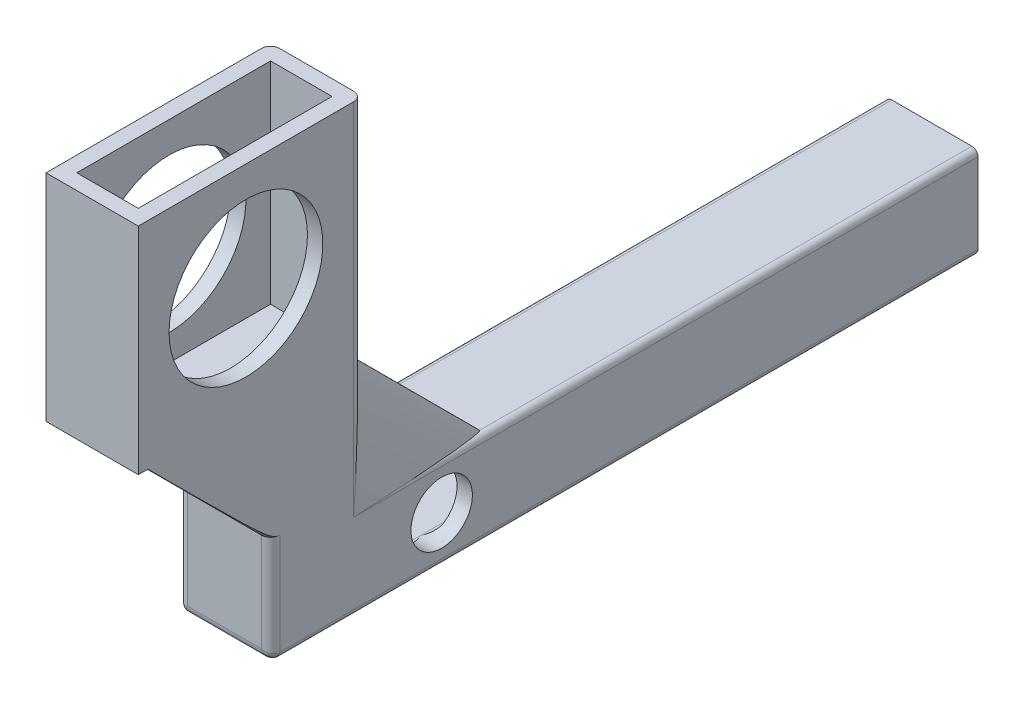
ISO-10303-21;
HEADER;
FILE_DESCRIPTION(('STEP AP214'),'2;1');
FILE_NAME('part.step','',(''),(''),'','','');
FILE_SCHEMA(('AUTOMOTIVE_DESIGN { 1 0 10303 214 1 1 1 1 }'));
ENDSEC;
DATA;
#1=APPLICATION_CONTEXT('core data for automotive mechanical design processes');
#2=APPLICATION_PROTOCOL_DEFINITION('international standard','automotive_design',2000,#1);
#3=PRODUCT_CONTEXT('',#1,'mechanical');
#4=PRODUCT('Part','Part','',(#3));
#5=PRODUCT_RELATED_PRODUCT_CATEGORY('part','',(#4));
#6=PRODUCT_DEFINITION_FORMATION('','',#4);
#7=PRODUCT_DEFINITION_CONTEXT('part definition',#1,'design');
#8=PRODUCT_DEFINITION('design','',#6,#7);
#9=PRODUCT_DEFINITION_SHAPE('','',#8);
#10=(LENGTH_UNIT() NAMED_UNIT(*) SI_UNIT(.MILLI.,.METRE.));
#11=(NAMED_UNIT(*) PLANE_ANGLE_UNIT() SI_UNIT($,.RADIAN.));
#12=(NAMED_UNIT(*) SI_UNIT($,.STERADIAN.) SOLID_ANGLE_UNIT());
#13=UNCERTAINTY_MEASURE_WITH_UNIT(LENGTH_MEASURE(1.E-05),#10,'distance_accuracy_value','');
#14=(GEOMETRIC_REPRESENTATION_CONTEXT(3) GLOBAL_UNCERTAINTY_ASSIGNED_CONTEXT((#13)) GLOBAL_UNIT_ASSIGNED_CONTEXT((#10,
#11,#12)) REPRESENTATION_CONTEXT('',''));
#15=CARTESIAN_POINT('',(0.,0.,0.));
#16=DIRECTION('',(0.,0.,1.));
#17=DIRECTION('',(1.,0.,0.));
#18=AXIS2_PLACEMENT_3D('',#15,#16,#17);
#19=CARTESIAN_POINT('',(15.,95.,238.));
#20=DIRECTION('',(-1.,0.,0.));
#21=DIRECTION('',(0.,0.,1.));
#22=AXIS2_PLACEMENT_3D('',#19,#20,#21);
#23=CYLINDRICAL_SURFACE('',#22,25.);
#24=CARTESIAN_POINT('',(10.,95.,238.));
#25=DIRECTION('',(1.,0.,0.));
#26=DIRECTION('',(0.,0.,-1.));
#27=AXIS2_PLACEMENT_3D('',#24,#25,#26);
#28=CIRCLE('',#27,25.);
#29=CARTESIAN_POINT('',(10.,95.,213.));
#30=VERTEX_POINT('',#29);
#31=EDGE_CURVE('E46',#30,#30,#28,.F.);
#32=ORIENTED_EDGE('',*,*,#31,.T.);
#33=EDGE_LOOP('',(#32));
#34=FACE_BOUND('',#33,.T.);
#35=CARTESIAN_POINT('',(15.,95.,238.));
#36=DIRECTION('',(-1.,0.,0.));
#37=DIRECTION('',(0.,0.,1.));
#38=AXIS2_PLACEMENT_3D('',#35,#36,#37);
#39=CIRCLE('',#38,25.);
#40=CARTESIAN_POINT('',(15.,95.,263.));
#41=VERTEX_POINT('',#40);
#42=EDGE_CURVE('E378',#41,#41,#39,.T.);
#43=ORIENTED_EDGE('',*,*,#42,.F.);
#44=EDGE_LOOP('',(#43));
#45=FACE_BOUND('',#44,.T.);
#46=ADVANCED_FACE('F39',(#34,#45),#23,.F.);
#47=CARTESIAN_POINT('',(-8.,-8.,200.));
#48=DIRECTION('',(0.,0.,-1.));
#49=DIRECTION('',(-1.,0.,0.));
#50=AXIS2_PLACEMENT_3D('',#47,#48,#49);
#51=CYLINDRICAL_SURFACE('',#50,2.);
#52=CARTESIAN_POINT('',(-10.,-7.99999999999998,180.369481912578));
#53=CARTESIAN_POINT('',(-9.99999547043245,-8.04728628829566,180.306435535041));
#54=CARTESIAN_POINT('',(-9.99832361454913,-8.0938134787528,180.242844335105));
#55=CARTESIAN_POINT('',(-9.9919285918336,-8.18526953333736,180.114701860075));
#56=CARTESIAN_POINT('',(-9.98720638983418,-8.23019889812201,180.050150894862));
#57=CARTESIAN_POINT('',(-9.96891171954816,-8.36233782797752,179.855452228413));
#58=CARTESIAN_POINT('',(-9.95120888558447,-8.4470878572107,179.72400572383));
#59=CARTESIAN_POINT('',(-9.90682523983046,-8.60911903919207,179.459373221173));
#60=CARTESIAN_POINT('',(-9.88020606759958,-8.68644690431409,179.326205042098));
#61=CARTESIAN_POINT('',(-9.8194524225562,-8.83425262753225,179.057710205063));
#62=CARTESIAN_POINT('',(-9.78531301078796,-8.9047259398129,178.922382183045));
#63=CARTESIAN_POINT('',(-9.68706305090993,-9.08147710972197,178.563342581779));
#64=CARTESIAN_POINT('',(-9.61770825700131,-9.18198793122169,178.338209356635));
#65=CARTESIAN_POINT('',(-9.46662002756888,-9.36495514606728,177.884797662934));
#66=CARTESIAN_POINT('',(-9.38488135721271,-9.44740386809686,177.656517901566));
#67=CARTESIAN_POINT('',(-9.21197945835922,-9.59501524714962,177.196877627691));
#68=CARTESIAN_POINT('',(-9.12078074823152,-9.6601092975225,176.965508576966));
#69=CARTESIAN_POINT('',(-8.93190515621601,-9.77303511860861,176.501340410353));
#70=CARTESIAN_POINT('',(-8.83423036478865,-9.82087242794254,176.268541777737));
#71=CARTESIAN_POINT('',(-8.61715554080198,-9.90657044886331,175.761273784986));
#72=CARTESIAN_POINT('',(-8.49693692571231,-9.94123736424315,175.486616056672));
#73=CARTESIAN_POINT('',(-8.25385716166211,-9.98766939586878,174.937184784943));
#74=CARTESIAN_POINT('',(-8.13100202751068,-9.99948198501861,174.662412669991));
#75=CARTESIAN_POINT('',(-8.00544328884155,-9.99999444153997,174.381653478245));
#76=CARTESIAN_POINT('',(-8.00272163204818,-9.9999999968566,174.375567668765));
#77=CARTESIAN_POINT('',(-8.,-10.,174.369481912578));
#78=B_SPLINE_CURVE_WITH_KNOTS('',3,(#52,#53,#54,#55,#56,#57,#58,#59,#60,#61,#62,#63,#64,#65,#66,
#67,#68,#69,#70,#71,#72,#73,#74,#75,#76,#77),.UNSPECIFIED.,.F.,.F.,(4,2,2,2,2,2,2,2,2,2,2,2,4),
(0.,0.236371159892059,0.472667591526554,0.944315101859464,1.41276713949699,1.88152775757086,
2.64870335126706,3.41620414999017,4.18669550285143,4.95693934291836,5.86148159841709,
6.7641429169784,6.78414292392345),.UNSPECIFIED.);
#79=CARTESIAN_POINT('',(-10.,-7.99999999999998,180.369481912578));
#80=VERTEX_POINT('',#79);
#81=CARTESIAN_POINT('',(-8.,-10.,174.369481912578));
#82=VERTEX_POINT('',#81);
#83=EDGE_CURVE('E470',#80,#82,#78,.T.);
#84=ORIENTED_EDGE('',*,*,#83,.F.);
#85=DIRECTION('',(0.,0.,-1.));
#86=VECTOR('',#85,1.);
#87=CARTESIAN_POINT('',(-10.,-7.99999999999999,200.));
#88=LINE('',#87,#86);
#89=CARTESIAN_POINT('',(-10.,-7.99999999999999,200.));
#90=VERTEX_POINT('',#89);
#91=EDGE_CURVE('E978',#90,#80,#88,.T.);
#92=ORIENTED_EDGE('',*,*,#91,.F.);
#93=CARTESIAN_POINT('',(-8.,-8.,200.));
#94=DIRECTION('',(0.,0.,1.));
#95=DIRECTION('',(-1.,0.,0.));
#96=AXIS2_PLACEMENT_3D('',#93,#94,#95);
#97=CIRCLE('',#96,2.);
#98=CARTESIAN_POINT('',(-7.99999999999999,-10.,200.));
#99=VERTEX_POINT('',#98);
#100=EDGE_CURVE('E907',#90,#99,#97,.T.);
#101=ORIENTED_EDGE('',*,*,#100,.T.);
#102=DIRECTION('',(0.,0.,-1.));
#103=VECTOR('',#102,1.);
#104=CARTESIAN_POINT('',(-7.99999999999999,-10.,200.));
#105=LINE('',#104,#103);
#106=EDGE_CURVE('E929',#99,#82,#105,.T.);
#107=ORIENTED_EDGE('',*,*,#106,.T.);
#108=EDGE_LOOP('',(#84,#92,#101,#107));
#109=FACE_BOUND('',#108,.T.);
#110=ADVANCED_FACE('F520',(#109),#51,.F.);
#111=CARTESIAN_POINT('',(8.,-8.,200.));
#112=DIRECTION('',(0.,0.,-1.));
#113=DIRECTION('',(-1.,0.,0.));
#114=AXIS2_PLACEMENT_3D('',#111,#112,#113);
#115=CYLINDRICAL_SURFACE('',#114,2.);
#116=CARTESIAN_POINT('',(10.,-7.99999999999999,168.369481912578));
#117=CARTESIAN_POINT('',(9.99999547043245,-8.04728628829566,168.432528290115));
#118=CARTESIAN_POINT('',(9.99832361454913,-8.09381347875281,168.496119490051));
#119=CARTESIAN_POINT('',(9.9919285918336,-8.18526953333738,168.624261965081));
#120=CARTESIAN_POINT('',(9.98720638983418,-8.23019889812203,168.688812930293));
#121=CARTESIAN_POINT('',(9.96891171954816,-8.36233782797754,168.883511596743));
#122=CARTESIAN_POINT('',(9.95120888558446,-8.44708785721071,169.014958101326));
#123=CARTESIAN_POINT('',(9.90682523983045,-8.60911903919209,169.279590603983));
#124=CARTESIAN_POINT('',(9.88020606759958,-8.68644690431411,169.412758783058));
#125=CARTESIAN_POINT('',(9.81945242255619,-8.83425262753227,169.681253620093));
#126=CARTESIAN_POINT('',(9.78531301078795,-8.90472593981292,169.816581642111));
#127=CARTESIAN_POINT('',(9.68706305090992,-9.08147710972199,170.175621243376));
#128=CARTESIAN_POINT('',(9.6177082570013,-9.18198793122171,170.400754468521));
#129=CARTESIAN_POINT('',(9.46662002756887,-9.3649551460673,170.854166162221));
#130=CARTESIAN_POINT('',(9.38488135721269,-9.44740386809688,171.08244592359));
#131=CARTESIAN_POINT('',(9.2119794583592,-9.59501524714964,171.542086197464));
#132=CARTESIAN_POINT('',(9.1207807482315,-9.66010929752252,171.77345524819));
#133=CARTESIAN_POINT('',(8.93190515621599,-9.77303511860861,172.237623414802));
#134=CARTESIAN_POINT('',(8.83423036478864,-9.82087242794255,172.470422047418));
#135=CARTESIAN_POINT('',(8.61715554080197,-9.90657044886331,172.97769004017));
#136=CARTESIAN_POINT('',(8.4969369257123,-9.94123736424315,173.252347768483));
#137=CARTESIAN_POINT('',(8.25385716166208,-9.98766939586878,173.801779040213));
#138=CARTESIAN_POINT('',(8.13100202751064,-9.99948198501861,174.076551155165));
#139=CARTESIAN_POINT('',(8.00544328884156,-9.99999444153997,174.35731034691));
#140=CARTESIAN_POINT('',(8.00272163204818,-9.9999999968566,174.36339615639));
#141=CARTESIAN_POINT('',(8.,-10.,174.369481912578));
#142=B_SPLINE_CURVE_WITH_KNOTS('',3,(#116,#117,#118,#119,#120,#121,#122,#123,#124,#125,#126,
#127,#128,#129,#130,#131,#132,#133,#134,#135,#136,#137,#138,#139,#140,#141),.UNSPECIFIED.,.F.,
.F.,(4,2,2,2,2,2,2,2,2,2,2,2,4),(0.,0.236371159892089,0.472667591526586,0.94431510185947,
1.41276713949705,1.88152775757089,2.64870335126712,3.41620414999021,4.18669550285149,
4.95693934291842,5.86148159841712,6.76414291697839,6.78414292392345),.UNSPECIFIED.);
#143=CARTESIAN_POINT('',(10.,-7.99999999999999,168.369481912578));
#144=VERTEX_POINT('',#143);
#145=CARTESIAN_POINT('',(8.,-10.,174.369481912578));
#146=VERTEX_POINT('',#145);
#147=EDGE_CURVE('E456',#144,#146,#142,.T.);
#148=ORIENTED_EDGE('',*,*,#147,.F.);
#149=DIRECTION('',(0.,0.,-1.));
#150=VECTOR('',#149,1.);
#151=CARTESIAN_POINT('',(10.,-7.99999999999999,200.));
#152=LINE('',#151,#150);
#153=CARTESIAN_POINT('',(10.,-7.99999999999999,0.));
#154=VERTEX_POINT('',#153);
#155=EDGE_CURVE('E955',#144,#154,#152,.T.);
#156=ORIENTED_EDGE('',*,*,#155,.T.);
#157=CARTESIAN_POINT('',(8.,-8.,0.));
#158=DIRECTION('',(0.,0.,1.));
#159=DIRECTION('',(-1.,0.,0.));
#160=AXIS2_PLACEMENT_3D('',#157,#158,#159);
#161=CIRCLE('',#160,2.);
#162=CARTESIAN_POINT('',(7.99999999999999,-10.,0.));
#163=VERTEX_POINT('',#162);
#164=EDGE_CURVE('E953',#163,#154,#161,.T.);
#165=ORIENTED_EDGE('',*,*,#164,.F.);
#166=DIRECTION('',(0.,0.,-1.));
#167=VECTOR('',#166,1.);
#168=CARTESIAN_POINT('',(7.99999999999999,-10.,200.));
#169=LINE('',#168,#167);
#170=EDGE_CURVE('E891',#146,#163,#169,.T.);
#171=ORIENTED_EDGE('',*,*,#170,.F.);
#172=EDGE_LOOP('',(#148,#156,#165,#171));
#173=FACE_BOUND('',#172,.T.);
#174=ADVANCED_FACE('F508',(#173),#115,.F.);
#175=CARTESIAN_POINT('',(10.,7.99999999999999,200.));
#176=DIRECTION('',(-1.,0.,0.));
#177=DIRECTION('',(0.,0.,1.));
#178=AXIS2_PLACEMENT_3D('',#175,#176,#177);
#179=PLANE('',#178);
#180=CARTESIAN_POINT('',(10.,0.,174.369481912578));
#181=DIRECTION('',(-1.,0.,0.));
#182=DIRECTION('',(0.,0.,1.));
#183=AXIS2_PLACEMENT_3D('',#180,#181,#182);
#184=CIRCLE('',#183,10.);
#185=CARTESIAN_POINT('',(10.,7.99999999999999,168.369481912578));
#186=VERTEX_POINT('',#185);
#187=EDGE_CURVE('E1082',#186,#144,#184,.T.);
#188=ORIENTED_EDGE('',*,*,#187,.F.);
#189=DIRECTION('',(0.,0.,-1.));
#190=VECTOR('',#189,1.);
#191=CARTESIAN_POINT('',(10.,7.99999999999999,200.));
#192=LINE('',#191,#190);
#193=CARTESIAN_POINT('',(10.,7.99999999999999,0.));
#194=VERTEX_POINT('',#193);
#195=EDGE_CURVE('E994',#186,#194,#192,.T.);
#196=ORIENTED_EDGE('',*,*,#195,.T.);
#197=DIRECTION('',(0.,1.,0.));
#198=VECTOR('',#197,1.);
#199=CARTESIAN_POINT('',(10.,7.99999999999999,0.));
#200=LINE('',#199,#198);
#201=EDGE_CURVE('E959',#154,#194,#200,.T.);
#202=ORIENTED_EDGE('',*,*,#201,.F.);
#203=ORIENTED_EDGE('',*,*,#155,.F.);
#204=EDGE_LOOP('',(#188,#196,#202,#203));
#205=FACE_BOUND('',#204,.T.);
#206=ADVANCED_FACE('F502',(#205),#179,.T.);
#207=CARTESIAN_POINT('',(8.,8.,200.));
#208=DIRECTION('',(0.,0.,-1.));
#209=DIRECTION('',(-1.,0.,0.));
#210=AXIS2_PLACEMENT_3D('',#207,#208,#209);
#211=CYLINDRICAL_SURFACE('',#210,2.);
#212=CARTESIAN_POINT('',(10.,7.99999999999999,180.369481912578));
#213=CARTESIAN_POINT('',(9.99999547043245,8.0472862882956,180.306435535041));
#214=CARTESIAN_POINT('',(9.99832361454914,8.09381347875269,180.242844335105));
#215=CARTESIAN_POINT('',(9.99192859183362,8.18526953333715,180.114701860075));
#216=CARTESIAN_POINT('',(9.98720638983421,8.23019889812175,180.050150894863));
#217=CARTESIAN_POINT('',(9.96891171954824,8.3623378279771,179.855452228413));
#218=CARTESIAN_POINT('',(9.95120888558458,8.44708785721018,179.724005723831));
#219=CARTESIAN_POINT('',(9.90682523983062,8.60911903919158,179.459373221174));
#220=CARTESIAN_POINT('',(9.88020606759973,8.6864469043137,179.326205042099));
#221=CARTESIAN_POINT('',(9.81945242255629,8.83425262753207,179.057710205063));
#222=CARTESIAN_POINT('',(9.785313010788,8.90472593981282,178.922382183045));
#223=CARTESIAN_POINT('',(9.68706305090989,9.08147710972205,178.563342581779));
#224=CARTESIAN_POINT('',(9.61770825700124,9.18198793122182,178.338209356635));
#225=CARTESIAN_POINT('',(9.46662002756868,9.36495514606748,177.884797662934));
#226=CARTESIAN_POINT('',(9.38488135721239,9.44740386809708,177.656517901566));
#227=CARTESIAN_POINT('',(9.21197945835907,9.59501524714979,177.196877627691));
#228=CARTESIAN_POINT('',(9.12078074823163,9.66010929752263,176.965508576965));
#229=CARTESIAN_POINT('',(8.93190515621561,9.77303511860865,176.501340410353));
#230=CARTESIAN_POINT('',(8.83423036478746,9.82087242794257,176.268541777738));
#231=CARTESIAN_POINT('',(8.61715554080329,9.90657044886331,175.761273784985));
#232=CARTESIAN_POINT('',(8.49693692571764,9.94123736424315,175.48661605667));
#233=CARTESIAN_POINT('',(8.25385716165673,9.98766939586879,174.937184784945));
#234=CARTESIAN_POINT('',(8.1310020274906,9.99948198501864,174.66241267));
#235=CARTESIAN_POINT('',(8.00544328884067,9.99999444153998,174.381653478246));
#236=CARTESIAN_POINT('',(8.00272163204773,9.99999999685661,174.375567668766));
#237=CARTESIAN_POINT('',(8.,10.,174.369481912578));
#238=B_SPLINE_CURVE_WITH_KNOTS('',3,(#212,#213,#214,#215,#216,#217,#218,#219,#220,#221,#222,
#223,#224,#225,#226,#227,#228,#229,#230,#231,#232,#233,#234,#235,#236,#237),.UNSPECIFIED.,.F.,
.F.,(4,2,2,2,2,2,2,2,2,2,2,2,4),(0.,0.236371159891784,0.472667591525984,0.944315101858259,
1.41276713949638,1.88152775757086,2.64870335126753,3.41620414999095,4.18669550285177,
4.95693934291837,5.86148159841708,6.76414291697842,6.78414292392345),.UNSPECIFIED.);
#239=CARTESIAN_POINT('',(10.,7.99999999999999,180.369481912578));
#240=VERTEX_POINT('',#239);
#241=CARTESIAN_POINT('',(7.99999999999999,10.,174.369481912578));
#242=VERTEX_POINT('',#241);
#243=EDGE_CURVE('E480',#240,#242,#238,.T.);
#244=ORIENTED_EDGE('',*,*,#243,.F.);
#245=CARTESIAN_POINT('',(10.,8.,200.));
#246=VERTEX_POINT('',#245);
#247=EDGE_CURVE('E995',#246,#240,#192,.T.);
#248=ORIENTED_EDGE('',*,*,#247,.F.);
#249=CARTESIAN_POINT('',(8.,8.,200.));
#250=DIRECTION('',(0.,0.,1.));
#251=DIRECTION('',(-1.,0.,0.));
#252=AXIS2_PLACEMENT_3D('',#249,#250,#251);
#253=CIRCLE('',#252,2.);
#254=CARTESIAN_POINT('',(7.99999999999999,10.,200.));
#255=VERTEX_POINT('',#254);
#256=EDGE_CURVE('E913',#246,#255,#253,.T.);
#257=ORIENTED_EDGE('',*,*,#256,.T.);
#258=DIRECTION('',(0.,0.,-1.));
#259=VECTOR('',#258,1.);
#260=CARTESIAN_POINT('',(7.99999999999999,10.,200.));
#261=LINE('',#260,#259);
#262=EDGE_CURVE('E991',#255,#242,#261,.T.);
#263=ORIENTED_EDGE('',*,*,#262,.T.);
#264=EDGE_LOOP('',(#244,#248,#257,#263));
#265=FACE_BOUND('',#264,.T.);
#266=ADVANCED_FACE('F497',(#265),#211,.F.);
#267=CARTESIAN_POINT('',(-8.,8.,200.));
#268=DIRECTION('',(0.,0.,-1.));
#269=DIRECTION('',(-1.,0.,0.));
#270=AXIS2_PLACEMENT_3D('',#267,#268,#269);
#271=CYLINDRICAL_SURFACE('',#270,2.);
#272=CARTESIAN_POINT('',(-10.,7.99999999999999,168.369481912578));
#273=CARTESIAN_POINT('',(-9.99999547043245,8.0472862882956,168.432528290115));
#274=CARTESIAN_POINT('',(-9.99832361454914,8.09381347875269,168.49611949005));
#275=CARTESIAN_POINT('',(-9.99192859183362,8.18526953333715,168.624261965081));
#276=CARTESIAN_POINT('',(-9.98720638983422,8.23019889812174,168.688812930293));
#277=CARTESIAN_POINT('',(-9.96891171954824,8.36233782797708,168.883511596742));
#278=CARTESIAN_POINT('',(-9.95120888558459,8.44708785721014,169.014958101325));
#279=CARTESIAN_POINT('',(-9.90682523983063,8.60911903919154,169.279590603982));
#280=CARTESIAN_POINT('',(-9.88020606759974,8.68644690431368,169.412758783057));
#281=CARTESIAN_POINT('',(-9.81945242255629,8.83425262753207,169.681253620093));
#282=CARTESIAN_POINT('',(-9.785313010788,8.90472593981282,169.816581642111));
#283=CARTESIAN_POINT('',(-9.68706305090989,9.08147710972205,170.175621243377));
#284=CARTESIAN_POINT('',(-9.61770825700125,9.18198793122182,170.400754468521));
#285=CARTESIAN_POINT('',(-9.46662002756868,9.36495514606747,170.854166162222));
#286=CARTESIAN_POINT('',(-9.38488135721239,9.44740386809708,171.08244592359));
#287=CARTESIAN_POINT('',(-9.21197945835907,9.5950152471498,171.542086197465));
#288=CARTESIAN_POINT('',(-9.12078074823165,9.66010929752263,171.773455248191));
#289=CARTESIAN_POINT('',(-8.93190515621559,9.77303511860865,172.237623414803));
#290=CARTESIAN_POINT('',(-8.83423036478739,9.82087242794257,172.470422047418));
#291=CARTESIAN_POINT('',(-8.61715554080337,9.90657044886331,172.977690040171));
#292=CARTESIAN_POINT('',(-8.49693692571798,9.94123736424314,173.252347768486));
#293=CARTESIAN_POINT('',(-8.25385716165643,9.98766939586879,173.80177904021));
#294=CARTESIAN_POINT('',(-8.13100202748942,9.99948198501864,174.076551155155));
#295=CARTESIAN_POINT('',(-8.00544328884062,9.99999444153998,174.35731034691));
#296=CARTESIAN_POINT('',(-8.0027216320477,9.99999999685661,174.36339615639));
#297=CARTESIAN_POINT('',(-8.,10.,174.369481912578));
#298=B_SPLINE_CURVE_WITH_KNOTS('',3,(#272,#273,#274,#275,#276,#277,#278,#279,#280,#281,#282,
#283,#284,#285,#286,#287,#288,#289,#290,#291,#292,#293,#294,#295,#296,#297),.UNSPECIFIED.,.F.,
.F.,(4,2,2,2,2,2,2,2,2,2,2,2,4),(0.,0.236371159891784,0.472667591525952,0.944315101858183,
1.41276713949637,1.88152775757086,2.64870335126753,3.41620414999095,4.1866955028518,
4.95693934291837,5.86148159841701,6.7641429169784,6.78414292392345),.UNSPECIFIED.);
#299=CARTESIAN_POINT('',(-10.,7.99999999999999,168.369481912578));
#300=VERTEX_POINT('',#299);
#301=CARTESIAN_POINT('',(-8.,10.,174.369481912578));
#302=VERTEX_POINT('',#301);
#303=EDGE_CURVE('E420',#300,#302,#298,.T.);
#304=ORIENTED_EDGE('',*,*,#303,.F.);
#305=DIRECTION('',(0.,0.,-1.));
#306=VECTOR('',#305,1.);
#307=CARTESIAN_POINT('',(-10.,7.99999999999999,200.));
#308=LINE('',#307,#306);
#309=CARTESIAN_POINT('',(-10.,7.99999999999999,0.));
#310=VERTEX_POINT('',#309);
#311=EDGE_CURVE('E981',#300,#310,#308,.T.);
#312=ORIENTED_EDGE('',*,*,#311,.T.);
#313=CARTESIAN_POINT('',(-8.,8.,0.));
#314=DIRECTION('',(0.,0.,1.));
#315=DIRECTION('',(1.,0.,0.));
#316=AXIS2_PLACEMENT_3D('',#313,#314,#315);
#317=CIRCLE('',#316,2.);
#318=CARTESIAN_POINT('',(-7.99999999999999,10.,0.));
#319=VERTEX_POINT('',#318);
#320=EDGE_CURVE('E922',#319,#310,#317,.T.);
#321=ORIENTED_EDGE('',*,*,#320,.F.);
#322=DIRECTION('',(0.,0.,-1.));
#323=VECTOR('',#322,1.);
#324=CARTESIAN_POINT('',(-7.99999999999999,10.,200.));
#325=LINE('',#324,#323);
#326=EDGE_CURVE('E986',#302,#319,#325,.T.);
#327=ORIENTED_EDGE('',*,*,#326,.F.);
#328=EDGE_LOOP('',(#304,#312,#321,#327));
#329=FACE_BOUND('',#328,.T.);
#330=ADVANCED_FACE('F1076',(#329),#271,.F.);
#331=CARTESIAN_POINT('',(-10.,7.99999999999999,200.));
#332=DIRECTION('',(1.,0.,0.));
#333=DIRECTION('',(0.,0.,-1.));
#334=AXIS2_PLACEMENT_3D('',#331,#332,#333);
#335=PLANE('',#334);
#336=CARTESIAN_POINT('',(-10.,0.,174.369481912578));
#337=DIRECTION('',(1.,0.,0.));
#338=DIRECTION('',(0.,0.,-1.));
#339=AXIS2_PLACEMENT_3D('',#336,#337,#338);
#340=CIRCLE('',#339,10.);
#341=CARTESIAN_POINT('',(-10.,7.99999999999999,180.369481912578));
#342=VERTEX_POINT('',#341);
#343=EDGE_CURVE('E890',#342,#80,#340,.T.);
#344=ORIENTED_EDGE('',*,*,#343,.F.);
#345=CARTESIAN_POINT('',(-10.,7.99999999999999,200.));
#346=VERTEX_POINT('',#345);
#347=EDGE_CURVE('E983',#346,#342,#308,.T.);
#348=ORIENTED_EDGE('',*,*,#347,.F.);
#349=DIRECTION('',(0.,-1.,0.));
#350=VECTOR('',#349,1.);
#351=CARTESIAN_POINT('',(-10.,7.99999999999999,200.));
#352=LINE('',#351,#350);
#353=EDGE_CURVE('E1061',#346,#90,#352,.T.);
#354=ORIENTED_EDGE('',*,*,#353,.T.);
#355=ORIENTED_EDGE('',*,*,#91,.T.);
#356=EDGE_LOOP('',(#344,#348,#354,#355));
#357=FACE_BOUND('',#356,.T.);
#358=ADVANCED_FACE('F1285',(#357),#335,.T.);
#359=CARTESIAN_POINT('',(0.,130.,0.));
#360=DIRECTION('',(0.,1.,0.));
#361=DIRECTION('',(0.,0.,1.));
#362=AXIS2_PLACEMENT_3D('',#359,#360,#361);
#363=PLANE('',#362);
#364=DIRECTION('',(0.,0.,-1.));
#365=VECTOR('',#364,1.);
#366=CARTESIAN_POINT('',(10.,130.,205.));
#367=LINE('',#366,#365);
#368=CARTESIAN_POINT('',(10.,130.,268.));
#369=VERTEX_POINT('',#368);
#370=CARTESIAN_POINT('',(10.,130.,205.));
#371=VERTEX_POINT('',#370);
#372=EDGE_CURVE('E60',#369,#371,#367,.T.);
#373=ORIENTED_EDGE('',*,*,#372,.F.);
#374=DIRECTION('',(1.,0.,0.));
#375=VECTOR('',#374,1.);
#376=CARTESIAN_POINT('',(10.,130.,268.));
#377=LINE('',#376,#375);
#378=CARTESIAN_POINT('',(-9.99999999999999,130.,268.));
#379=VERTEX_POINT('',#378);
#380=EDGE_CURVE('E346',#379,#369,#377,.T.);
#381=ORIENTED_EDGE('',*,*,#380,.F.);
#382=DIRECTION('',(0.,0.,1.));
#383=VECTOR('',#382,1.);
#384=CARTESIAN_POINT('',(-10.,130.,205.));
#385=LINE('',#384,#383);
#386=CARTESIAN_POINT('',(-10.,130.,205.));
#387=VERTEX_POINT('',#386);
#388=EDGE_CURVE('E367',#387,#379,#385,.T.);
#389=ORIENTED_EDGE('',*,*,#388,.F.);
#390=DIRECTION('',(-1.,0.,0.));
#391=VECTOR('',#390,1.);
#392=CARTESIAN_POINT('',(10.,130.,205.));
#393=LINE('',#392,#391);
#394=EDGE_CURVE('E365',#371,#387,#393,.T.);
#395=ORIENTED_EDGE('',*,*,#394,.F.);
#396=EDGE_LOOP('',(#373,#381,#389,#395));
#397=FACE_BOUND('',#396,.T.);
#398=CARTESIAN_POINT('',(-12.,130.,203.));
#399=DIRECTION('',(0.,1.,0.));
#400=DIRECTION('',(0.,0.,1.));
#401=AXIS2_PLACEMENT_3D('',#398,#399,#400);
#402=CIRCLE('',#401,3.);
#403=CARTESIAN_POINT('',(-12.,130.,200.));
#404=VERTEX_POINT('',#403);
#405=CARTESIAN_POINT('',(-15.,130.,203.));
#406=VERTEX_POINT('',#405);
#407=EDGE_CURVE('E558',#404,#406,#402,.T.);
#408=ORIENTED_EDGE('',*,*,#407,.T.);
#409=DIRECTION('',(0.,0.,1.));
#410=VECTOR('',#409,1.);
#411=CARTESIAN_POINT('',(-15.,130.,200.));
#412=LINE('',#411,#410);
#413=CARTESIAN_POINT('',(-15.,130.,273.));
#414=VERTEX_POINT('',#413);
#415=EDGE_CURVE('E1037',#406,#414,#412,.T.);
#416=ORIENTED_EDGE('',*,*,#415,.T.);
#417=DIRECTION('',(-1.,0.,0.));
#418=VECTOR('',#417,1.);
#419=CARTESIAN_POINT('',(15.,130.,273.));
#420=LINE('',#419,#418);
#421=CARTESIAN_POINT('',(15.,130.,273.));
#422=VERTEX_POINT('',#421);
#423=EDGE_CURVE('E396',#422,#414,#420,.T.);
#424=ORIENTED_EDGE('',*,*,#423,.F.);
#425=DIRECTION('',(0.,0.,-1.));
#426=VECTOR('',#425,1.);
#427=CARTESIAN_POINT('',(15.,130.,200.));
#428=LINE('',#427,#426);
#429=CARTESIAN_POINT('',(15.,130.,203.));
#430=VERTEX_POINT('',#429);
#431=EDGE_CURVE('E1033',#422,#430,#428,.T.);
#432=ORIENTED_EDGE('',*,*,#431,.T.);
#433=CARTESIAN_POINT('',(12.,130.,203.));
#434=DIRECTION('',(0.,1.,0.));
#435=DIRECTION('',(0.,0.,1.));
#436=AXIS2_PLACEMENT_3D('',#433,#434,#435);
#437=CIRCLE('',#436,3.);
#438=CARTESIAN_POINT('',(12.,130.,200.));
#439=VERTEX_POINT('',#438);
#440=EDGE_CURVE('E886',#430,#439,#437,.T.);
#441=ORIENTED_EDGE('',*,*,#440,.T.);
#442=DIRECTION('',(-1.,0.,0.));
#443=VECTOR('',#442,1.);
#444=CARTESIAN_POINT('',(-15.,130.,200.));
#445=LINE('',#444,#443);
#446=EDGE_CURVE('E965',#439,#404,#445,.T.);
#447=ORIENTED_EDGE('',*,*,#446,.T.);
#448=EDGE_LOOP('',(#408,#416,#424,#432,#441,#447));
#449=FACE_BOUND('',#448,.T.);
#450=ADVANCED_FACE('F513',(#397,#449),#363,.T.);
#451=CARTESIAN_POINT('',(7.99999999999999,-10.,200.));
#452=DIRECTION('',(0.,1.,0.));
#453=DIRECTION('',(0.,0.,1.));
#454=AXIS2_PLACEMENT_3D('',#451,#452,#453);
#455=PLANE('',#454);
#456=CARTESIAN_POINT('',(7.99999999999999,-10.,200.));
#457=VERTEX_POINT('',#456);
#458=EDGE_CURVE('E894',#457,#146,#169,.T.);
#459=ORIENTED_EDGE('',*,*,#458,.T.);
#460=ORIENTED_EDGE('',*,*,#170,.T.);
#461=DIRECTION('',(1.,0.,0.));
#462=VECTOR('',#461,1.);
#463=CARTESIAN_POINT('',(7.99999999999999,-10.,0.));
#464=LINE('',#463,#462);
#465=CARTESIAN_POINT('',(-7.99999999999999,-10.,0.));
#466=VERTEX_POINT('',#465);
#467=EDGE_CURVE('E960',#466,#163,#464,.T.);
#468=ORIENTED_EDGE('',*,*,#467,.F.);
#469=EDGE_CURVE('E896',#82,#466,#105,.T.);
#470=ORIENTED_EDGE('',*,*,#469,.F.);
#471=ORIENTED_EDGE('',*,*,#106,.F.);
#472=DIRECTION('',(-1.,0.,0.));
#473=VECTOR('',#472,1.);
#474=CARTESIAN_POINT('',(-15.,-10.,200.));
#475=LINE('',#474,#473);
#476=EDGE_CURVE('E945',#457,#99,#475,.T.);
#477=ORIENTED_EDGE('',*,*,#476,.F.);
#478=EDGE_LOOP('',(#459,#460,#468,#470,#471,#477));
#479=FACE_BOUND('',#478,.T.);
#480=ADVANCED_FACE('F509',(#479),#455,.T.);
#481=CARTESIAN_POINT('',(-13.,13.,0.));
#482=DIRECTION('',(0.,0.,1.));
#483=DIRECTION('',(1.,0.,0.));
#484=AXIS2_PLACEMENT_3D('',#481,#482,#483);
#485=PLANE('',#484);
#486=CARTESIAN_POINT('',(-13.,13.,0.));
#487=DIRECTION('',(0.,0.,1.));
#488=DIRECTION('',(1.,0.,0.));
#489=AXIS2_PLACEMENT_3D('',#486,#487,#488);
#490=CIRCLE('',#489,2.);
#491=CARTESIAN_POINT('',(-13.,15.,0.));
#492=VERTEX_POINT('',#491);
#493=CARTESIAN_POINT('',(-15.,13.,0.));
#494=VERTEX_POINT('',#493);
#495=EDGE_CURVE('E930',#492,#494,#490,.T.);
#496=ORIENTED_EDGE('',*,*,#495,.F.);
#497=DIRECTION('',(-1.,0.,0.));
#498=VECTOR('',#497,1.);
#499=CARTESIAN_POINT('',(13.,15.,0.));
#500=LINE('',#499,#498);
#501=CARTESIAN_POINT('',(13.,15.,0.));
#502=VERTEX_POINT('',#501);
#503=EDGE_CURVE('E1014',#502,#492,#500,.T.);
#504=ORIENTED_EDGE('',*,*,#503,.F.);
#505=CARTESIAN_POINT('',(13.,13.,0.));
#506=DIRECTION('',(0.,0.,1.));
#507=DIRECTION('',(1.,0.,0.));
#508=AXIS2_PLACEMENT_3D('',#505,#506,#507);
#509=CIRCLE('',#508,2.);
#510=CARTESIAN_POINT('',(15.,13.,0.));
#511=VERTEX_POINT('',#510);
#512=EDGE_CURVE('E1011',#511,#502,#509,.T.);
#513=ORIENTED_EDGE('',*,*,#512,.F.);
#514=DIRECTION('',(0.,1.,0.));
#515=VECTOR('',#514,1.);
#516=CARTESIAN_POINT('',(15.,-13.,0.));
#517=LINE('',#516,#515);
#518=CARTESIAN_POINT('',(15.,-13.,0.));
#519=VERTEX_POINT('',#518);
#520=EDGE_CURVE('E1009',#519,#511,#517,.T.);
#521=ORIENTED_EDGE('',*,*,#520,.F.);
#522=CARTESIAN_POINT('',(13.,-13.,0.));
#523=DIRECTION('',(0.,0.,1.));
#524=DIRECTION('',(1.,0.,0.));
#525=AXIS2_PLACEMENT_3D('',#522,#523,#524);
#526=CIRCLE('',#525,2.);
#527=CARTESIAN_POINT('',(13.,-15.,0.));
#528=VERTEX_POINT('',#527);
#529=EDGE_CURVE('E1006',#528,#519,#526,.T.);
#530=ORIENTED_EDGE('',*,*,#529,.F.);
#531=DIRECTION('',(1.,0.,0.));
#532=VECTOR('',#531,1.);
#533=CARTESIAN_POINT('',(13.,-15.,0.));
#534=LINE('',#533,#532);
#535=CARTESIAN_POINT('',(-13.,-15.,0.));
#536=VERTEX_POINT('',#535);
#537=EDGE_CURVE('E1003',#536,#528,#534,.T.);
#538=ORIENTED_EDGE('',*,*,#537,.F.);
#539=CARTESIAN_POINT('',(-13.,-13.,0.));
#540=DIRECTION('',(0.,0.,1.));
#541=DIRECTION('',(-1.,0.,0.));
#542=AXIS2_PLACEMENT_3D('',#539,#540,#541);
#543=CIRCLE('',#542,2.);
#544=CARTESIAN_POINT('',(-15.,-13.,0.));
#545=VERTEX_POINT('',#544);
#546=EDGE_CURVE('E1000',#545,#536,#543,.T.);
#547=ORIENTED_EDGE('',*,*,#546,.F.);
#548=DIRECTION('',(0.,-1.,0.));
#549=VECTOR('',#548,1.);
#550=CARTESIAN_POINT('',(-15.,-13.,0.));
#551=LINE('',#550,#549);
#552=EDGE_CURVE('E935',#494,#545,#551,.T.);
#553=ORIENTED_EDGE('',*,*,#552,.F.);
#554=EDGE_LOOP('',(#496,#504,#513,#521,#530,#538,#547,#553));
#555=FACE_BOUND('',#554,.T.);
#556=CARTESIAN_POINT('',(-8.,-8.,0.));
#557=DIRECTION('',(0.,0.,1.));
#558=DIRECTION('',(-1.,0.,0.));
#559=AXIS2_PLACEMENT_3D('',#556,#557,#558);
#560=CIRCLE('',#559,2.);
#561=CARTESIAN_POINT('',(-10.,-7.99999999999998,0.));
#562=VERTEX_POINT('',#561);
#563=EDGE_CURVE('E963',#562,#466,#560,.T.);
#564=ORIENTED_EDGE('',*,*,#563,.T.);
#565=ORIENTED_EDGE('',*,*,#467,.T.);
#566=ORIENTED_EDGE('',*,*,#164,.T.);
#567=ORIENTED_EDGE('',*,*,#201,.T.);
#568=CARTESIAN_POINT('',(8.,8.,0.));
#569=DIRECTION('',(0.,0.,1.));
#570=DIRECTION('',(-1.,0.,0.));
#571=AXIS2_PLACEMENT_3D('',#568,#569,#570);
#572=CIRCLE('',#571,2.);
#573=CARTESIAN_POINT('',(7.99999999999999,10.,0.));
#574=VERTEX_POINT('',#573);
#575=EDGE_CURVE('E970',#194,#574,#572,.T.);
#576=ORIENTED_EDGE('',*,*,#575,.T.);
#577=DIRECTION('',(-1.,0.,0.));
#578=VECTOR('',#577,1.);
#579=CARTESIAN_POINT('',(7.99999999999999,10.,0.));
#580=LINE('',#579,#578);
#581=EDGE_CURVE('E973',#574,#319,#580,.T.);
#582=ORIENTED_EDGE('',*,*,#581,.T.);
#583=ORIENTED_EDGE('',*,*,#320,.T.);
#584=DIRECTION('',(0.,-1.,0.));
#585=VECTOR('',#584,1.);
#586=CARTESIAN_POINT('',(-10.,7.99999999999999,0.));
#587=LINE('',#586,#585);
#588=EDGE_CURVE('E916',#310,#562,#587,.T.);
#589=ORIENTED_EDGE('',*,*,#588,.T.);
#590=EDGE_LOOP('',(#564,#565,#566,#567,#576,#582,#583,#589));
#591=FACE_BOUND('',#590,.T.);
#592=ADVANCED_FACE('F512',(#555,#591),#485,.F.);
#593=CARTESIAN_POINT('',(-13.,13.,200.));
#594=DIRECTION('',(0.,0.,-1.));
#595=DIRECTION('',(-1.,0.,0.));
#596=AXIS2_PLACEMENT_3D('',#593,#594,#595);
#597=CYLINDRICAL_SURFACE('',#596,2.);
#598=DIRECTION('',(0.,0.,-1.));
#599=VECTOR('',#598,1.);
#600=CARTESIAN_POINT('',(-15.,13.,200.));
#601=LINE('',#600,#599);
#602=CARTESIAN_POINT('',(-15.,13.,203.));
#603=VERTEX_POINT('',#602);
#604=EDGE_CURVE('E639',#603,#494,#601,.T.);
#605=ORIENTED_EDGE('',*,*,#604,.F.);
#606=CARTESIAN_POINT('',(-13.,15.,160.011629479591));
#607=CARTESIAN_POINT('',(-13.1621929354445,14.9999348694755,160.092143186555));
#608=CARTESIAN_POINT('',(-13.3183190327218,14.9806942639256,160.563694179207));
#609=CARTESIAN_POINT('',(-13.5466243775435,14.9254493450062,161.817352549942));
#610=CARTESIAN_POINT('',(-13.6206469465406,14.9027599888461,162.32319495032));
#611=CARTESIAN_POINT('',(-13.7618021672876,14.8507496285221,163.470506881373));
#612=CARTESIAN_POINT('',(-13.8297068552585,14.8212204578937,164.116651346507));
#613=CARTESIAN_POINT('',(-13.9599237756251,14.7561000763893,165.533849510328));
#614=CARTESIAN_POINT('',(-14.0227964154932,14.7201264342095,166.313144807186));
#615=CARTESIAN_POINT('',(-14.1406137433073,14.6443432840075,167.949542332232));
#616=CARTESIAN_POINT('',(-14.1962158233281,14.6042411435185,168.813034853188));
#617=CARTESIAN_POINT('',(-14.3010573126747,14.5204391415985,170.613783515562));
#618=CARTESIAN_POINT('',(-14.3505433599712,14.4765685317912,171.554714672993));
#619=CARTESIAN_POINT('',(-14.4437471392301,14.3855881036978,173.503301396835));
#620=CARTESIAN_POINT('',(-14.487725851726,14.3381783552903,174.517364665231));
#621=CARTESIAN_POINT('',(-14.6105971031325,14.1925134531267,177.629890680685));
#622=CARTESIAN_POINT('',(-14.6797388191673,14.0920913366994,179.77169278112));
#623=CARTESIAN_POINT('',(-14.797576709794,13.8848448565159,184.187190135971));
#624=CARTESIAN_POINT('',(-14.8460143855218,13.7782961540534,186.454952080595));
#625=CARTESIAN_POINT('',(-14.9237743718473,13.5591240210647,191.117047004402));
#626=CARTESIAN_POINT('',(-14.9524022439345,13.4482336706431,193.474494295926));
#627=CARTESIAN_POINT('',(-14.9904819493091,13.2253123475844,198.212446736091));
#628=CARTESIAN_POINT('',(-14.999986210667,13.1130121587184,200.598657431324));
#629=CARTESIAN_POINT('',(-14.9999999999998,13.,203.));
#630=B_SPLINE_CURVE_WITH_KNOTS('',3,(#606,#607,#608,#609,#610,#611,#612,#613,#614,#615,#616,
#617,#618,#619,#620,#621,#622,#623,#624,#625,#626,#627,#628,#629),.UNSPECIFIED.,.F.,.F.,(4,2,2,
2,2,2,2,2,2,2,2,4),(0.,0.0100451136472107,0.015067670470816,0.0200902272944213,
0.0251127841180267,0.030135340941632,0.0351578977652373,0.0401804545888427,0.0502255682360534,
0.060270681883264,0.0703157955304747,0.0803609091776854),.UNSPECIFIED.);
#631=CARTESIAN_POINT('',(-13.,15.,160.011629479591));
#632=VERTEX_POINT('',#631);
#633=EDGE_CURVE('E661',#603,#632,#630,.F.);
#634=ORIENTED_EDGE('',*,*,#633,.T.);
#635=DIRECTION('',(0.,0.,-1.));
#636=VECTOR('',#635,1.);
#637=CARTESIAN_POINT('',(-13.,15.,200.));
#638=LINE('',#637,#636);
#639=EDGE_CURVE('E1017',#632,#492,#638,.T.);
#640=ORIENTED_EDGE('',*,*,#639,.T.);
#641=ORIENTED_EDGE('',*,*,#495,.T.);
#642=EDGE_LOOP('',(#605,#634,#640,#641));
#643=FACE_BOUND('',#642,.T.);
#644=ADVANCED_FACE('F524',(#643),#597,.T.);
#645=CARTESIAN_POINT('',(-15.,-13.,200.));
#646=DIRECTION('',(1.,0.,0.));
#647=DIRECTION('',(0.,0.,-1.));
#648=AXIS2_PLACEMENT_3D('',#645,#646,#647);
#649=PLANE('',#648);
#650=CARTESIAN_POINT('',(-15.,95.,238.));
#651=DIRECTION('',(-1.,0.,0.));
#652=DIRECTION('',(0.,0.,1.));
#653=AXIS2_PLACEMENT_3D('',#650,#651,#652);
#654=CIRCLE('',#653,25.);
#655=CARTESIAN_POINT('',(-15.,95.,263.));
#656=VERTEX_POINT('',#655);
#657=EDGE_CURVE('E382',#656,#656,#654,.T.);
#658=ORIENTED_EDGE('',*,*,#657,.F.);
#659=EDGE_LOOP('',(#658));
#660=FACE_BOUND('',#659,.T.);
#661=CARTESIAN_POINT('',(-15.,0.,174.369481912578));
#662=DIRECTION('',(1.,0.,0.));
#663=DIRECTION('',(0.,0.,-1.));
#664=AXIS2_PLACEMENT_3D('',#661,#662,#663);
#665=CIRCLE('',#664,10.);
#666=CARTESIAN_POINT('',(-15.,0.,164.369481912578));
#667=VERTEX_POINT('',#666);
#668=EDGE_CURVE('E796',#667,#667,#665,.T.);
#669=ORIENTED_EDGE('',*,*,#668,.T.);
#670=EDGE_LOOP('',(#669));
#671=FACE_BOUND('',#670,.T.);
#672=DIRECTION('',(0.,-1.,0.));
#673=VECTOR('',#672,1.);
#674=CARTESIAN_POINT('',(-15.,130.,227.));
#675=LINE('',#674,#673);
#676=CARTESIAN_POINT('',(-15.,-13.,227.));
#677=VERTEX_POINT('',#676);
#678=CARTESIAN_POINT('',(-15.,20.0000000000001,227.));
#679=VERTEX_POINT('',#678);
#680=EDGE_CURVE('E800',#677,#679,#675,.F.);
#681=ORIENTED_EDGE('',*,*,#680,.T.);
#682=CARTESIAN_POINT('',(-15.,20.0000000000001,227.));
#683=CARTESIAN_POINT('',(-15.,19.9999962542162,227.046244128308));
#684=CARTESIAN_POINT('',(-15.,20.0010698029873,227.092481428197));
#685=CARTESIAN_POINT('',(-15.,20.0053362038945,227.184850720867));
#686=CARTESIAN_POINT('',(-15.,20.0085287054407,227.230982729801));
#687=CARTESIAN_POINT('',(-15.,20.0212126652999,227.368893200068));
#688=CARTESIAN_POINT('',(-15.,20.0338109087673,227.460400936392));
#689=CARTESIAN_POINT('',(-15.,20.0662650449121,227.640021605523));
#690=CARTESIAN_POINT('',(-15.,20.0859563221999,227.728165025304));
#691=CARTESIAN_POINT('',(-15.,20.1317613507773,227.902789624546));
#692=CARTESIAN_POINT('',(-15.,20.1578784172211,227.989269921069));
#693=CARTESIAN_POINT('',(-15.,20.2500343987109,228.262543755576));
#694=CARTESIAN_POINT('',(-15.,20.3265109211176,228.445842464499));
#695=CARTESIAN_POINT('',(-15.,20.4543872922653,228.714345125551));
#696=CARTESIAN_POINT('',(-15.,20.4992610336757,228.802862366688));
#697=CARTESIAN_POINT('',(-15.,20.5926177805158,228.97797684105));
#698=CARTESIAN_POINT('',(-15.,20.641100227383,229.064574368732));
#699=CARTESIAN_POINT('',(-15.,20.7419465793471,229.237678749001));
#700=CARTESIAN_POINT('',(-15.,20.7943668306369,229.324152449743));
#701=CARTESIAN_POINT('',(-15.,20.9016986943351,229.49553888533));
#702=CARTESIAN_POINT('',(-15.,20.9566103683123,229.580451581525));
#703=CARTESIAN_POINT('',(-15.,21.0684309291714,229.748834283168));
#704=CARTESIAN_POINT('',(-15.,21.1253379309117,229.832305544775));
#705=CARTESIAN_POINT('',(-15.,21.2408509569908,229.998056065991));
#706=CARTESIAN_POINT('',(-15.,21.2994569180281,230.08033536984));
#707=CARTESIAN_POINT('',(-15.,21.4879360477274,230.340158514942));
#708=CARTESIAN_POINT('',(-15.,21.6204587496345,230.515780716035));
#709=CARTESIAN_POINT('',(-15.,21.8901857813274,230.863403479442));
#710=CARTESIAN_POINT('',(-15.,22.0273908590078,231.035403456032));
#711=CARTESIAN_POINT('',(-15.,22.3052614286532,231.376713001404));
#712=CARTESIAN_POINT('',(-15.,22.4459285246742,231.546021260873));
#713=CARTESIAN_POINT('',(-15.,22.7298032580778,231.882498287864));
#714=CARTESIAN_POINT('',(-15.,22.8730109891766,232.04966697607));
#715=CARTESIAN_POINT('',(-15.,23.1616181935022,232.382605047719));
#716=CARTESIAN_POINT('',(-15.,23.3070210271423,232.548371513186));
#717=CARTESIAN_POINT('',(-15.,23.5993561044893,232.878551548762));
#718=CARTESIAN_POINT('',(-15.,23.7462883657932,233.042965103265));
#719=CARTESIAN_POINT('',(-15.,24.1888058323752,233.534477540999));
#720=CARTESIAN_POINT('',(-15.,24.4861989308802,233.859947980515));
#721=CARTESIAN_POINT('',(-15.,25.081401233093,234.50494598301));
#722=CARTESIAN_POINT('',(-15.,25.379181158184,234.824500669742));
#723=CARTESIAN_POINT('',(-15.,25.9769664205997,235.461562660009));
#724=CARTESIAN_POINT('',(-15.,26.276971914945,235.779069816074));
#725=CARTESIAN_POINT('',(-15.,26.8782640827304,236.412221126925));
#726=CARTESIAN_POINT('',(-15.,27.1795490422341,236.727866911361));
#727=CARTESIAN_POINT('',(-15.,27.7833182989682,237.357993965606));
#728=CARTESIAN_POINT('',(-15.,28.0858025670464,237.672475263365));
#729=CARTESIAN_POINT('',(-15.,29.0340019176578,238.655408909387));
#730=CARTESIAN_POINT('',(-15.,29.6813363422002,239.322298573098));
#731=CARTESIAN_POINT('',(-15.,30.978528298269,240.653620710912));
#732=CARTESIAN_POINT('',(-15.,31.6283858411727,241.318053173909));
#733=CARTESIAN_POINT('',(-15.,32.9297871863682,242.645290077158));
#734=CARTESIAN_POINT('',(-15.,33.5813310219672,243.30809448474));
#735=CARTESIAN_POINT('',(-15.,34.8855805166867,244.632559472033));
#736=CARTESIAN_POINT('',(-15.,35.5382861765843,245.294220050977));
#737=CARTESIAN_POINT('',(-15.,37.4983252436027,247.278675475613));
#738=CARTESIAN_POINT('',(-15.,38.8068963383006,248.600247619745));
#739=CARTESIAN_POINT('',(-15.,41.4258791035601,251.241540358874));
#740=CARTESIAN_POINT('',(-15.,42.736290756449,252.56126097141));
#741=CARTESIAN_POINT('',(-15.,45.3755268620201,255.216883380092));
#742=CARTESIAN_POINT('',(-15.,46.7043668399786,256.55276974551));
#743=CARTESIAN_POINT('',(-15.,49.3628466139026,259.223754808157));
#744=CARTESIAN_POINT('',(-15.,50.6924864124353,260.55885350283));
#745=CARTESIAN_POINT('',(-15.,53.3515471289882,263.227725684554));
#746=CARTESIAN_POINT('',(-15.,54.6809677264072,264.561499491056));
#747=CARTESIAN_POINT('',(-15.,57.3402142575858,267.228633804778));
#748=CARTESIAN_POINT('',(-15.,58.6700401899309,268.56199431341));
#749=CARTESIAN_POINT('',(-15.,60.,269.895221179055));
#750=B_SPLINE_CURVE_WITH_KNOTS('',3,(#682,#683,#684,#685,#686,#687,#688,#689,#690,#691,#692,
#693,#694,#695,#696,#697,#698,#699,#700,#701,#702,#703,#704,#705,#706,#707,#708,#709,#710,#711,
#712,#713,#714,#715,#716,#717,#718,#719,#720,#721,#722,#723,#724,#725,#726,#727,#728,#729,#730,
#731,#732,#733,#734,#735,#736,#737,#738,#739,#740,#741,#742,#743,#744,#745,#746,#747,#748,#749),
.UNSPECIFIED.,.F.,.F.,(4,2,2,2,2,2,2,2,2,2,2,2,2,2,2,2,2,2,2,2,2,2,2,2,2,2,2,2,2,2,2,2,2,4),(0.,
0.138706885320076,0.277390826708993,0.55411665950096,0.824795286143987,1.09561385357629,
1.689737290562,1.98743212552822,2.28508097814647,2.58839986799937,2.89172625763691,
3.19477340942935,3.49780928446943,4.15771562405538,4.81772786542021,5.47805189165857,
6.13840032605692,6.79989011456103,7.46138752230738,8.78398481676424,10.0943516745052,
11.4048118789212,12.7138701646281,14.022896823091,16.8110825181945,19.5992808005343,
22.3875345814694,25.1757902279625,30.7552307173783,36.3346179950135,41.9873753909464,
47.6401510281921,53.2896469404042,58.9391233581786),.UNSPECIFIED.);
#751=CARTESIAN_POINT('',(-15.,60.,269.895221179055));
#752=VERTEX_POINT('',#751);
#753=EDGE_CURVE('E592',#679,#752,#750,.T.);
#754=ORIENTED_EDGE('',*,*,#753,.T.);
#755=DIRECTION('',(0.,0.,1.));
#756=VECTOR('',#755,1.);
#757=CARTESIAN_POINT('',(-15.,60.,203.));
#758=LINE('',#757,#756);
#759=CARTESIAN_POINT('',(-15.,60.,273.));
#760=VERTEX_POINT('',#759);
#761=EDGE_CURVE('E381',#752,#760,#758,.T.);
#762=ORIENTED_EDGE('',*,*,#761,.T.);
#763=DIRECTION('',(0.,1.,0.));
#764=VECTOR('',#763,1.);
#765=CARTESIAN_POINT('',(-15.,130.,273.));
#766=LINE('',#765,#764);
#767=EDGE_CURVE('E389',#760,#414,#766,.T.);
#768=ORIENTED_EDGE('',*,*,#767,.T.);
#769=ORIENTED_EDGE('',*,*,#415,.F.);
#770=DIRECTION('',(0.,-1.,0.));
#771=VECTOR('',#770,1.);
#772=CARTESIAN_POINT('',(-15.,-13.,203.));
#773=LINE('',#772,#771);
#774=EDGE_CURVE('E627',#406,#603,#773,.T.);
#775=ORIENTED_EDGE('',*,*,#774,.T.);
#776=ORIENTED_EDGE('',*,*,#604,.T.);
#777=ORIENTED_EDGE('',*,*,#552,.T.);
#778=DIRECTION('',(0.,0.,-1.));
#779=VECTOR('',#778,1.);
#780=CARTESIAN_POINT('',(-15.,-13.,200.));
#781=LINE('',#780,#779);
#782=EDGE_CURVE('E643',#677,#545,#781,.T.);
#783=ORIENTED_EDGE('',*,*,#782,.F.);
#784=EDGE_LOOP('',(#681,#754,#762,#768,#769,#775,#776,#777,#783));
#785=FACE_BOUND('',#784,.T.);
#786=ADVANCED_FACE('F606',(#660,#671,#785),#649,.F.);
#787=CARTESIAN_POINT('',(-13.,-13.,200.));
#788=DIRECTION('',(0.,0.,-1.));
#789=DIRECTION('',(-1.,0.,0.));
#790=AXIS2_PLACEMENT_3D('',#787,#788,#789);
#791=CYLINDRICAL_SURFACE('',#790,2.);
#792=DIRECTION('',(0.,0.,-1.));
#793=VECTOR('',#792,1.);
#794=CARTESIAN_POINT('',(-13.,-15.,200.));
#795=LINE('',#794,#793);
#796=CARTESIAN_POINT('',(-13.,-15.,227.));
#797=VERTEX_POINT('',#796);
#798=EDGE_CURVE('E1502',#797,#536,#795,.T.);
#799=ORIENTED_EDGE('',*,*,#798,.F.);
#800=CARTESIAN_POINT('',(-13.,-13.,227.));
#801=DIRECTION('',(0.,0.,-1.));
#802=DIRECTION('',(-1.,0.,0.));
#803=AXIS2_PLACEMENT_3D('',#800,#801,#802);
#804=CIRCLE('',#803,2.);
#805=EDGE_CURVE('E807',#797,#677,#804,.T.);
#806=ORIENTED_EDGE('',*,*,#805,.T.);
#807=ORIENTED_EDGE('',*,*,#782,.T.);
#808=ORIENTED_EDGE('',*,*,#546,.T.);
#809=EDGE_LOOP('',(#799,#806,#807,#808));
#810=FACE_BOUND('',#809,.T.);
#811=ADVANCED_FACE('F611',(#810),#791,.T.);
#812=CARTESIAN_POINT('',(13.,-15.,200.));
#813=DIRECTION('',(0.,1.,0.));
#814=DIRECTION('',(-1.,0.,0.));
#815=AXIS2_PLACEMENT_3D('',#812,#813,#814);
#816=PLANE('',#815);
#817=DIRECTION('',(0.,0.,-1.));
#818=VECTOR('',#817,1.);
#819=CARTESIAN_POINT('',(13.,-15.,200.));
#820=LINE('',#819,#818);
#821=CARTESIAN_POINT('',(13.,-15.,227.));
#822=VERTEX_POINT('',#821);
#823=EDGE_CURVE('E1501',#822,#528,#820,.T.);
#824=ORIENTED_EDGE('',*,*,#823,.F.);
#825=DIRECTION('',(1.,0.,0.));
#826=VECTOR('',#825,1.);
#827=CARTESIAN_POINT('',(-13.,-15.,227.));
#828=LINE('',#827,#826);
#829=EDGE_CURVE('E846',#822,#797,#828,.F.);
#830=ORIENTED_EDGE('',*,*,#829,.T.);
#831=ORIENTED_EDGE('',*,*,#798,.T.);
#832=ORIENTED_EDGE('',*,*,#537,.T.);
#833=EDGE_LOOP('',(#824,#830,#831,#832));
#834=FACE_BOUND('',#833,.T.);
#835=ADVANCED_FACE('F1154',(#834),#816,.F.);
#836=CARTESIAN_POINT('',(13.,-13.,200.));
#837=DIRECTION('',(0.,0.,-1.));
#838=DIRECTION('',(-1.,0.,0.));
#839=AXIS2_PLACEMENT_3D('',#836,#837,#838);
#840=CYLINDRICAL_SURFACE('',#839,2.);
#841=DIRECTION('',(0.,0.,-1.));
#842=VECTOR('',#841,1.);
#843=CARTESIAN_POINT('',(15.,-13.,200.));
#844=LINE('',#843,#842);
#845=CARTESIAN_POINT('',(15.,-13.,227.));
#846=VERTEX_POINT('',#845);
#847=EDGE_CURVE('E551',#846,#519,#844,.T.);
#848=ORIENTED_EDGE('',*,*,#847,.F.);
#849=CARTESIAN_POINT('',(13.,-13.,227.));
#850=DIRECTION('',(0.,0.,-1.));
#851=DIRECTION('',(-1.,0.,0.));
#852=AXIS2_PLACEMENT_3D('',#849,#850,#851);
#853=CIRCLE('',#852,2.);
#854=EDGE_CURVE('E848',#846,#822,#853,.T.);
#855=ORIENTED_EDGE('',*,*,#854,.T.);
#856=ORIENTED_EDGE('',*,*,#823,.T.);
#857=ORIENTED_EDGE('',*,*,#529,.T.);
#858=EDGE_LOOP('',(#848,#855,#856,#857));
#859=FACE_BOUND('',#858,.T.);
#860=ADVANCED_FACE('F1149',(#859),#840,.T.);
#861=CARTESIAN_POINT('',(15.,-13.,200.));
#862=DIRECTION('',(-1.,0.,0.));
#863=DIRECTION('',(0.,0.,1.));
#864=AXIS2_PLACEMENT_3D('',#861,#862,#863);
#865=PLANE('',#864);
#866=ORIENTED_EDGE('',*,*,#42,.T.);
#867=EDGE_LOOP('',(#866));
#868=FACE_BOUND('',#867,.T.);
#869=CARTESIAN_POINT('',(15.,0.,174.369481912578));
#870=DIRECTION('',(1.,0.,0.));
#871=DIRECTION('',(0.,0.,-1.));
#872=AXIS2_PLACEMENT_3D('',#869,#870,#871);
#873=CIRCLE('',#872,10.);
#874=CARTESIAN_POINT('',(15.,0.,164.369481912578));
#875=VERTEX_POINT('',#874);
#876=EDGE_CURVE('E417',#875,#875,#873,.T.);
#877=ORIENTED_EDGE('',*,*,#876,.F.);
#878=EDGE_LOOP('',(#877));
#879=FACE_BOUND('',#878,.T.);
#880=DIRECTION('',(0.,-1.,0.));
#881=VECTOR('',#880,1.);
#882=CARTESIAN_POINT('',(15.,-13.,203.));
#883=LINE('',#882,#881);
#884=CARTESIAN_POINT('',(15.,13.,203.));
#885=VERTEX_POINT('',#884);
#886=EDGE_CURVE('E555',#885,#430,#883,.F.);
#887=ORIENTED_EDGE('',*,*,#886,.T.);
#888=ORIENTED_EDGE('',*,*,#431,.F.);
#889=DIRECTION('',(0.,1.,0.));
#890=VECTOR('',#889,1.);
#891=CARTESIAN_POINT('',(15.,130.,273.));
#892=LINE('',#891,#890);
#893=CARTESIAN_POINT('',(15.,60.,273.));
#894=VERTEX_POINT('',#893);
#895=EDGE_CURVE('E388',#894,#422,#892,.T.);
#896=ORIENTED_EDGE('',*,*,#895,.F.);
#897=DIRECTION('',(0.,0.,1.));
#898=VECTOR('',#897,1.);
#899=CARTESIAN_POINT('',(15.,60.,203.));
#900=LINE('',#899,#898);
#901=CARTESIAN_POINT('',(15.,60.,269.895221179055));
#902=VERTEX_POINT('',#901);
#903=EDGE_CURVE('E386',#902,#894,#900,.T.);
#904=ORIENTED_EDGE('',*,*,#903,.F.);
#905=CARTESIAN_POINT('',(15.,60.,269.895221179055));
#906=CARTESIAN_POINT('',(15.,58.5341569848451,268.42576844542));
#907=CARTESIAN_POINT('',(15.,57.0684703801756,266.956159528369));
#908=CARTESIAN_POINT('',(15.,54.1375739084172,264.016389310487));
#909=CARTESIAN_POINT('',(15.,52.6723640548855,262.546227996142));
#910=CARTESIAN_POINT('',(15.,49.741767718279,259.604292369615));
#911=CARTESIAN_POINT('',(15.,48.2763816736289,258.13251762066));
#912=CARTESIAN_POINT('',(15.,45.346729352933,255.187928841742));
#913=CARTESIAN_POINT('',(15.,43.8824630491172,253.715114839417));
#914=CARTESIAN_POINT('',(15.,41.6713031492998,251.488384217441));
#915=CARTESIAN_POINT('',(15.,40.9237580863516,250.735114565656));
#916=CARTESIAN_POINT('',(15.,39.4292846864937,249.227963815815));
#917=CARTESIAN_POINT('',(15.,38.6823563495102,248.474082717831));
#918=CARTESIAN_POINT('',(15.,37.1892750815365,246.965433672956));
#919=CARTESIAN_POINT('',(15.,36.4431222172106,246.21066566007));
#920=CARTESIAN_POINT('',(15.,34.9520004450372,244.699972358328));
#921=CARTESIAN_POINT('',(15.,34.207031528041,243.944047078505));
#922=CARTESIAN_POINT('',(15.,32.7191073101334,242.430798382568));
#923=CARTESIAN_POINT('',(15.,31.9761513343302,241.673475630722));
#924=CARTESIAN_POINT('',(15.,30.8637388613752,240.535492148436));
#925=CARTESIAN_POINT('',(15.,30.4932659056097,240.155825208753));
#926=CARTESIAN_POINT('',(15.,29.7532013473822,239.395633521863));
#927=CARTESIAN_POINT('',(15.,29.383609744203,239.015108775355));
#928=CARTESIAN_POINT('',(15.,28.6456333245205,238.25299218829));
#929=CARTESIAN_POINT('',(15.,28.2772483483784,237.871400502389));
#930=CARTESIAN_POINT('',(15.,27.5420405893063,237.10671594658));
#931=CARTESIAN_POINT('',(15.,27.1752178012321,236.723623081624));
#932=CARTESIAN_POINT('',(15.,26.4437757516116,235.955373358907));
#933=CARTESIAN_POINT('',(15.,26.0791563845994,235.570216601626));
#934=CARTESIAN_POINT('',(15.,25.3530927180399,234.796924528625));
#935=CARTESIAN_POINT('',(15.,24.9916483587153,234.408789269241));
#936=CARTESIAN_POINT('',(15.,24.5180709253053,233.893746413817));
#937=CARTESIAN_POINT('',(15.,24.4037199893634,233.768877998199));
#938=CARTESIAN_POINT('',(15.,24.1756140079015,233.518596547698));
#939=CARTESIAN_POINT('',(15.,24.061858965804,233.393183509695));
#940=CARTESIAN_POINT('',(15.,23.8350390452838,233.141718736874));
#941=CARTESIAN_POINT('',(15.,23.7219742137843,233.015666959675));
#942=CARTESIAN_POINT('',(15.,23.4966789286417,232.762821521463));
#943=CARTESIAN_POINT('',(15.,23.3844484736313,232.636027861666));
#944=CARTESIAN_POINT('',(15.,23.0494021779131,232.254540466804));
#945=CARTESIAN_POINT('',(15.,22.8280552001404,231.998545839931));
#946=CARTESIAN_POINT('',(15.,22.5004616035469,231.610834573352));
#947=CARTESIAN_POINT('',(15.,22.3920067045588,231.480983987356));
#948=CARTESIAN_POINT('',(15.,22.1769523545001,231.219757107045));
#949=CARTESIAN_POINT('',(15.,22.0703528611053,231.088380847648));
#950=CARTESIAN_POINT('',(15.,21.8455759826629,230.806285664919));
#951=CARTESIAN_POINT('',(15.,21.7277282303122,230.655303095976));
#952=CARTESIAN_POINT('',(15.,21.4960295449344,230.3502452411));
#953=CARTESIAN_POINT('',(15.,21.3821792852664,230.196169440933));
#954=CARTESIAN_POINT('',(15.,21.1598148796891,229.883770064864));
#955=CARTESIAN_POINT('',(15.,21.0513107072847,229.725439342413));
#956=CARTESIAN_POINT('',(15.,20.8422052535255,229.403653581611));
#957=CARTESIAN_POINT('',(15.,20.7416010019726,229.240200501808));
#958=CARTESIAN_POINT('',(15.,20.5874554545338,228.969048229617));
#959=CARTESIAN_POINT('',(15.,20.5303909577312,228.863374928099));
#960=CARTESIAN_POINT('',(15.,20.4221219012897,228.649093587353));
#961=CARTESIAN_POINT('',(15.,20.37091851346,228.540484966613));
#962=CARTESIAN_POINT('',(15.,20.2291761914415,228.211012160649));
#963=CARTESIAN_POINT('',(15.,20.1495534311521,227.984922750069));
#964=CARTESIAN_POINT('',(15.,20.0782021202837,227.692013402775));
#965=CARTESIAN_POINT('',(15.,20.064889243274,227.63029159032));
#966=CARTESIAN_POINT('',(15.,20.0417953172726,227.506192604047));
#967=CARTESIAN_POINT('',(15.,20.0320135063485,227.443815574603));
#968=CARTESIAN_POINT('',(15.,20.0161588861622,227.318017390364));
#969=CARTESIAN_POINT('',(15.,20.0101203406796,227.254591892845));
#970=CARTESIAN_POINT('',(15.,20.0020301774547,227.127447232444));
#971=CARTESIAN_POINT('',(15.,19.9999811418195,227.063727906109));
#972=CARTESIAN_POINT('',(15.,20.0000000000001,227.));
#973=B_SPLINE_CURVE_WITH_KNOTS('',3,(#905,#906,#907,#908,#909,#910,#911,#912,#913,#914,#915,
#916,#917,#918,#919,#920,#921,#922,#923,#924,#925,#926,#927,#928,#929,#930,#931,#932,#933,#934,
#935,#936,#937,#938,#939,#940,#941,#942,#943,#944,#945,#946,#947,#948,#949,#950,#951,#952,#953,
#954,#955,#956,#957,#958,#959,#960,#961,#962,#963,#964,#965,#966,#967,#968,#969,#970,#971,#972),
.UNSPECIFIED.,.F.,.F.,(4,2,2,2,2,2,2,2,2,2,2,2,2,2,2,2,2,2,2,2,2,2,2,2,2,2,2,2,2,2,2,2,2,4),(0.,
6.22670745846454,12.4535787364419,18.6842521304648,24.9147656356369,28.0984973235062,
31.2822286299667,34.4662141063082,37.6501748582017,40.8328874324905,42.4242929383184,
44.0156971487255,45.606881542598,47.1980606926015,48.7891630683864,50.3802354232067,
50.8881849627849,51.3961374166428,51.9041240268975,52.4121098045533,53.4272941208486,
53.9348370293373,54.4423683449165,55.0169098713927,55.5915477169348,56.1672198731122,
56.742674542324,57.1027822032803,57.4629617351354,58.1778178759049,58.3671637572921,
58.556468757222,58.7474819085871,58.93861864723),.UNSPECIFIED.);
#974=CARTESIAN_POINT('',(15.,20.0000000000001,227.));
#975=VERTEX_POINT('',#974);
#976=EDGE_CURVE('E599',#902,#975,#973,.T.);
#977=ORIENTED_EDGE('',*,*,#976,.T.);
#978=DIRECTION('',(0.,1.,0.));
#979=VECTOR('',#978,1.);
#980=CARTESIAN_POINT('',(15.,-13.,227.));
#981=LINE('',#980,#979);
#982=EDGE_CURVE('E636',#975,#846,#981,.F.);
#983=ORIENTED_EDGE('',*,*,#982,.T.);
#984=ORIENTED_EDGE('',*,*,#847,.T.);
#985=ORIENTED_EDGE('',*,*,#520,.T.);
#986=DIRECTION('',(0.,0.,-1.));
#987=VECTOR('',#986,1.);
#988=CARTESIAN_POINT('',(15.,13.,200.));
#989=LINE('',#988,#987);
#990=EDGE_CURVE('E543',#885,#511,#989,.T.);
#991=ORIENTED_EDGE('',*,*,#990,.F.);
#992=EDGE_LOOP('',(#887,#888,#896,#904,#977,#983,#984,#985,#991));
#993=FACE_BOUND('',#992,.T.);
#994=ADVANCED_FACE('F532',(#868,#879,#993),#865,.F.);
#995=CARTESIAN_POINT('',(13.,13.,200.));
#996=DIRECTION('',(0.,0.,-1.));
#997=DIRECTION('',(-1.,0.,0.));
#998=AXIS2_PLACEMENT_3D('',#995,#996,#997);
#999=CYLINDRICAL_SURFACE('',#998,2.);
#1000=DIRECTION('',(0.,0.,-1.));
#1001=VECTOR('',#1000,1.);
#1002=CARTESIAN_POINT('',(13.,15.,200.));
#1003=LINE('',#1002,#1001);
#1004=CARTESIAN_POINT('',(13.,15.,160.011629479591));
#1005=VERTEX_POINT('',#1004);
#1006=EDGE_CURVE('E552',#1005,#502,#1003,.T.);
#1007=ORIENTED_EDGE('',*,*,#1006,.F.);
#1008=CARTESIAN_POINT('',(14.9999999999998,13.,203.));
#1009=CARTESIAN_POINT('',(14.999986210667,13.1130121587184,200.598657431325));
#1010=CARTESIAN_POINT('',(14.9904819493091,13.2253123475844,198.212446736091));
#1011=CARTESIAN_POINT('',(14.9524022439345,13.4482336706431,193.474494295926));
#1012=CARTESIAN_POINT('',(14.9237743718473,13.5591240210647,191.117047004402));
#1013=CARTESIAN_POINT('',(14.8460143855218,13.7782961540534,186.454952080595));
#1014=CARTESIAN_POINT('',(14.797576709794,13.8848448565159,184.187190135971));
#1015=CARTESIAN_POINT('',(14.6797388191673,14.0920913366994,179.77169278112));
#1016=CARTESIAN_POINT('',(14.6105971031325,14.1925134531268,177.629890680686));
#1017=CARTESIAN_POINT('',(14.487725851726,14.3381783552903,174.517364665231));
#1018=CARTESIAN_POINT('',(14.4437471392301,14.3855881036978,173.503301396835));
#1019=CARTESIAN_POINT('',(14.3505433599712,14.4765685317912,171.554714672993));
#1020=CARTESIAN_POINT('',(14.3010573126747,14.5204391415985,170.613783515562));
#1021=CARTESIAN_POINT('',(14.1962158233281,14.6042411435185,168.813034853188));
#1022=CARTESIAN_POINT('',(14.1406137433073,14.6443432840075,167.949542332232));
#1023=CARTESIAN_POINT('',(14.0227964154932,14.7201264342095,166.313144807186));
#1024=CARTESIAN_POINT('',(13.9599237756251,14.7561000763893,165.533849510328));
#1025=CARTESIAN_POINT('',(13.8297068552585,14.8212204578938,164.116651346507));
#1026=CARTESIAN_POINT('',(13.7618021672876,14.8507496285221,163.470506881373));
#1027=CARTESIAN_POINT('',(13.6206469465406,14.9027599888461,162.32319495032));
#1028=CARTESIAN_POINT('',(13.5466243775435,14.9254493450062,161.817352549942));
#1029=CARTESIAN_POINT('',(13.3183190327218,14.9806942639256,160.563694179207));
#1030=CARTESIAN_POINT('',(13.1621929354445,14.9999348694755,160.092143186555));
#1031=CARTESIAN_POINT('',(13.,15.,160.011629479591));
#1032=B_SPLINE_CURVE_WITH_KNOTS('',3,(#1008,#1009,#1010,#1011,#1012,#1013,#1014,#1015,#1016,
#1017,#1018,#1019,#1020,#1021,#1022,#1023,#1024,#1025,#1026,#1027,#1028,#1029,#1030,#1031),
.UNSPECIFIED.,.F.,.F.,(4,2,2,2,2,2,2,2,2,2,2,4),(0.,0.0100451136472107,0.0200902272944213,
0.030135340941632,0.0401804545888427,0.045203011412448,0.0502255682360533,0.0552481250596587,
0.060270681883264,0.0652932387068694,0.0703157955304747,0.0803609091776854),.UNSPECIFIED.);
#1033=EDGE_CURVE('E683',#1005,#885,#1032,.F.);
#1034=ORIENTED_EDGE('',*,*,#1033,.T.);
#1035=ORIENTED_EDGE('',*,*,#990,.T.);
#1036=ORIENTED_EDGE('',*,*,#512,.T.);
#1037=EDGE_LOOP('',(#1007,#1034,#1035,#1036));
#1038=FACE_BOUND('',#1037,.T.);
#1039=ADVANCED_FACE('F528',(#1038),#999,.T.);
#1040=CARTESIAN_POINT('',(13.,15.,200.));
#1041=DIRECTION('',(0.,-1.,0.));
#1042=DIRECTION('',(1.,0.,0.));
#1043=AXIS2_PLACEMENT_3D('',#1040,#1041,#1042);
#1044=PLANE('',#1043);
#1045=DIRECTION('',(1.,0.,0.));
#1046=VECTOR('',#1045,1.);
#1047=CARTESIAN_POINT('',(12.,15.,160.));
#1048=LINE('',#1047,#1046);
#1049=CARTESIAN_POINT('',(-12.,15.,160.));
#1050=VERTEX_POINT('',#1049);
#1051=CARTESIAN_POINT('',(12.,15.,160.));
#1052=VERTEX_POINT('',#1051);
#1053=EDGE_CURVE('E68',#1050,#1052,#1048,.T.);
#1054=ORIENTED_EDGE('',*,*,#1053,.T.);
#1055=CARTESIAN_POINT('',(12.,15.,203.));
#1056=DIRECTION('',(0.,-1.,0.));
#1057=DIRECTION('',(1.,0.,0.));
#1058=AXIS2_PLACEMENT_3D('',#1055,#1056,#1057);
#1059=CIRCLE('',#1058,42.9999999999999);
#1060=EDGE_CURVE('E52',#1052,#1005,#1059,.T.);
#1061=ORIENTED_EDGE('',*,*,#1060,.T.);
#1062=ORIENTED_EDGE('',*,*,#1006,.T.);
#1063=ORIENTED_EDGE('',*,*,#503,.T.);
#1064=ORIENTED_EDGE('',*,*,#639,.F.);
#1065=CARTESIAN_POINT('',(-12.,15.,203.));
#1066=DIRECTION('',(0.,-1.,0.));
#1067=DIRECTION('',(1.,0.,0.));
#1068=AXIS2_PLACEMENT_3D('',#1065,#1066,#1067);
#1069=CIRCLE('',#1068,42.9999999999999);
#1070=EDGE_CURVE('E665',#632,#1050,#1069,.T.);
#1071=ORIENTED_EDGE('',*,*,#1070,.T.);
#1072=EDGE_LOOP('',(#1054,#1061,#1062,#1063,#1064,#1071));
#1073=FACE_BOUND('',#1072,.T.);
#1074=ADVANCED_FACE('F518',(#1073),#1044,.F.);
#1075=CARTESIAN_POINT('',(-10.,-7.99999999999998,168.369481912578));
#1076=CARTESIAN_POINT('',(-9.99999547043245,-8.04728628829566,168.432528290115));
#1077=CARTESIAN_POINT('',(-9.99832361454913,-8.0938134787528,168.496119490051));
#1078=CARTESIAN_POINT('',(-9.9919285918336,-8.18526953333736,168.624261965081));
#1079=CARTESIAN_POINT('',(-9.98720638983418,-8.23019889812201,168.688812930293));
#1080=CARTESIAN_POINT('',(-9.96891171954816,-8.36233782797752,168.883511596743));
#1081=CARTESIAN_POINT('',(-9.95120888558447,-8.4470878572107,169.014958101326));
#1082=CARTESIAN_POINT('',(-9.90682523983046,-8.60911903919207,169.279590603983));
#1083=CARTESIAN_POINT('',(-9.88020606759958,-8.68644690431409,169.412758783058));
#1084=CARTESIAN_POINT('',(-9.8194524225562,-8.83425262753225,169.681253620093));
#1085=CARTESIAN_POINT('',(-9.78531301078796,-8.9047259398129,169.816581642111));
#1086=CARTESIAN_POINT('',(-9.68706305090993,-9.08147710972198,170.175621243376));
#1087=CARTESIAN_POINT('',(-9.61770825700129,-9.18198793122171,170.400754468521));
#1088=CARTESIAN_POINT('',(-9.46662002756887,-9.36495514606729,170.854166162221));
#1089=CARTESIAN_POINT('',(-9.3848813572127,-9.44740386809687,171.08244592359));
#1090=CARTESIAN_POINT('',(-9.21197945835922,-9.59501524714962,171.542086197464));
#1091=CARTESIAN_POINT('',(-9.12078074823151,-9.66010929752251,171.77345524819));
#1092=CARTESIAN_POINT('',(-8.931905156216,-9.77303511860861,172.237623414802));
#1093=CARTESIAN_POINT('',(-8.83423036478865,-9.82087242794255,172.470422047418));
#1094=CARTESIAN_POINT('',(-8.61715554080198,-9.90657044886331,172.97769004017));
#1095=CARTESIAN_POINT('',(-8.49693692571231,-9.94123736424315,173.252347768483));
#1096=CARTESIAN_POINT('',(-8.25385716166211,-9.98766939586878,173.801779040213));
#1097=CARTESIAN_POINT('',(-8.13100202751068,-9.99948198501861,174.076551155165));
#1098=CARTESIAN_POINT('',(-8.00544328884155,-9.99999444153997,174.35731034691));
#1099=CARTESIAN_POINT('',(-8.00272163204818,-9.9999999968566,174.36339615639));
#1100=CARTESIAN_POINT('',(-8.,-10.,174.369481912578));
#1101=B_SPLINE_CURVE_WITH_KNOTS('',3,(#1075,#1076,#1077,#1078,#1079,#1080,#1081,#1082,#1083,
#1084,#1085,#1086,#1087,#1088,#1089,#1090,#1091,#1092,#1093,#1094,#1095,#1096,#1097,#1098,#1099,
#1100),.UNSPECIFIED.,.F.,.F.,(4,2,2,2,2,2,2,2,2,2,2,2,4),(0.,0.236371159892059,
0.472667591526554,0.944315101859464,1.41276713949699,1.88152775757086,2.64870335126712,
3.41620414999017,4.18669550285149,4.95693934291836,5.86148159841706,6.76414291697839,
6.78414292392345),.UNSPECIFIED.);
#1102=CARTESIAN_POINT('',(-10.,-7.99999999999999,168.369481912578));
#1103=VERTEX_POINT('',#1102);
#1104=EDGE_CURVE('E463',#82,#1103,#1101,.F.);
#1105=ORIENTED_EDGE('',*,*,#1104,.F.);
#1106=ORIENTED_EDGE('',*,*,#469,.T.);
#1107=ORIENTED_EDGE('',*,*,#563,.F.);
#1108=EDGE_CURVE('E982',#1103,#562,#88,.T.);
#1109=ORIENTED_EDGE('',*,*,#1108,.F.);
#1110=EDGE_LOOP('',(#1105,#1106,#1107,#1109));
#1111=FACE_BOUND('',#1110,.T.);
#1112=ADVANCED_FACE('F506',(#1111),#51,.F.);
#1113=CARTESIAN_POINT('',(10.,-7.99999999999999,180.369481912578));
#1114=CARTESIAN_POINT('',(9.99999547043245,-8.04728628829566,180.306435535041));
#1115=CARTESIAN_POINT('',(9.99832361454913,-8.09381347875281,180.242844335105));
#1116=CARTESIAN_POINT('',(9.9919285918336,-8.18526953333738,180.114701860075));
#1117=CARTESIAN_POINT('',(9.98720638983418,-8.23019889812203,180.050150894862));
#1118=CARTESIAN_POINT('',(9.96891171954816,-8.36233782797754,179.855452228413));
#1119=CARTESIAN_POINT('',(9.95120888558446,-8.44708785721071,179.72400572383));
#1120=CARTESIAN_POINT('',(9.90682523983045,-8.60911903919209,179.459373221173));
#1121=CARTESIAN_POINT('',(9.88020606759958,-8.68644690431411,179.326205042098));
#1122=CARTESIAN_POINT('',(9.81945242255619,-8.83425262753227,179.057710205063));
#1123=CARTESIAN_POINT('',(9.78531301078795,-8.90472593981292,178.922382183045));
#1124=CARTESIAN_POINT('',(9.68706305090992,-9.081477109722,178.563342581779));
#1125=CARTESIAN_POINT('',(9.61770825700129,-9.18198793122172,178.338209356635));
#1126=CARTESIAN_POINT('',(9.46662002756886,-9.3649551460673,177.884797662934));
#1127=CARTESIAN_POINT('',(9.38488135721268,-9.44740386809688,177.656517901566));
#1128=CARTESIAN_POINT('',(9.2119794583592,-9.59501524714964,177.196877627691));
#1129=CARTESIAN_POINT('',(9.1207807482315,-9.66010929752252,176.965508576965));
#1130=CARTESIAN_POINT('',(8.93190515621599,-9.77303511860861,176.501340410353));
#1131=CARTESIAN_POINT('',(8.83423036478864,-9.82087242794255,176.268541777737));
#1132=CARTESIAN_POINT('',(8.61715554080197,-9.90657044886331,175.761273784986));
#1133=CARTESIAN_POINT('',(8.4969369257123,-9.94123736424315,175.486616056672));
#1134=CARTESIAN_POINT('',(8.25385716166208,-9.98766939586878,174.937184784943));
#1135=CARTESIAN_POINT('',(8.13100202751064,-9.99948198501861,174.662412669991));
#1136=CARTESIAN_POINT('',(8.00544328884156,-9.99999444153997,174.381653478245));
#1137=CARTESIAN_POINT('',(8.00272163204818,-9.9999999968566,174.375567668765));
#1138=CARTESIAN_POINT('',(8.,-10.,174.369481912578));
#1139=B_SPLINE_CURVE_WITH_KNOTS('',3,(#1113,#1114,#1115,#1116,#1117,#1118,#1119,#1120,#1121,
#1122,#1123,#1124,#1125,#1126,#1127,#1128,#1129,#1130,#1131,#1132,#1133,#1134,#1135,#1136,#1137,
#1138),.UNSPECIFIED.,.F.,.F.,(4,2,2,2,2,2,2,2,2,2,2,2,4),(0.,0.236371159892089,
0.472667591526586,0.94431510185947,1.41276713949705,1.88152775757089,2.64870335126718,
3.41620414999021,4.18669550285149,4.95693934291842,5.86148159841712,6.76414291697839,
6.78414292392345),.UNSPECIFIED.);
#1140=CARTESIAN_POINT('',(10.,-7.99999999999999,180.369481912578));
#1141=VERTEX_POINT('',#1140);
#1142=EDGE_CURVE('E485',#146,#1141,#1139,.F.);
#1143=ORIENTED_EDGE('',*,*,#1142,.F.);
#1144=ORIENTED_EDGE('',*,*,#458,.F.);
#1145=CARTESIAN_POINT('',(8.,-8.,200.));
#1146=DIRECTION('',(0.,0.,1.));
#1147=DIRECTION('',(-1.,0.,0.));
#1148=AXIS2_PLACEMENT_3D('',#1145,#1146,#1147);
#1149=CIRCLE('',#1148,2.);
#1150=CARTESIAN_POINT('',(10.,-7.99999999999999,200.));
#1151=VERTEX_POINT('',#1150);
#1152=EDGE_CURVE('E902',#457,#1151,#1149,.T.);
#1153=ORIENTED_EDGE('',*,*,#1152,.T.);
#1154=EDGE_CURVE('E895',#1151,#1141,#152,.T.);
#1155=ORIENTED_EDGE('',*,*,#1154,.T.);
#1156=EDGE_LOOP('',(#1143,#1144,#1153,#1155));
#1157=FACE_BOUND('',#1156,.T.);
#1158=ADVANCED_FACE('F500',(#1157),#115,.F.);
#1159=EDGE_CURVE('E484',#1141,#240,#184,.T.);
#1160=ORIENTED_EDGE('',*,*,#1159,.F.);
#1161=ORIENTED_EDGE('',*,*,#1154,.F.);
#1162=DIRECTION('',(0.,1.,0.));
#1163=VECTOR('',#1162,1.);
#1164=CARTESIAN_POINT('',(10.,7.99999999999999,200.));
#1165=LINE('',#1164,#1163);
#1166=EDGE_CURVE('E906',#1151,#246,#1165,.T.);
#1167=ORIENTED_EDGE('',*,*,#1166,.T.);
#1168=ORIENTED_EDGE('',*,*,#247,.T.);
#1169=EDGE_LOOP('',(#1160,#1161,#1167,#1168));
#1170=FACE_BOUND('',#1169,.T.);
#1171=ADVANCED_FACE('F495',(#1170),#179,.T.);
#1172=CARTESIAN_POINT('',(10.,7.99999999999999,168.369481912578));
#1173=CARTESIAN_POINT('',(9.99999547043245,8.0472862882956,168.432528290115));
#1174=CARTESIAN_POINT('',(9.99832361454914,8.09381347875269,168.49611949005));
#1175=CARTESIAN_POINT('',(9.99192859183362,8.18526953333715,168.624261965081));
#1176=CARTESIAN_POINT('',(9.98720638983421,8.23019889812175,168.688812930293));
#1177=CARTESIAN_POINT('',(9.96891171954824,8.3623378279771,168.883511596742));
#1178=CARTESIAN_POINT('',(9.95120888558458,8.44708785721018,169.014958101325));
#1179=CARTESIAN_POINT('',(9.90682523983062,8.60911903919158,169.279590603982));
#1180=CARTESIAN_POINT('',(9.88020606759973,8.68644690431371,169.412758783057));
#1181=CARTESIAN_POINT('',(9.81945242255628,8.83425262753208,169.681253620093));
#1182=CARTESIAN_POINT('',(9.785313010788,8.90472593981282,169.816581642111));
#1183=CARTESIAN_POINT('',(9.68706305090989,9.08147710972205,170.175621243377));
#1184=CARTESIAN_POINT('',(9.61770825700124,9.18198793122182,170.400754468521));
#1185=CARTESIAN_POINT('',(9.46662002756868,9.36495514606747,170.854166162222));
#1186=CARTESIAN_POINT('',(9.3848813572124,9.44740386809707,171.08244592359));
#1187=CARTESIAN_POINT('',(9.21197945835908,9.59501524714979,171.542086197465));
#1188=CARTESIAN_POINT('',(9.12078074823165,9.66010929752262,171.773455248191));
#1189=CARTESIAN_POINT('',(8.93190515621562,9.77303511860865,172.237623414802));
#1190=CARTESIAN_POINT('',(8.83423036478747,9.82087242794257,172.470422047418));
#1191=CARTESIAN_POINT('',(8.61715554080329,9.90657044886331,172.97769004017));
#1192=CARTESIAN_POINT('',(8.49693692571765,9.94123736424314,173.252347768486));
#1193=CARTESIAN_POINT('',(8.25385716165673,9.98766939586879,173.80177904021));
#1194=CARTESIAN_POINT('',(8.1310020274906,9.99948198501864,174.076551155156));
#1195=CARTESIAN_POINT('',(8.00544328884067,9.99999444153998,174.35731034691));
#1196=CARTESIAN_POINT('',(8.00272163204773,9.99999999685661,174.36339615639));
#1197=CARTESIAN_POINT('',(8.,10.,174.369481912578));
#1198=B_SPLINE_CURVE_WITH_KNOTS('',3,(#1172,#1173,#1174,#1175,#1176,#1177,#1178,#1179,#1180,
#1181,#1182,#1183,#1184,#1185,#1186,#1187,#1188,#1189,#1190,#1191,#1192,#1193,#1194,#1195,#1196,
#1197),.UNSPECIFIED.,.F.,.F.,(4,2,2,2,2,2,2,2,2,2,2,2,4),(0.,0.236371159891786,
0.472667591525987,0.944315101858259,1.41276713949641,1.88152775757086,2.64870335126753,
3.41620414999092,4.18669550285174,4.95693934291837,5.86148159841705,6.76414291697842,
6.78414292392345),.UNSPECIFIED.);
#1199=EDGE_CURVE('E427',#242,#186,#1198,.F.);
#1200=ORIENTED_EDGE('',*,*,#1199,.F.);
#1201=EDGE_CURVE('E990',#242,#574,#261,.T.);
#1202=ORIENTED_EDGE('',*,*,#1201,.T.);
#1203=ORIENTED_EDGE('',*,*,#575,.F.);
#1204=ORIENTED_EDGE('',*,*,#195,.F.);
#1205=EDGE_LOOP('',(#1200,#1202,#1203,#1204));
#1206=FACE_BOUND('',#1205,.T.);
#1207=ADVANCED_FACE('F490',(#1206),#211,.F.);
#1208=CARTESIAN_POINT('',(7.99999999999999,10.,200.));
#1209=DIRECTION('',(0.,-1.,0.));
#1210=DIRECTION('',(0.,0.,-1.));
#1211=AXIS2_PLACEMENT_3D('',#1208,#1209,#1210);
#1212=PLANE('',#1211);
#1213=ORIENTED_EDGE('',*,*,#1201,.F.);
#1214=ORIENTED_EDGE('',*,*,#262,.F.);
#1215=DIRECTION('',(-1.,0.,0.));
#1216=VECTOR('',#1215,1.);
#1217=CARTESIAN_POINT('',(7.99999999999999,10.,200.));
#1218=LINE('',#1217,#1216);
#1219=CARTESIAN_POINT('',(-7.99999999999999,10.,200.));
#1220=VERTEX_POINT('',#1219);
#1221=EDGE_CURVE('E1056',#255,#1220,#1218,.T.);
#1222=ORIENTED_EDGE('',*,*,#1221,.T.);
#1223=EDGE_CURVE('E987',#1220,#302,#325,.T.);
#1224=ORIENTED_EDGE('',*,*,#1223,.T.);
#1225=ORIENTED_EDGE('',*,*,#326,.T.);
#1226=ORIENTED_EDGE('',*,*,#581,.F.);
#1227=EDGE_LOOP('',(#1213,#1214,#1222,#1224,#1225,#1226));
#1228=FACE_BOUND('',#1227,.T.);
#1229=ADVANCED_FACE('F494',(#1228),#1212,.T.);
#1230=CARTESIAN_POINT('',(-10.,7.99999999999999,180.369481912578));
#1231=CARTESIAN_POINT('',(-9.99999547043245,8.0472862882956,180.306435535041));
#1232=CARTESIAN_POINT('',(-9.99832361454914,8.09381347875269,180.242844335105));
#1233=CARTESIAN_POINT('',(-9.99192859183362,8.18526953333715,180.114701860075));
#1234=CARTESIAN_POINT('',(-9.98720638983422,8.23019889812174,180.050150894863));
#1235=CARTESIAN_POINT('',(-9.96891171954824,8.36233782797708,179.855452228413));
#1236=CARTESIAN_POINT('',(-9.95120888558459,8.44708785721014,179.724005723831));
#1237=CARTESIAN_POINT('',(-9.90682523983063,8.60911903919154,179.459373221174));
#1238=CARTESIAN_POINT('',(-9.88020606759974,8.68644690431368,179.326205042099));
#1239=CARTESIAN_POINT('',(-9.81945242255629,8.83425262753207,179.057710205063));
#1240=CARTESIAN_POINT('',(-9.785313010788,8.90472593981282,178.922382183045));
#1241=CARTESIAN_POINT('',(-9.68706305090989,9.08147710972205,178.563342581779));
#1242=CARTESIAN_POINT('',(-9.61770825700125,9.18198793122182,178.338209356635));
#1243=CARTESIAN_POINT('',(-9.46662002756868,9.36495514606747,177.884797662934));
#1244=CARTESIAN_POINT('',(-9.38488135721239,9.44740386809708,177.656517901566));
#1245=CARTESIAN_POINT('',(-9.21197945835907,9.5950152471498,177.196877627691));
#1246=CARTESIAN_POINT('',(-9.12078074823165,9.66010929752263,176.965508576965));
#1247=CARTESIAN_POINT('',(-8.93190515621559,9.77303511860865,176.501340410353));
#1248=CARTESIAN_POINT('',(-8.83423036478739,9.82087242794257,176.268541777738));
#1249=CARTESIAN_POINT('',(-8.61715554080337,9.90657044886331,175.761273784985));
#1250=CARTESIAN_POINT('',(-8.49693692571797,9.94123736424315,175.48661605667));
#1251=CARTESIAN_POINT('',(-8.25385716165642,9.98766939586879,174.937184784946));
#1252=CARTESIAN_POINT('',(-8.13100202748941,9.99948198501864,174.66241267));
#1253=CARTESIAN_POINT('',(-8.00544328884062,9.99999444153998,174.381653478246));
#1254=CARTESIAN_POINT('',(-8.0027216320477,9.99999999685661,174.375567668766));
#1255=CARTESIAN_POINT('',(-8.,10.,174.369481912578));
#1256=B_SPLINE_CURVE_WITH_KNOTS('',3,(#1230,#1231,#1232,#1233,#1234,#1235,#1236,#1237,#1238,
#1239,#1240,#1241,#1242,#1243,#1244,#1245,#1246,#1247,#1248,#1249,#1250,#1251,#1252,#1253,#1254,
#1255),.UNSPECIFIED.,.F.,.F.,(4,2,2,2,2,2,2,2,2,2,2,2,4),(0.,0.236371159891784,
0.472667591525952,0.944315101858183,1.41276713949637,1.88152775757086,2.64870335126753,
3.41620414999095,4.1866955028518,4.95693934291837,5.86148159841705,6.7641429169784,
6.78414292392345),.UNSPECIFIED.);
#1257=EDGE_CURVE('E475',#302,#342,#1256,.F.);
#1258=ORIENTED_EDGE('',*,*,#1257,.F.);
#1259=ORIENTED_EDGE('',*,*,#1223,.F.);
#1260=CARTESIAN_POINT('',(-8.,8.,200.));
#1261=DIRECTION('',(0.,0.,1.));
#1262=DIRECTION('',(1.,0.,0.));
#1263=AXIS2_PLACEMENT_3D('',#1260,#1261,#1262);
#1264=CIRCLE('',#1263,2.);
#1265=EDGE_CURVE('E1059',#1220,#346,#1264,.T.);
#1266=ORIENTED_EDGE('',*,*,#1265,.T.);
#1267=ORIENTED_EDGE('',*,*,#347,.T.);
#1268=EDGE_LOOP('',(#1258,#1259,#1266,#1267));
#1269=FACE_BOUND('',#1268,.T.);
#1270=ADVANCED_FACE('F433',(#1269),#271,.F.);
#1271=EDGE_CURVE('E557',#1103,#300,#340,.T.);
#1272=ORIENTED_EDGE('',*,*,#1271,.F.);
#1273=ORIENTED_EDGE('',*,*,#1108,.T.);
#1274=ORIENTED_EDGE('',*,*,#588,.F.);
#1275=ORIENTED_EDGE('',*,*,#311,.F.);
#1276=EDGE_LOOP('',(#1272,#1273,#1274,#1275));
#1277=FACE_BOUND('',#1276,.T.);
#1278=ADVANCED_FACE('F1069',(#1277),#335,.T.);
#1279=CARTESIAN_POINT('',(13.,-13.,230.));
#1280=DIRECTION('',(0.,0.,1.));
#1281=DIRECTION('',(1.,0.,0.));
#1282=AXIS2_PLACEMENT_3D('',#1279,#1280,#1281);
#1283=PLANE('',#1282);
#1284=DIRECTION('',(0.,1.,0.));
#1285=VECTOR('',#1284,1.);
#1286=CARTESIAN_POINT('',(12.,130.,230.));
#1287=LINE('',#1286,#1285);
#1288=CARTESIAN_POINT('',(12.,-12.,230.));
#1289=VERTEX_POINT('',#1288);
#1290=CARTESIAN_POINT('',(12.,20.0000000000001,230.));
#1291=VERTEX_POINT('',#1290);
#1292=EDGE_CURVE('E642',#1289,#1291,#1287,.T.);
#1293=ORIENTED_EDGE('',*,*,#1292,.T.);
#1294=DIRECTION('',(-1.,0.,0.));
#1295=VECTOR('',#1294,1.);
#1296=CARTESIAN_POINT('',(-12.,20.0000000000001,230.));
#1297=LINE('',#1296,#1295);
#1298=CARTESIAN_POINT('',(-12.,20.0000000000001,230.));
#1299=VERTEX_POINT('',#1298);
#1300=EDGE_CURVE('E600',#1291,#1299,#1297,.T.);
#1301=ORIENTED_EDGE('',*,*,#1300,.T.);
#1302=DIRECTION('',(0.,-1.,0.));
#1303=VECTOR('',#1302,1.);
#1304=CARTESIAN_POINT('',(-12.,-13.,230.));
#1305=LINE('',#1304,#1303);
#1306=CARTESIAN_POINT('',(-12.,-12.,230.));
#1307=VERTEX_POINT('',#1306);
#1308=EDGE_CURVE('E808',#1299,#1307,#1305,.T.);
#1309=ORIENTED_EDGE('',*,*,#1308,.T.);
#1310=DIRECTION('',(1.,0.,0.));
#1311=VECTOR('',#1310,1.);
#1312=CARTESIAN_POINT('',(13.,-12.,230.));
#1313=LINE('',#1312,#1311);
#1314=EDGE_CURVE('E840',#1307,#1289,#1313,.T.);
#1315=ORIENTED_EDGE('',*,*,#1314,.T.);
#1316=EDGE_LOOP('',(#1293,#1301,#1309,#1315));
#1317=FACE_BOUND('',#1316,.T.);
#1318=ADVANCED_FACE('F834',(#1317),#1283,.T.);
#1319=CARTESIAN_POINT('',(-15.,130.,200.));
#1320=DIRECTION('',(0.,0.,1.));
#1321=DIRECTION('',(1.,0.,0.));
#1322=AXIS2_PLACEMENT_3D('',#1319,#1320,#1321);
#1323=PLANE('',#1322);
#1324=DIRECTION('',(0.,-1.,0.));
#1325=VECTOR('',#1324,1.);
#1326=CARTESIAN_POINT('',(12.,130.,200.));
#1327=LINE('',#1326,#1325);
#1328=CARTESIAN_POINT('',(12.,55.0000000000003,200.));
#1329=VERTEX_POINT('',#1328);
#1330=EDGE_CURVE('E635',#439,#1329,#1327,.T.);
#1331=ORIENTED_EDGE('',*,*,#1330,.T.);
#1332=DIRECTION('',(-1.,0.,0.));
#1333=VECTOR('',#1332,1.);
#1334=CARTESIAN_POINT('',(-12.,55.0000000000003,200.));
#1335=LINE('',#1334,#1333);
#1336=CARTESIAN_POINT('',(-12.,55.0000000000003,200.));
#1337=VERTEX_POINT('',#1336);
#1338=EDGE_CURVE('E11',#1329,#1337,#1335,.T.);
#1339=ORIENTED_EDGE('',*,*,#1338,.T.);
#1340=DIRECTION('',(0.,-1.,0.));
#1341=VECTOR('',#1340,1.);
#1342=CARTESIAN_POINT('',(-12.,130.,200.));
#1343=LINE('',#1342,#1341);
#1344=EDGE_CURVE('E884',#1337,#404,#1343,.F.);
#1345=ORIENTED_EDGE('',*,*,#1344,.T.);
#1346=ORIENTED_EDGE('',*,*,#446,.F.);
#1347=EDGE_LOOP('',(#1331,#1339,#1345,#1346));
#1348=FACE_BOUND('',#1347,.T.);
#1349=ADVANCED_FACE('F1186',(#1348),#1323,.F.);
#1350=ORIENTED_EDGE('',*,*,#100,.F.);
#1351=ORIENTED_EDGE('',*,*,#353,.F.);
#1352=ORIENTED_EDGE('',*,*,#1265,.F.);
#1353=ORIENTED_EDGE('',*,*,#1221,.F.);
#1354=ORIENTED_EDGE('',*,*,#256,.F.);
#1355=ORIENTED_EDGE('',*,*,#1166,.F.);
#1356=ORIENTED_EDGE('',*,*,#1152,.F.);
#1357=ORIENTED_EDGE('',*,*,#476,.T.);
#1358=EDGE_LOOP('',(#1350,#1351,#1352,#1353,#1354,#1355,#1356,#1357));
#1359=FACE_BOUND('',#1358,.T.);
#1360=ADVANCED_FACE('F1091',(#1359),#1323,.F.);
#1361=CARTESIAN_POINT('',(12.,-13.,227.));
#1362=DIRECTION('',(0.,-1.,0.));
#1363=DIRECTION('',(0.,0.,-1.));
#1364=AXIS2_PLACEMENT_3D('',#1361,#1362,#1363);
#1365=CYLINDRICAL_SURFACE('',#1364,3.);
#1366=ORIENTED_EDGE('',*,*,#982,.F.);
#1367=CARTESIAN_POINT('',(12.,20.0000000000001,227.));
#1368=DIRECTION('',(0.,-1.,0.));
#1369=DIRECTION('',(0.,0.,-1.));
#1370=AXIS2_PLACEMENT_3D('',#1367,#1368,#1369);
#1371=CIRCLE('',#1370,3.);
#1372=EDGE_CURVE('E821',#975,#1291,#1371,.T.);
#1373=ORIENTED_EDGE('',*,*,#1372,.T.);
#1374=ORIENTED_EDGE('',*,*,#1292,.F.);
#1375=CARTESIAN_POINT('',(12.,-12.,227.));
#1376=DIRECTION('',(0.316227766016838,0.948683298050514,0.));
#1377=DIRECTION('',(0.948683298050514,-0.316227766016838,0.));
#1378=AXIS2_PLACEMENT_3D('',#1375,#1376,#1377);
#1379=ELLIPSE('',#1378,3.16227766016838,3.);
#1380=EDGE_CURVE('E881',#846,#1289,#1379,.F.);
#1381=ORIENTED_EDGE('',*,*,#1380,.F.);
#1382=EDGE_LOOP('',(#1366,#1373,#1374,#1381));
#1383=FACE_BOUND('',#1382,.T.);
#1384=ADVANCED_FACE('F876',(#1383),#1365,.T.);
#1385=CARTESIAN_POINT('',(12.,-12.,224.));
#1386=CARTESIAN_POINT('',(12.,-12.,224.));
#1387=CARTESIAN_POINT('',(12.,-12.,224.));
#1388=CARTESIAN_POINT('',(12.1306942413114,-12.0435647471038,224.000052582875));
#1389=CARTESIAN_POINT('',(12.0871456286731,-12.0871456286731,224.000080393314));
#1390=CARTESIAN_POINT('',(12.0435647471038,-12.1306942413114,224.000052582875));
#1391=CARTESIAN_POINT('',(12.2614218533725,-12.0871406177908,224.008544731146));
#1392=CARTESIAN_POINT('',(12.1745331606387,-12.1745331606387,224.00285704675));
#1393=CARTESIAN_POINT('',(12.0871406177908,-12.2614218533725,224.008544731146));
#1394=CARTESIAN_POINT('',(12.5206289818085,-12.1735429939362,224.042640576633));
#1395=CARTESIAN_POINT('',(12.3495654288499,-12.3495654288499,224.014384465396));
#1396=CARTESIAN_POINT('',(12.1735429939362,-12.5206289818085,224.042640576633));
#1397=CARTESIAN_POINT('',(12.6491181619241,-12.2163727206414,224.068098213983));
#1398=CARTESIAN_POINT('',(12.4377044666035,-12.4377044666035,224.023150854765));
#1399=CARTESIAN_POINT('',(12.2163727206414,-12.6491181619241,224.068098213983));
#1400=CARTESIAN_POINT('',(12.9016602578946,-12.3005534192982,224.135774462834));
#1401=CARTESIAN_POINT('',(12.6150097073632,-12.6150097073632,224.047331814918));
#1402=CARTESIAN_POINT('',(12.3005534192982,-12.9016602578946,224.135774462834));
#1403=CARTESIAN_POINT('',(13.0257514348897,-12.3419171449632,224.177704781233));
#1404=CARTESIAN_POINT('',(12.7046637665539,-12.7046637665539,224.062776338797));
#1405=CARTESIAN_POINT('',(12.3419171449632,-13.0257514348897,224.177704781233));
#1406=CARTESIAN_POINT('',(13.2673364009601,-12.4224454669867,224.27777012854));
#1407=CARTESIAN_POINT('',(12.8857872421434,-12.8857872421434,224.101806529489));
#1408=CARTESIAN_POINT('',(12.4224454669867,-13.2673364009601,224.27777012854));
#1409=CARTESIAN_POINT('',(13.38491740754,-12.4616391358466,224.335480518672));
#1410=CARTESIAN_POINT('',(12.9777271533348,-12.9777271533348,224.125429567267));
#1411=CARTESIAN_POINT('',(12.4616391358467,-13.38491740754,224.335480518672));
#1412=CARTESIAN_POINT('',(13.6114195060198,-12.5371398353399,224.466252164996));
#1413=CARTESIAN_POINT('',(13.1641254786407,-13.1641254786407,224.183234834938));
#1414=CARTESIAN_POINT('',(12.53713983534,-13.6114195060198,224.466252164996));
#1415=CARTESIAN_POINT('',(13.7204971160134,-12.5734990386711,224.538766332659));
#1416=CARTESIAN_POINT('',(13.2590212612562,-13.2590212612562,224.217448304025));
#1417=CARTESIAN_POINT('',(12.5734990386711,-13.7204971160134,224.538766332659));
#1418=CARTESIAN_POINT('',(13.9280522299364,-12.6426840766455,224.698029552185));
#1419=CARTESIAN_POINT('',(13.4516942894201,-13.4516942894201,224.30014228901));
#1420=CARTESIAN_POINT('',(12.6426840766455,-13.9280522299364,224.698029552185));
#1421=CARTESIAN_POINT('',(14.0267750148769,-12.6755916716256,224.784133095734));
#1422=CARTESIAN_POINT('',(13.5498500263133,-13.5498500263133,224.348619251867));
#1423=CARTESIAN_POINT('',(12.6755916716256,-14.0267750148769,224.784133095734));
#1424=CARTESIAN_POINT('',(14.2118378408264,-12.7372792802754,224.969198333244));
#1425=CARTESIAN_POINT('',(13.7485448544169,-13.7485448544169,224.465088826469));
#1426=CARTESIAN_POINT('',(12.7372792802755,-14.2118378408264,224.969198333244));
#1427=CARTESIAN_POINT('',(14.298526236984,-12.766175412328,225.067455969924));
#1428=CARTESIAN_POINT('',(13.8493671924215,-13.8493671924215,224.532988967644));
#1429=CARTESIAN_POINT('',(12.766175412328,-14.298526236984,225.067455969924));
#1430=CARTESIAN_POINT('',(14.4579290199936,-12.8193096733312,225.275199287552));
#1431=CARTESIAN_POINT('',(14.0511639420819,-14.0511639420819,224.6949740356));
#1432=CARTESIAN_POINT('',(12.8193096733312,-14.4579290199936,225.275199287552));
#1433=CARTESIAN_POINT('',(14.5310963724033,-12.8436987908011,225.383981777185));
#1434=CARTESIAN_POINT('',(14.1522829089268,-14.1522829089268,224.788783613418));
#1435=CARTESIAN_POINT('',(12.8436987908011,-14.5310963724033,225.383981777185));
#1436=CARTESIAN_POINT('',(14.6620979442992,-12.8873659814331,225.610894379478));
#1437=CARTESIAN_POINT('',(14.3495770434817,-14.3495770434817,225.009568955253));
#1438=CARTESIAN_POINT('',(12.8873659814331,-14.6620979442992,225.610894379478));
#1439=CARTESIAN_POINT('',(14.7204666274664,-12.9068222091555,225.728399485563));
#1440=CARTESIAN_POINT('',(14.4457227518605,-14.4457227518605,225.135942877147));
#1441=CARTESIAN_POINT('',(12.9068222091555,-14.7204666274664,225.728399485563));
#1442=CARTESIAN_POINT('',(14.8207957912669,-12.9402652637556,225.970635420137));
#1443=CARTESIAN_POINT('',(14.6243095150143,-14.6243095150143,225.426372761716));
#1444=CARTESIAN_POINT('',(12.9402652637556,-14.8207957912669,225.970635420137));
#1445=CARTESIAN_POINT('',(14.8633118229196,-12.9544372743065,226.094899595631));
#1446=CARTESIAN_POINT('',(14.7065521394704,-14.7065521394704,225.589324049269));
#1447=CARTESIAN_POINT('',(12.9544372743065,-14.8633118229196,226.094899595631));
#1448=CARTESIAN_POINT('',(14.9312082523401,-12.9770694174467,226.348323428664));
#1449=CARTESIAN_POINT('',(14.8457366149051,-14.8457366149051,225.950670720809));
#1450=CARTESIAN_POINT('',(12.9770694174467,-14.9312082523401,226.348323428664));
#1451=CARTESIAN_POINT('',(14.9570648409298,-12.9856882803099,226.477224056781));
#1452=CARTESIAN_POINT('',(14.9023945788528,-14.9023945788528,226.147329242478));
#1453=CARTESIAN_POINT('',(12.9856882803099,-14.9570648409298,226.477224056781));
#1454=CARTESIAN_POINT('',(14.9913209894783,-12.9971069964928,226.737466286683));
#1455=CARTESIAN_POINT('',(14.9796319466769,-14.9796319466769,226.563773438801));
#1456=CARTESIAN_POINT('',(12.9971069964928,-14.9913209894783,226.737466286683));
#1457=CARTESIAN_POINT('',(15.,-13.,226.868733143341));
#1458=CARTESIAN_POINT('',(15.,-15.,226.781250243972));
#1459=CARTESIAN_POINT('',(13.,-15.,226.868733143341));
#1460=CARTESIAN_POINT('',(15.,-13.,227.131266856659));
#1461=CARTESIAN_POINT('',(15.,-15.,227.218749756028));
#1462=CARTESIAN_POINT('',(13.,-15.,227.131266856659));
#1463=CARTESIAN_POINT('',(14.9913209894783,-12.9971069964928,227.262533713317));
#1464=CARTESIAN_POINT('',(14.9796319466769,-14.9796319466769,227.436226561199));
#1465=CARTESIAN_POINT('',(12.9971069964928,-14.9913209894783,227.262533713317));
#1466=CARTESIAN_POINT('',(14.9570648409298,-12.9856882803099,227.522775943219));
#1467=CARTESIAN_POINT('',(14.9023945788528,-14.9023945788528,227.852670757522));
#1468=CARTESIAN_POINT('',(12.9856882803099,-14.9570648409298,227.522775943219));
#1469=CARTESIAN_POINT('',(14.9312082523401,-12.9770694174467,227.651676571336));
#1470=CARTESIAN_POINT('',(14.8457366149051,-14.8457366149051,228.049329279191));
#1471=CARTESIAN_POINT('',(12.9770694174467,-14.9312082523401,227.651676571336));
#1472=CARTESIAN_POINT('',(14.8633118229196,-12.9544372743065,227.905100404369));
#1473=CARTESIAN_POINT('',(14.7065521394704,-14.7065521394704,228.410675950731));
#1474=CARTESIAN_POINT('',(12.9544372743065,-14.8633118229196,227.905100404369));
#1475=CARTESIAN_POINT('',(14.8207957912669,-12.9402652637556,228.029364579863));
#1476=CARTESIAN_POINT('',(14.6243095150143,-14.6243095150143,228.573627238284));
#1477=CARTESIAN_POINT('',(12.9402652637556,-14.8207957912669,228.029364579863));
#1478=CARTESIAN_POINT('',(14.7204666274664,-12.9068222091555,228.271600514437));
#1479=CARTESIAN_POINT('',(14.4457227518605,-14.4457227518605,228.864057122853));
#1480=CARTESIAN_POINT('',(12.9068222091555,-14.7204666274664,228.271600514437));
#1481=CARTESIAN_POINT('',(14.6620979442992,-12.8873659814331,228.389105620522));
#1482=CARTESIAN_POINT('',(14.3495770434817,-14.3495770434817,228.990431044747));
#1483=CARTESIAN_POINT('',(12.8873659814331,-14.6620979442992,228.389105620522));
#1484=CARTESIAN_POINT('',(14.5310963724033,-12.8436987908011,228.616018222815));
#1485=CARTESIAN_POINT('',(14.1522829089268,-14.1522829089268,229.211216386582));
#1486=CARTESIAN_POINT('',(12.8436987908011,-14.5310963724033,228.616018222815));
#1487=CARTESIAN_POINT('',(14.4579290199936,-12.8193096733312,228.724800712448));
#1488=CARTESIAN_POINT('',(14.0511639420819,-14.0511639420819,229.3050259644));
#1489=CARTESIAN_POINT('',(12.8193096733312,-14.4579290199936,228.724800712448));
#1490=CARTESIAN_POINT('',(14.298526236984,-12.766175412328,228.932544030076));
#1491=CARTESIAN_POINT('',(13.8493671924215,-13.8493671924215,229.467011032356));
#1492=CARTESIAN_POINT('',(12.766175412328,-14.298526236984,228.932544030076));
#1493=CARTESIAN_POINT('',(14.2118378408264,-12.7372792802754,229.030801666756));
#1494=CARTESIAN_POINT('',(13.7485448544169,-13.7485448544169,229.534911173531));
#1495=CARTESIAN_POINT('',(12.7372792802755,-14.2118378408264,229.030801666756));
#1496=CARTESIAN_POINT('',(14.0267750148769,-12.6755916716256,229.215866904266));
#1497=CARTESIAN_POINT('',(13.5498500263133,-13.5498500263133,229.651380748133));
#1498=CARTESIAN_POINT('',(12.6755916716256,-14.0267750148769,229.215866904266));
#1499=CARTESIAN_POINT('',(13.9280522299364,-12.6426840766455,229.301970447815));
#1500=CARTESIAN_POINT('',(13.4516942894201,-13.4516942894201,229.69985771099));
#1501=CARTESIAN_POINT('',(12.6426840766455,-13.9280522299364,229.301970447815));
#1502=CARTESIAN_POINT('',(13.7204971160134,-12.5734990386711,229.461233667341));
#1503=CARTESIAN_POINT('',(13.2590212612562,-13.2590212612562,229.782551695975));
#1504=CARTESIAN_POINT('',(12.5734990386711,-13.7204971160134,229.461233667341));
#1505=CARTESIAN_POINT('',(13.6114195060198,-12.5371398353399,229.533747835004));
#1506=CARTESIAN_POINT('',(13.1641254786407,-13.1641254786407,229.816765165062));
#1507=CARTESIAN_POINT('',(12.53713983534,-13.6114195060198,229.533747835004));
#1508=CARTESIAN_POINT('',(13.38491740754,-12.4616391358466,229.664519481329));
#1509=CARTESIAN_POINT('',(12.9777271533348,-12.9777271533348,229.874570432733));
#1510=CARTESIAN_POINT('',(12.4616391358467,-13.38491740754,229.664519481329));
#1511=CARTESIAN_POINT('',(13.2673364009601,-12.4224454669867,229.72222987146));
#1512=CARTESIAN_POINT('',(12.8857872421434,-12.8857872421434,229.898193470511));
#1513=CARTESIAN_POINT('',(12.4224454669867,-13.2673364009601,229.72222987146));
#1514=CARTESIAN_POINT('',(13.0257514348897,-12.3419171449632,229.822295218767));
#1515=CARTESIAN_POINT('',(12.7046637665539,-12.7046637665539,229.937223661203));
#1516=CARTESIAN_POINT('',(12.3419171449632,-13.0257514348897,229.822295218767));
#1517=CARTESIAN_POINT('',(12.9016602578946,-12.3005534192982,229.864225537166));
#1518=CARTESIAN_POINT('',(12.6150097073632,-12.6150097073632,229.952668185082));
#1519=CARTESIAN_POINT('',(12.3005534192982,-12.9016602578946,229.864225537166));
#1520=CARTESIAN_POINT('',(12.6491181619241,-12.2163727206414,229.931901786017));
#1521=CARTESIAN_POINT('',(12.4377044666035,-12.4377044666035,229.976849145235));
#1522=CARTESIAN_POINT('',(12.2163727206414,-12.6491181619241,229.931901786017));
#1523=CARTESIAN_POINT('',(12.5206289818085,-12.1735429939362,229.957359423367));
#1524=CARTESIAN_POINT('',(12.3495654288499,-12.3495654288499,229.985615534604));
#1525=CARTESIAN_POINT('',(12.1735429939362,-12.5206289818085,229.957359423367));
#1526=CARTESIAN_POINT('',(12.2614218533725,-12.0871406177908,229.991455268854));
#1527=CARTESIAN_POINT('',(12.1745331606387,-12.1745331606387,229.99714295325));
#1528=CARTESIAN_POINT('',(12.0871406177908,-12.2614218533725,229.991455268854));
#1529=CARTESIAN_POINT('',(12.1306942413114,-12.0435647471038,229.999947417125));
#1530=CARTESIAN_POINT('',(12.0871456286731,-12.0871456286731,229.999919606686));
#1531=CARTESIAN_POINT('',(12.0435647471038,-12.1306942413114,229.999947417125));
#1532=CARTESIAN_POINT('',(12.,-12.,230.));
#1533=CARTESIAN_POINT('',(12.,-12.,230.));
#1534=CARTESIAN_POINT('',(12.,-12.,230.));
#1535=(BOUNDED_SURFACE() B_SPLINE_SURFACE(3,2,((#1385,#1386,#1387),(#1388,#1389,#1390),(#1391,
#1392,#1393),(#1394,#1395,#1396),(#1397,#1398,#1399),(#1400,#1401,#1402),(#1403,#1404,#1405),
(#1406,#1407,#1408),(#1409,#1410,#1411),(#1412,#1413,#1414),(#1415,#1416,#1417),(#1418,#1419,
#1420),(#1421,#1422,#1423),(#1424,#1425,#1426),(#1427,#1428,#1429),(#1430,#1431,#1432),(#1433,
#1434,#1435),(#1436,#1437,#1438),(#1439,#1440,#1441),(#1442,#1443,#1444),(#1445,#1446,#1447),
(#1448,#1449,#1450),(#1451,#1452,#1453),(#1454,#1455,#1456),(#1457,#1458,#1459),(#1460,#1461,
#1462),(#1463,#1464,#1465),(#1466,#1467,#1468),(#1469,#1470,#1471),(#1472,#1473,#1474),(#1475,
#1476,#1477),(#1478,#1479,#1480),(#1481,#1482,#1483),(#1484,#1485,#1486),(#1487,#1488,#1489),
(#1490,#1491,#1492),(#1493,#1494,#1495),(#1496,#1497,#1498),(#1499,#1500,#1501),(#1502,#1503,
#1504),(#1505,#1506,#1507),(#1508,#1509,#1510),(#1511,#1512,#1513),(#1514,#1515,#1516),(#1517,
#1518,#1519),(#1520,#1521,#1522),(#1523,#1524,#1525),(#1526,#1527,#1528),(#1529,#1530,#1531),
(#1532,#1533,#1534)),.UNSPECIFIED.,.F.,.F.,.F.) B_SPLINE_SURFACE_WITH_KNOTS((4,2,2,2,2,2,2,2,2,
2,2,2,2,2,2,2,2,2,2,2,2,2,2,2,4),(3,3),(0.,0.184790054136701,0.368009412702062,
0.548155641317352,0.723864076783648,0.893979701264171,1.05763203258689,1.21431242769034,
1.3639503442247,1.50697963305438,1.64437747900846,1.77764975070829,1.90873547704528,
2.03982120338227,2.1730934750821,2.31049132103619,2.45352060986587,2.60315852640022,
2.75983892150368,2.9234912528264,3.09360687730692,3.26931531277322,3.44946154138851,
3.63268089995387,3.81747095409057),(0.,1.),
.UNSPECIFIED.) GEOMETRIC_REPRESENTATION_ITEM() RATIONAL_B_SPLINE_SURFACE(((1.,1.,1.),(1.,
1.00000566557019,1.),(1.,0.998576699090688,1.),(1.,0.992910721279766,1.),(1.,0.988697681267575,
1.),(1.,0.977617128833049,1.),(1.,0.970795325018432,1.),(1.,0.954789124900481,1.),(1.,
0.945667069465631,1.),(1.,0.925487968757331,1.),(1.,0.914501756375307,1.),(1.,0.891169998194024,
1.),(1.,0.878891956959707,1.),(1.,0.853706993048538,1.),(1.,0.840849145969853,1.),(1.,
0.815387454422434,1.),(1.,0.802798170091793,1.),(1.,0.778880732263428,1.),(1.,0.767521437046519,
1.),(1.,0.747118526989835,1.),(1.,0.738001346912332,1.),(1.,0.723039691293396,1.),(1.,
0.717105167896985,1.),(1.,0.709170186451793,1.),(1.,0.707106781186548,1.),(1.,0.707106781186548,
1.),(1.,0.709170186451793,1.),(1.,0.717105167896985,1.),(1.,0.723039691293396,1.),(1.,
0.738001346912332,1.),(1.,0.747118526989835,1.),(1.,0.767521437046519,1.),(1.,0.778880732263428,
1.),(1.,0.802798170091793,1.),(1.,0.815387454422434,1.),(1.,0.840849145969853,1.),(1.,
0.853706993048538,1.),(1.,0.878891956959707,1.),(1.,0.891169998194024,1.),(1.,0.914501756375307,
1.),(1.,0.925487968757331,1.),(1.,0.945667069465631,1.),(1.,0.954789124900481,1.),(1.,
0.970795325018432,1.),(1.,0.977617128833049,1.),(1.,0.988697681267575,1.),(1.,0.992910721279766,
1.),(1.,0.998576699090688,1.),(1.,1.00000566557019,1.),(1.,1.,1.))) REPRESENTATION_ITEM('') SURFACE());
#1536=ORIENTED_EDGE('',*,*,#854,.F.);
#1537=ORIENTED_EDGE('',*,*,#1380,.T.);
#1538=CARTESIAN_POINT('',(12.,-12.,227.));
#1539=DIRECTION('',(0.948683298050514,0.316227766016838,0.));
#1540=DIRECTION('',(0.316227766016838,-0.948683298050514,0.));
#1541=AXIS2_PLACEMENT_3D('',#1538,#1539,#1540);
#1542=ELLIPSE('',#1541,3.16227766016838,3.);
#1543=EDGE_CURVE('E855',#822,#1289,#1542,.F.);
#1544=ORIENTED_EDGE('',*,*,#1543,.F.);
#1545=EDGE_LOOP('',(#1536,#1537,#1544));
#1546=FACE_BOUND('',#1545,.T.);
#1547=ADVANCED_FACE('F869',(#1546),#1535,.T.);
#1548=CARTESIAN_POINT('',(13.,-12.,227.));
#1549=DIRECTION('',(-1.,0.,0.));
#1550=DIRECTION('',(0.,-1.,0.));
#1551=AXIS2_PLACEMENT_3D('',#1548,#1549,#1550);
#1552=CYLINDRICAL_SURFACE('',#1551,3.);
#1553=ORIENTED_EDGE('',*,*,#1543,.T.);
#1554=ORIENTED_EDGE('',*,*,#1314,.F.);
#1555=CARTESIAN_POINT('',(-12.,-12.,227.));
#1556=DIRECTION('',(0.948683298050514,-0.316227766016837,0.));
#1557=DIRECTION('',(-0.316227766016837,-0.948683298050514,0.));
#1558=AXIS2_PLACEMENT_3D('',#1555,#1556,#1557);
#1559=ELLIPSE('',#1558,3.16227766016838,3.);
#1560=EDGE_CURVE('E852',#797,#1307,#1559,.F.);
#1561=ORIENTED_EDGE('',*,*,#1560,.F.);
#1562=ORIENTED_EDGE('',*,*,#829,.F.);
#1563=EDGE_LOOP('',(#1553,#1554,#1561,#1562));
#1564=FACE_BOUND('',#1563,.T.);
#1565=ADVANCED_FACE('F864',(#1564),#1552,.T.);
#1566=CARTESIAN_POINT('',(-12.,-12.,224.));
#1567=CARTESIAN_POINT('',(-12.,-12.,224.));
#1568=CARTESIAN_POINT('',(-12.,-12.,224.));
#1569=CARTESIAN_POINT('',(-12.0435647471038,-12.1306942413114,224.000052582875));
#1570=CARTESIAN_POINT('',(-12.0871456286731,-12.0871456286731,224.000080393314));
#1571=CARTESIAN_POINT('',(-12.1306942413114,-12.0435647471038,224.000052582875));
#1572=CARTESIAN_POINT('',(-12.0871406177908,-12.2614218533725,224.008544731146));
#1573=CARTESIAN_POINT('',(-12.1745331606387,-12.1745331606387,224.00285704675));
#1574=CARTESIAN_POINT('',(-12.2614218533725,-12.0871406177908,224.008544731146));
#1575=CARTESIAN_POINT('',(-12.1735429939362,-12.5206289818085,224.042640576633));
#1576=CARTESIAN_POINT('',(-12.3495654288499,-12.3495654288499,224.014384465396));
#1577=CARTESIAN_POINT('',(-12.5206289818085,-12.1735429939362,224.042640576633));
#1578=CARTESIAN_POINT('',(-12.2163727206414,-12.6491181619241,224.068098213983));
#1579=CARTESIAN_POINT('',(-12.4377044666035,-12.4377044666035,224.023150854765));
#1580=CARTESIAN_POINT('',(-12.6491181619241,-12.2163727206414,224.068098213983));
#1581=CARTESIAN_POINT('',(-12.3005534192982,-12.9016602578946,224.135774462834));
#1582=CARTESIAN_POINT('',(-12.6150097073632,-12.6150097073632,224.047331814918));
#1583=CARTESIAN_POINT('',(-12.9016602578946,-12.3005534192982,224.135774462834));
#1584=CARTESIAN_POINT('',(-12.3419171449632,-13.0257514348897,224.177704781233));
#1585=CARTESIAN_POINT('',(-12.7046637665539,-12.7046637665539,224.062776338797));
#1586=CARTESIAN_POINT('',(-13.0257514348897,-12.3419171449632,224.177704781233));
#1587=CARTESIAN_POINT('',(-12.4224454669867,-13.2673364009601,224.27777012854));
#1588=CARTESIAN_POINT('',(-12.8857872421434,-12.8857872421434,224.101806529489));
#1589=CARTESIAN_POINT('',(-13.2673364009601,-12.4224454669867,224.27777012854));
#1590=CARTESIAN_POINT('',(-12.4616391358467,-13.38491740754,224.335480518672));
#1591=CARTESIAN_POINT('',(-12.9777271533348,-12.9777271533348,224.125429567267));
#1592=CARTESIAN_POINT('',(-13.38491740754,-12.4616391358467,224.335480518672));
#1593=CARTESIAN_POINT('',(-12.5371398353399,-13.6114195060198,224.466252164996));
#1594=CARTESIAN_POINT('',(-13.1641254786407,-13.1641254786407,224.183234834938));
#1595=CARTESIAN_POINT('',(-13.6114195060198,-12.5371398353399,224.466252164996));
#1596=CARTESIAN_POINT('',(-12.5734990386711,-13.7204971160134,224.538766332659));
#1597=CARTESIAN_POINT('',(-13.2590212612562,-13.2590212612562,224.217448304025));
#1598=CARTESIAN_POINT('',(-13.7204971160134,-12.5734990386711,224.538766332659));
#1599=CARTESIAN_POINT('',(-12.6426840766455,-13.9280522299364,224.698029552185));
#1600=CARTESIAN_POINT('',(-13.4516942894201,-13.4516942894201,224.30014228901));
#1601=CARTESIAN_POINT('',(-13.9280522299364,-12.6426840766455,224.698029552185));
#1602=CARTESIAN_POINT('',(-12.6755916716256,-14.0267750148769,224.784133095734));
#1603=CARTESIAN_POINT('',(-13.5498500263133,-13.5498500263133,224.348619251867));
#1604=CARTESIAN_POINT('',(-14.0267750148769,-12.6755916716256,224.784133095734));
#1605=CARTESIAN_POINT('',(-12.7372792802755,-14.2118378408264,224.969198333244));
#1606=CARTESIAN_POINT('',(-13.7485448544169,-13.7485448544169,224.465088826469));
#1607=CARTESIAN_POINT('',(-14.2118378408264,-12.7372792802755,224.969198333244));
#1608=CARTESIAN_POINT('',(-12.766175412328,-14.298526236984,225.067455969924));
#1609=CARTESIAN_POINT('',(-13.8493671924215,-13.8493671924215,224.532988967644));
#1610=CARTESIAN_POINT('',(-14.298526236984,-12.766175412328,225.067455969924));
#1611=CARTESIAN_POINT('',(-12.8193096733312,-14.4579290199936,225.275199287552));
#1612=CARTESIAN_POINT('',(-14.0511639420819,-14.0511639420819,224.6949740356));
#1613=CARTESIAN_POINT('',(-14.4579290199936,-12.8193096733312,225.275199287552));
#1614=CARTESIAN_POINT('',(-12.8436987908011,-14.5310963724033,225.383981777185));
#1615=CARTESIAN_POINT('',(-14.1522829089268,-14.1522829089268,224.788783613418));
#1616=CARTESIAN_POINT('',(-14.5310963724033,-12.8436987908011,225.383981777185));
#1617=CARTESIAN_POINT('',(-12.8873659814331,-14.6620979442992,225.610894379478));
#1618=CARTESIAN_POINT('',(-14.3495770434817,-14.3495770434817,225.009568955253));
#1619=CARTESIAN_POINT('',(-14.6620979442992,-12.8873659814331,225.610894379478));
#1620=CARTESIAN_POINT('',(-12.9068222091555,-14.7204666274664,225.728399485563));
#1621=CARTESIAN_POINT('',(-14.4457227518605,-14.4457227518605,225.135942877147));
#1622=CARTESIAN_POINT('',(-14.7204666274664,-12.9068222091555,225.728399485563));
#1623=CARTESIAN_POINT('',(-12.9402652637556,-14.8207957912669,225.970635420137));
#1624=CARTESIAN_POINT('',(-14.6243095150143,-14.6243095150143,225.426372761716));
#1625=CARTESIAN_POINT('',(-14.8207957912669,-12.9402652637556,225.970635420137));
#1626=CARTESIAN_POINT('',(-12.9544372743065,-14.8633118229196,226.094899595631));
#1627=CARTESIAN_POINT('',(-14.7065521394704,-14.7065521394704,225.589324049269));
#1628=CARTESIAN_POINT('',(-14.8633118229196,-12.9544372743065,226.094899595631));
#1629=CARTESIAN_POINT('',(-12.9770694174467,-14.9312082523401,226.348323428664));
#1630=CARTESIAN_POINT('',(-14.8457366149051,-14.8457366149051,225.950670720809));
#1631=CARTESIAN_POINT('',(-14.9312082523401,-12.9770694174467,226.348323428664));
#1632=CARTESIAN_POINT('',(-12.9856882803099,-14.9570648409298,226.477224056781));
#1633=CARTESIAN_POINT('',(-14.9023945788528,-14.9023945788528,226.147329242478));
#1634=CARTESIAN_POINT('',(-14.9570648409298,-12.9856882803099,226.477224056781));
#1635=CARTESIAN_POINT('',(-12.9971069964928,-14.9913209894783,226.737466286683));
#1636=CARTESIAN_POINT('',(-14.9796319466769,-14.9796319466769,226.563773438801));
#1637=CARTESIAN_POINT('',(-14.9913209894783,-12.9971069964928,226.737466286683));
#1638=CARTESIAN_POINT('',(-13.,-15.,226.868733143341));
#1639=CARTESIAN_POINT('',(-15.,-15.,226.781250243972));
#1640=CARTESIAN_POINT('',(-15.,-13.,226.868733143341));
#1641=CARTESIAN_POINT('',(-13.,-15.,227.131266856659));
#1642=CARTESIAN_POINT('',(-15.,-15.,227.218749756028));
#1643=CARTESIAN_POINT('',(-15.,-13.,227.131266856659));
#1644=CARTESIAN_POINT('',(-12.9971069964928,-14.9913209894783,227.262533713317));
#1645=CARTESIAN_POINT('',(-14.9796319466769,-14.9796319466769,227.436226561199));
#1646=CARTESIAN_POINT('',(-14.9913209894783,-12.9971069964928,227.262533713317));
#1647=CARTESIAN_POINT('',(-12.9856882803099,-14.9570648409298,227.522775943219));
#1648=CARTESIAN_POINT('',(-14.9023945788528,-14.9023945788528,227.852670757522));
#1649=CARTESIAN_POINT('',(-14.9570648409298,-12.9856882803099,227.522775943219));
#1650=CARTESIAN_POINT('',(-12.9770694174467,-14.9312082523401,227.651676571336));
#1651=CARTESIAN_POINT('',(-14.8457366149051,-14.8457366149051,228.049329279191));
#1652=CARTESIAN_POINT('',(-14.9312082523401,-12.9770694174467,227.651676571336));
#1653=CARTESIAN_POINT('',(-12.9544372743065,-14.8633118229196,227.905100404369));
#1654=CARTESIAN_POINT('',(-14.7065521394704,-14.7065521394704,228.410675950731));
#1655=CARTESIAN_POINT('',(-14.8633118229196,-12.9544372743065,227.905100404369));
#1656=CARTESIAN_POINT('',(-12.9402652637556,-14.8207957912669,228.029364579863));
#1657=CARTESIAN_POINT('',(-14.6243095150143,-14.6243095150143,228.573627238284));
#1658=CARTESIAN_POINT('',(-14.8207957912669,-12.9402652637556,228.029364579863));
#1659=CARTESIAN_POINT('',(-12.9068222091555,-14.7204666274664,228.271600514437));
#1660=CARTESIAN_POINT('',(-14.4457227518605,-14.4457227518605,228.864057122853));
#1661=CARTESIAN_POINT('',(-14.7204666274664,-12.9068222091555,228.271600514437));
#1662=CARTESIAN_POINT('',(-12.8873659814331,-14.6620979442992,228.389105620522));
#1663=CARTESIAN_POINT('',(-14.3495770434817,-14.3495770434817,228.990431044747));
#1664=CARTESIAN_POINT('',(-14.6620979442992,-12.8873659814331,228.389105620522));
#1665=CARTESIAN_POINT('',(-12.8436987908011,-14.5310963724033,228.616018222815));
#1666=CARTESIAN_POINT('',(-14.1522829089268,-14.1522829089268,229.211216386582));
#1667=CARTESIAN_POINT('',(-14.5310963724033,-12.8436987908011,228.616018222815));
#1668=CARTESIAN_POINT('',(-12.8193096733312,-14.4579290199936,228.724800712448));
#1669=CARTESIAN_POINT('',(-14.0511639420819,-14.0511639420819,229.3050259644));
#1670=CARTESIAN_POINT('',(-14.4579290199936,-12.8193096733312,228.724800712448));
#1671=CARTESIAN_POINT('',(-12.766175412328,-14.298526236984,228.932544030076));
#1672=CARTESIAN_POINT('',(-13.8493671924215,-13.8493671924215,229.467011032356));
#1673=CARTESIAN_POINT('',(-14.298526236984,-12.766175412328,228.932544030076));
#1674=CARTESIAN_POINT('',(-12.7372792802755,-14.2118378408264,229.030801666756));
#1675=CARTESIAN_POINT('',(-13.7485448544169,-13.7485448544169,229.534911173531));
#1676=CARTESIAN_POINT('',(-14.2118378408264,-12.7372792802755,229.030801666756));
#1677=CARTESIAN_POINT('',(-12.6755916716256,-14.0267750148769,229.215866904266));
#1678=CARTESIAN_POINT('',(-13.5498500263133,-13.5498500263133,229.651380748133));
#1679=CARTESIAN_POINT('',(-14.0267750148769,-12.6755916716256,229.215866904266));
#1680=CARTESIAN_POINT('',(-12.6426840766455,-13.9280522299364,229.301970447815));
#1681=CARTESIAN_POINT('',(-13.4516942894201,-13.4516942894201,229.69985771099));
#1682=CARTESIAN_POINT('',(-13.9280522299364,-12.6426840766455,229.301970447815));
#1683=CARTESIAN_POINT('',(-12.5734990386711,-13.7204971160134,229.461233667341));
#1684=CARTESIAN_POINT('',(-13.2590212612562,-13.2590212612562,229.782551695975));
#1685=CARTESIAN_POINT('',(-13.7204971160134,-12.5734990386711,229.461233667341));
#1686=CARTESIAN_POINT('',(-12.5371398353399,-13.6114195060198,229.533747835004));
#1687=CARTESIAN_POINT('',(-13.1641254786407,-13.1641254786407,229.816765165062));
#1688=CARTESIAN_POINT('',(-13.6114195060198,-12.5371398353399,229.533747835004));
#1689=CARTESIAN_POINT('',(-12.4616391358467,-13.38491740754,229.664519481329));
#1690=CARTESIAN_POINT('',(-12.9777271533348,-12.9777271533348,229.874570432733));
#1691=CARTESIAN_POINT('',(-13.38491740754,-12.4616391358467,229.664519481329));
#1692=CARTESIAN_POINT('',(-12.4224454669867,-13.2673364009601,229.72222987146));
#1693=CARTESIAN_POINT('',(-12.8857872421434,-12.8857872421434,229.898193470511));
#1694=CARTESIAN_POINT('',(-13.2673364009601,-12.4224454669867,229.72222987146));
#1695=CARTESIAN_POINT('',(-12.3419171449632,-13.0257514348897,229.822295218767));
#1696=CARTESIAN_POINT('',(-12.7046637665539,-12.7046637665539,229.937223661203));
#1697=CARTESIAN_POINT('',(-13.0257514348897,-12.3419171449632,229.822295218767));
#1698=CARTESIAN_POINT('',(-12.3005534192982,-12.9016602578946,229.864225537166));
#1699=CARTESIAN_POINT('',(-12.6150097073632,-12.6150097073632,229.952668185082));
#1700=CARTESIAN_POINT('',(-12.9016602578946,-12.3005534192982,229.864225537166));
#1701=CARTESIAN_POINT('',(-12.2163727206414,-12.6491181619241,229.931901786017));
#1702=CARTESIAN_POINT('',(-12.4377044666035,-12.4377044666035,229.976849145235));
#1703=CARTESIAN_POINT('',(-12.6491181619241,-12.2163727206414,229.931901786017));
#1704=CARTESIAN_POINT('',(-12.1735429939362,-12.5206289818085,229.957359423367));
#1705=CARTESIAN_POINT('',(-12.3495654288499,-12.3495654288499,229.985615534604));
#1706=CARTESIAN_POINT('',(-12.5206289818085,-12.1735429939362,229.957359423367));
#1707=CARTESIAN_POINT('',(-12.0871406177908,-12.2614218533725,229.991455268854));
#1708=CARTESIAN_POINT('',(-12.1745331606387,-12.1745331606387,229.99714295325));
#1709=CARTESIAN_POINT('',(-12.2614218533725,-12.0871406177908,229.991455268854));
#1710=CARTESIAN_POINT('',(-12.0435647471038,-12.1306942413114,229.999947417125));
#1711=CARTESIAN_POINT('',(-12.0871456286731,-12.0871456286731,229.999919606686));
#1712=CARTESIAN_POINT('',(-12.1306942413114,-12.0435647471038,229.999947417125));
#1713=CARTESIAN_POINT('',(-12.,-12.,230.));
#1714=CARTESIAN_POINT('',(-12.,-12.,230.));
#1715=CARTESIAN_POINT('',(-12.,-12.,230.));
#1716=(BOUNDED_SURFACE() B_SPLINE_SURFACE(3,2,((#1566,#1567,#1568),(#1569,#1570,#1571),(#1572,
#1573,#1574),(#1575,#1576,#1577),(#1578,#1579,#1580),(#1581,#1582,#1583),(#1584,#1585,#1586),
(#1587,#1588,#1589),(#1590,#1591,#1592),(#1593,#1594,#1595),(#1596,#1597,#1598),(#1599,#1600,
#1601),(#1602,#1603,#1604),(#1605,#1606,#1607),(#1608,#1609,#1610),(#1611,#1612,#1613),(#1614,
#1615,#1616),(#1617,#1618,#1619),(#1620,#1621,#1622),(#1623,#1624,#1625),(#1626,#1627,#1628),
(#1629,#1630,#1631),(#1632,#1633,#1634),(#1635,#1636,#1637),(#1638,#1639,#1640),(#1641,#1642,
#1643),(#1644,#1645,#1646),(#1647,#1648,#1649),(#1650,#1651,#1652),(#1653,#1654,#1655),(#1656,
#1657,#1658),(#1659,#1660,#1661),(#1662,#1663,#1664),(#1665,#1666,#1667),(#1668,#1669,#1670),
(#1671,#1672,#1673),(#1674,#1675,#1676),(#1677,#1678,#1679),(#1680,#1681,#1682),(#1683,#1684,
#1685),(#1686,#1687,#1688),(#1689,#1690,#1691),(#1692,#1693,#1694),(#1695,#1696,#1697),(#1698,
#1699,#1700),(#1701,#1702,#1703),(#1704,#1705,#1706),(#1707,#1708,#1709),(#1710,#1711,#1712),
(#1713,#1714,#1715)),.UNSPECIFIED.,.F.,.F.,.F.) B_SPLINE_SURFACE_WITH_KNOTS((4,2,2,2,2,2,2,2,2,
2,2,2,2,2,2,2,2,2,2,2,2,2,2,2,4),(3,3),(0.,0.184790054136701,0.368009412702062,
0.548155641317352,0.723864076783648,0.893979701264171,1.05763203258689,1.21431242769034,
1.3639503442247,1.50697963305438,1.64437747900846,1.77764975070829,1.90873547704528,
2.03982120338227,2.1730934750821,2.31049132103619,2.45352060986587,2.60315852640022,
2.75983892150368,2.9234912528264,3.09360687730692,3.26931531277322,3.44946154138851,
3.63268089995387,3.81747095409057),(0.,1.),
.UNSPECIFIED.) GEOMETRIC_REPRESENTATION_ITEM() RATIONAL_B_SPLINE_SURFACE(((1.,1.,1.),(1.,
1.00000566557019,1.),(1.,0.998576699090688,1.),(1.,0.992910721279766,1.),(1.,0.988697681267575,
1.),(1.,0.977617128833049,1.),(1.,0.970795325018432,1.),(1.,0.954789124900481,1.),(1.,
0.945667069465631,1.),(1.,0.925487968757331,1.),(1.,0.914501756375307,1.),(1.,0.891169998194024,
1.),(1.,0.878891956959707,1.),(1.,0.853706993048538,1.),(1.,0.840849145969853,1.),(1.,
0.815387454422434,1.),(1.,0.802798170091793,1.),(1.,0.778880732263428,1.),(1.,0.767521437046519,
1.),(1.,0.747118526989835,1.),(1.,0.738001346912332,1.),(1.,0.723039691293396,1.),(1.,
0.717105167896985,1.),(1.,0.709170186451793,1.),(1.,0.707106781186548,1.),(1.,0.707106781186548,
1.),(1.,0.709170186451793,1.),(1.,0.717105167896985,1.),(1.,0.723039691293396,1.),(1.,
0.738001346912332,1.),(1.,0.747118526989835,1.),(1.,0.767521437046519,1.),(1.,0.778880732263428,
1.),(1.,0.802798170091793,1.),(1.,0.815387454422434,1.),(1.,0.840849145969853,1.),(1.,
0.853706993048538,1.),(1.,0.878891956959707,1.),(1.,0.891169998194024,1.),(1.,0.914501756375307,
1.),(1.,0.925487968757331,1.),(1.,0.945667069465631,1.),(1.,0.954789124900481,1.),(1.,
0.970795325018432,1.),(1.,0.977617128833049,1.),(1.,0.988697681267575,1.),(1.,0.992910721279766,
1.),(1.,0.998576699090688,1.),(1.,1.00000566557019,1.),(1.,1.,1.))) REPRESENTATION_ITEM('') SURFACE());
#1717=ORIENTED_EDGE('',*,*,#805,.F.);
#1718=ORIENTED_EDGE('',*,*,#1560,.T.);
#1719=CARTESIAN_POINT('',(-12.,-12.,227.));
#1720=DIRECTION('',(0.316227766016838,-0.948683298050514,0.));
#1721=DIRECTION('',(-0.948683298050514,-0.316227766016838,0.));
#1722=AXIS2_PLACEMENT_3D('',#1719,#1720,#1721);
#1723=ELLIPSE('',#1722,3.16227766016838,3.);
#1724=EDGE_CURVE('E838',#677,#1307,#1723,.F.);
#1725=ORIENTED_EDGE('',*,*,#1724,.F.);
#1726=EDGE_LOOP('',(#1717,#1718,#1725));
#1727=FACE_BOUND('',#1726,.T.);
#1728=ADVANCED_FACE('F859',(#1727),#1716,.T.);
#1729=CARTESIAN_POINT('',(-12.,-13.,227.));
#1730=DIRECTION('',(0.,1.,0.));
#1731=DIRECTION('',(0.,0.,1.));
#1732=AXIS2_PLACEMENT_3D('',#1729,#1730,#1731);
#1733=CYLINDRICAL_SURFACE('',#1732,3.);
#1734=ORIENTED_EDGE('',*,*,#1308,.F.);
#1735=CARTESIAN_POINT('',(-12.,20.0000000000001,227.));
#1736=DIRECTION('',(0.,-1.,0.));
#1737=DIRECTION('',(0.,0.,-1.));
#1738=AXIS2_PLACEMENT_3D('',#1735,#1736,#1737);
#1739=CIRCLE('',#1738,3.);
#1740=EDGE_CURVE('E812',#1299,#679,#1739,.T.);
#1741=ORIENTED_EDGE('',*,*,#1740,.T.);
#1742=ORIENTED_EDGE('',*,*,#680,.F.);
#1743=ORIENTED_EDGE('',*,*,#1724,.T.);
#1744=EDGE_LOOP('',(#1734,#1741,#1742,#1743));
#1745=FACE_BOUND('',#1744,.T.);
#1746=ADVANCED_FACE('F618',(#1745),#1733,.T.);
#1747=CARTESIAN_POINT('',(-12.,-13.,203.));
#1748=DIRECTION('',(0.,-1.,0.));
#1749=DIRECTION('',(0.,0.,-1.));
#1750=AXIS2_PLACEMENT_3D('',#1747,#1748,#1749);
#1751=CYLINDRICAL_SURFACE('',#1750,3.);
#1752=CARTESIAN_POINT('',(-12.,55.0000000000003,203.));
#1753=DIRECTION('',(0.,-1.,0.));
#1754=DIRECTION('',(0.,0.,-1.));
#1755=AXIS2_PLACEMENT_3D('',#1752,#1753,#1754);
#1756=CIRCLE('',#1755,3.);
#1757=CARTESIAN_POINT('',(-12.0697674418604,55.0000000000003,200.000811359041));
#1758=VERTEX_POINT('',#1757);
#1759=EDGE_CURVE('E654',#1337,#1758,#1756,.F.);
#1760=ORIENTED_EDGE('',*,*,#1759,.T.);
#1761=CARTESIAN_POINT('',(-15.0000000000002,13.,203.));
#1762=CARTESIAN_POINT('',(-14.9999797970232,15.3732553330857,202.832464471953));
#1763=CARTESIAN_POINT('',(-14.9860549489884,17.7315592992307,202.665984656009));
#1764=CARTESIAN_POINT('',(-14.9302637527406,22.4129070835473,202.335429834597));
#1765=CARTESIAN_POINT('',(-14.8883205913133,24.7416044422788,202.170956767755));
#1766=CARTESIAN_POINT('',(-14.7743931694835,29.3442192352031,201.845694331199));
#1767=CARTESIAN_POINT('',(-14.7034263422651,31.5817419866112,201.687478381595));
#1768=CARTESIAN_POINT('',(-14.5307801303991,35.933918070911,201.379420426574));
#1769=CARTESIAN_POINT('',(-14.4294794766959,38.0427825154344,201.229992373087));
#1770=CARTESIAN_POINT('',(-14.2494588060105,41.1017454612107,201.012839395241));
#1771=CARTESIAN_POINT('',(-14.1850248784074,42.0973501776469,200.942090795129));
#1772=CARTESIAN_POINT('',(-14.0484705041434,44.0079391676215,200.806142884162));
#1773=CARTESIAN_POINT('',(-13.9759676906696,44.9292219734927,200.740496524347));
#1774=CARTESIAN_POINT('',(-13.8223627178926,46.6890640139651,200.614862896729));
#1775=CARTESIAN_POINT('',(-13.7408992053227,47.5312089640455,200.554619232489));
#1776=CARTESIAN_POINT('',(-13.5682831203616,49.1226551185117,200.440451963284));
#1777=CARTESIAN_POINT('',(-13.4761673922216,49.8781016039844,200.38608252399));
#1778=CARTESIAN_POINT('',(-13.2853844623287,51.2456296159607,200.287208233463));
#1779=CARTESIAN_POINT('',(-13.1858961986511,51.8657421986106,200.242128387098));
#1780=CARTESIAN_POINT('',(-12.9790873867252,52.957959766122,200.162083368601));
#1781=CARTESIAN_POINT('',(-12.8706357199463,53.4344362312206,200.126792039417));
#1782=CARTESIAN_POINT('',(-12.5361418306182,54.5945795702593,200.039327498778));
#1783=CARTESIAN_POINT('',(-12.3073989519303,54.9986322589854,200.006428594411));
#1784=CARTESIAN_POINT('',(-12.0697674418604,55.0000000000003,200.000811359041));
#1785=B_SPLINE_CURVE_WITH_KNOTS('',3,(#1761,#1762,#1763,#1764,#1765,#1766,#1767,#1768,#1769,
#1770,#1771,#1772,#1773,#1774,#1775,#1776,#1777,#1778,#1779,#1780,#1781,#1782,#1783,#1784),
.UNSPECIFIED.,.F.,.F.,(4,2,2,2,2,2,2,2,2,2,2,4),(0.,0.0100451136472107,0.0200902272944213,
0.030135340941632,0.0401804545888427,0.045203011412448,0.0502255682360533,0.0552481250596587,
0.060270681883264,0.0652932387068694,0.0703157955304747,0.0803609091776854),.UNSPECIFIED.);
#1786=EDGE_CURVE('E650',#1758,#603,#1785,.F.);
#1787=ORIENTED_EDGE('',*,*,#1786,.T.);
#1788=ORIENTED_EDGE('',*,*,#774,.F.);
#1789=ORIENTED_EDGE('',*,*,#407,.F.);
#1790=ORIENTED_EDGE('',*,*,#1344,.F.);
#1791=EDGE_LOOP('',(#1760,#1787,#1788,#1789,#1790));
#1792=FACE_BOUND('',#1791,.T.);
#1793=ADVANCED_FACE('F581',(#1792),#1751,.T.);
#1794=CARTESIAN_POINT('',(12.,130.,203.));
#1795=DIRECTION('',(0.,-1.,0.));
#1796=DIRECTION('',(0.,0.,-1.));
#1797=AXIS2_PLACEMENT_3D('',#1794,#1795,#1796);
#1798=CYLINDRICAL_SURFACE('',#1797,3.);
#1799=ORIENTED_EDGE('',*,*,#886,.F.);
#1800=CARTESIAN_POINT('',(12.0697674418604,55.0000000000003,200.000811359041));
#1801=CARTESIAN_POINT('',(12.3073989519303,54.9986322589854,200.006428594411));
#1802=CARTESIAN_POINT('',(12.5361418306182,54.5945795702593,200.039327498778));
#1803=CARTESIAN_POINT('',(12.8706357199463,53.4344362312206,200.126792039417));
#1804=CARTESIAN_POINT('',(12.9790873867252,52.957959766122,200.162083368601));
#1805=CARTESIAN_POINT('',(13.1858961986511,51.8657421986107,200.242128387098));
#1806=CARTESIAN_POINT('',(13.2853844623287,51.2456296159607,200.287208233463));
#1807=CARTESIAN_POINT('',(13.4761673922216,49.8781016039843,200.38608252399));
#1808=CARTESIAN_POINT('',(13.5682831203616,49.1226551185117,200.440451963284));
#1809=CARTESIAN_POINT('',(13.7408992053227,47.5312089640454,200.554619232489));
#1810=CARTESIAN_POINT('',(13.8223627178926,46.6890640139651,200.614862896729));
#1811=CARTESIAN_POINT('',(13.9759676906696,44.9292219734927,200.740496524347));
#1812=CARTESIAN_POINT('',(14.0484705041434,44.0079391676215,200.806142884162));
#1813=CARTESIAN_POINT('',(14.1850248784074,42.0973501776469,200.942090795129));
#1814=CARTESIAN_POINT('',(14.2494588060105,41.1017454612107,201.012839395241));
#1815=CARTESIAN_POINT('',(14.4294794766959,38.0427825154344,201.229992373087));
#1816=CARTESIAN_POINT('',(14.5307801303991,35.9339180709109,201.379420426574));
#1817=CARTESIAN_POINT('',(14.7034263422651,31.5817419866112,201.687478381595));
#1818=CARTESIAN_POINT('',(14.7743931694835,29.3442192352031,201.845694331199));
#1819=CARTESIAN_POINT('',(14.8883205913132,24.7416044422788,202.170956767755));
#1820=CARTESIAN_POINT('',(14.9302637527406,22.4129070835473,202.335429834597));
#1821=CARTESIAN_POINT('',(14.9860549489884,17.7315592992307,202.665984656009));
#1822=CARTESIAN_POINT('',(14.9999797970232,15.3732553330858,202.832464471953));
#1823=CARTESIAN_POINT('',(15.0000000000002,13.,203.));
#1824=B_SPLINE_CURVE_WITH_KNOTS('',3,(#1800,#1801,#1802,#1803,#1804,#1805,#1806,#1807,#1808,
#1809,#1810,#1811,#1812,#1813,#1814,#1815,#1816,#1817,#1818,#1819,#1820,#1821,#1822,#1823),
.UNSPECIFIED.,.F.,.F.,(4,2,2,2,2,2,2,2,2,2,2,4),(0.,0.0100451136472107,0.015067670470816,
0.0200902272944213,0.0251127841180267,0.030135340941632,0.0351578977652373,0.0401804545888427,
0.0502255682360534,0.060270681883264,0.0703157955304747,0.0803609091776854),.UNSPECIFIED.);
#1825=CARTESIAN_POINT('',(12.0697674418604,55.0000000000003,200.000811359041));
#1826=VERTEX_POINT('',#1825);
#1827=EDGE_CURVE('E564',#885,#1826,#1824,.F.);
#1828=ORIENTED_EDGE('',*,*,#1827,.T.);
#1829=CARTESIAN_POINT('',(12.,55.0000000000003,203.));
#1830=DIRECTION('',(0.,-1.,0.));
#1831=DIRECTION('',(0.,0.,-1.));
#1832=AXIS2_PLACEMENT_3D('',#1829,#1830,#1831);
#1833=CIRCLE('',#1832,3.);
#1834=EDGE_CURVE('E570',#1826,#1329,#1833,.F.);
#1835=ORIENTED_EDGE('',*,*,#1834,.T.);
#1836=ORIENTED_EDGE('',*,*,#1330,.F.);
#1837=ORIENTED_EDGE('',*,*,#440,.F.);
#1838=EDGE_LOOP('',(#1799,#1828,#1835,#1836,#1837));
#1839=FACE_BOUND('',#1838,.T.);
#1840=ADVANCED_FACE('F443',(#1839),#1798,.T.);
#1841=CARTESIAN_POINT('',(-42.,0.,174.369481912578));
#1842=DIRECTION('',(1.,0.,0.));
#1843=DIRECTION('',(0.,0.,-1.));
#1844=AXIS2_PLACEMENT_3D('',#1841,#1842,#1843);
#1845=CYLINDRICAL_SURFACE('',#1844,10.);
#1846=ORIENTED_EDGE('',*,*,#1257,.T.);
#1847=ORIENTED_EDGE('',*,*,#343,.T.);
#1848=ORIENTED_EDGE('',*,*,#83,.T.);
#1849=ORIENTED_EDGE('',*,*,#1104,.T.);
#1850=ORIENTED_EDGE('',*,*,#1271,.T.);
#1851=ORIENTED_EDGE('',*,*,#303,.T.);
#1852=EDGE_LOOP('',(#1846,#1847,#1848,#1849,#1850,#1851));
#1853=FACE_BOUND('',#1852,.T.);
#1854=ORIENTED_EDGE('',*,*,#668,.F.);
#1855=EDGE_LOOP('',(#1854));
#1856=FACE_BOUND('',#1855,.T.);
#1857=ADVANCED_FACE('F437',(#1853,#1856),#1845,.F.);
#1858=ORIENTED_EDGE('',*,*,#1142,.T.);
#1859=ORIENTED_EDGE('',*,*,#1159,.T.);
#1860=ORIENTED_EDGE('',*,*,#243,.T.);
#1861=ORIENTED_EDGE('',*,*,#1199,.T.);
#1862=ORIENTED_EDGE('',*,*,#187,.T.);
#1863=ORIENTED_EDGE('',*,*,#147,.T.);
#1864=EDGE_LOOP('',(#1858,#1859,#1860,#1861,#1862,#1863));
#1865=FACE_BOUND('',#1864,.T.);
#1866=ORIENTED_EDGE('',*,*,#876,.T.);
#1867=EDGE_LOOP('',(#1866));
#1868=FACE_BOUND('',#1867,.T.);
#1869=ADVANCED_FACE('F442',(#1865,#1868),#1845,.F.);
#1870=CARTESIAN_POINT('',(15.,60.,203.));
#1871=DIRECTION('',(0.,-1.,0.));
#1872=DIRECTION('',(0.,0.,-1.));
#1873=AXIS2_PLACEMENT_3D('',#1870,#1871,#1872);
#1874=PLANE('',#1873);
#1875=ORIENTED_EDGE('',*,*,#761,.F.);
#1876=CARTESIAN_POINT('',(-12.,60.,227.));
#1877=DIRECTION('',(0.,-1.,0.));
#1878=DIRECTION('',(0.,0.,-1.));
#1879=AXIS2_PLACEMENT_3D('',#1876,#1877,#1878);
#1880=CIRCLE('',#1879,43.0000000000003);
#1881=CARTESIAN_POINT('',(-12.,60.,270.));
#1882=VERTEX_POINT('',#1881);
#1883=EDGE_CURVE('E815',#752,#1882,#1880,.F.);
#1884=ORIENTED_EDGE('',*,*,#1883,.T.);
#1885=DIRECTION('',(1.,0.,0.));
#1886=VECTOR('',#1885,1.);
#1887=CARTESIAN_POINT('',(12.,60.,270.));
#1888=LINE('',#1887,#1886);
#1889=CARTESIAN_POINT('',(12.,60.,270.));
#1890=VERTEX_POINT('',#1889);
#1891=EDGE_CURVE('E823',#1882,#1890,#1888,.T.);
#1892=ORIENTED_EDGE('',*,*,#1891,.T.);
#1893=CARTESIAN_POINT('',(12.,60.,227.));
#1894=DIRECTION('',(0.,-1.,0.));
#1895=DIRECTION('',(0.,0.,-1.));
#1896=AXIS2_PLACEMENT_3D('',#1893,#1894,#1895);
#1897=CIRCLE('',#1896,43.0000000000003);
#1898=EDGE_CURVE('E819',#1890,#902,#1897,.F.);
#1899=ORIENTED_EDGE('',*,*,#1898,.T.);
#1900=ORIENTED_EDGE('',*,*,#903,.T.);
#1901=DIRECTION('',(-1.,0.,0.));
#1902=VECTOR('',#1901,1.);
#1903=CARTESIAN_POINT('',(15.,60.,273.));
#1904=LINE('',#1903,#1902);
#1905=EDGE_CURVE('E392',#894,#760,#1904,.T.);
#1906=ORIENTED_EDGE('',*,*,#1905,.T.);
#1907=EDGE_LOOP('',(#1875,#1884,#1892,#1899,#1900,#1906));
#1908=FACE_BOUND('',#1907,.T.);
#1909=ADVANCED_FACE('F786',(#1908),#1874,.T.);
#1910=CARTESIAN_POINT('',(15.,130.,273.));
#1911=DIRECTION('',(0.,0.,1.));
#1912=DIRECTION('',(1.,0.,0.));
#1913=AXIS2_PLACEMENT_3D('',#1910,#1911,#1912);
#1914=PLANE('',#1913);
#1915=ORIENTED_EDGE('',*,*,#767,.F.);
#1916=ORIENTED_EDGE('',*,*,#1905,.F.);
#1917=ORIENTED_EDGE('',*,*,#895,.T.);
#1918=ORIENTED_EDGE('',*,*,#423,.T.);
#1919=EDGE_LOOP('',(#1915,#1916,#1917,#1918));
#1920=FACE_BOUND('',#1919,.T.);
#1921=ADVANCED_FACE('F778',(#1920),#1914,.T.);
#1922=CARTESIAN_POINT('',(-9.99999999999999,95.,238.));
#1923=DIRECTION('',(-1.,0.,0.));
#1924=DIRECTION('',(0.,0.,1.));
#1925=AXIS2_PLACEMENT_3D('',#1922,#1923,#1924);
#1926=CIRCLE('',#1925,25.);
#1927=CARTESIAN_POINT('',(-9.99999999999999,95.,263.));
#1928=VERTEX_POINT('',#1927);
#1929=EDGE_CURVE('E363',#1928,#1928,#1926,.F.);
#1930=ORIENTED_EDGE('',*,*,#1929,.T.);
#1931=EDGE_LOOP('',(#1930));
#1932=FACE_BOUND('',#1931,.T.);
#1933=ORIENTED_EDGE('',*,*,#657,.T.);
#1934=EDGE_LOOP('',(#1933));
#1935=FACE_BOUND('',#1934,.T.);
#1936=ADVANCED_FACE('F768',(#1932,#1935),#23,.F.);
#1937=CARTESIAN_POINT('',(12.,60.,227.));
#1938=DIRECTION('',(0.,1.,0.));
#1939=DIRECTION('',(0.,0.,1.));
#1940=AXIS2_PLACEMENT_3D('',#1937,#1938,#1939);
#1941=CONICAL_SURFACE('',#1940,43.0000000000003,0.785398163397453);
#1942=ORIENTED_EDGE('',*,*,#976,.F.);
#1943=ORIENTED_EDGE('',*,*,#1898,.F.);
#1944=DIRECTION('',(0.,0.707106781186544,0.707106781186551));
#1945=VECTOR('',#1944,1.);
#1946=CARTESIAN_POINT('',(12.,20.0000000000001,230.));
#1947=LINE('',#1946,#1945);
#1948=EDGE_CURVE('E385',#1291,#1890,#1947,.T.);
#1949=ORIENTED_EDGE('',*,*,#1948,.F.);
#1950=ORIENTED_EDGE('',*,*,#1372,.F.);
#1951=EDGE_LOOP('',(#1942,#1943,#1949,#1950));
#1952=FACE_BOUND('',#1951,.T.);
#1953=ADVANCED_FACE('F701',(#1952),#1941,.T.);
#1954=CARTESIAN_POINT('',(15.,60.,270.));
#1955=DIRECTION('',(0.,-0.707106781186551,0.707106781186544));
#1956=DIRECTION('',(-1.,0.,0.));
#1957=AXIS2_PLACEMENT_3D('',#1954,#1955,#1956);
#1958=PLANE('',#1957);
#1959=ORIENTED_EDGE('',*,*,#1948,.T.);
#1960=ORIENTED_EDGE('',*,*,#1891,.F.);
#1961=DIRECTION('',(0.,0.707106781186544,0.707106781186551));
#1962=VECTOR('',#1961,1.);
#1963=CARTESIAN_POINT('',(-12.,20.0000000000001,230.));
#1964=LINE('',#1963,#1962);
#1965=EDGE_CURVE('E816',#1299,#1882,#1964,.T.);
#1966=ORIENTED_EDGE('',*,*,#1965,.F.);
#1967=ORIENTED_EDGE('',*,*,#1300,.F.);
#1968=EDGE_LOOP('',(#1959,#1960,#1966,#1967));
#1969=FACE_BOUND('',#1968,.T.);
#1970=ADVANCED_FACE('F588',(#1969),#1958,.T.);
#1971=CARTESIAN_POINT('',(-12.,60.,227.));
#1972=DIRECTION('',(0.,1.,0.));
#1973=DIRECTION('',(0.,0.,1.));
#1974=AXIS2_PLACEMENT_3D('',#1971,#1972,#1973);
#1975=CONICAL_SURFACE('',#1974,43.0000000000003,0.785398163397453);
#1976=ORIENTED_EDGE('',*,*,#753,.F.);
#1977=ORIENTED_EDGE('',*,*,#1740,.F.);
#1978=ORIENTED_EDGE('',*,*,#1965,.T.);
#1979=ORIENTED_EDGE('',*,*,#1883,.F.);
#1980=EDGE_LOOP('',(#1976,#1977,#1978,#1979));
#1981=FACE_BOUND('',#1980,.T.);
#1982=ADVANCED_FACE('F584',(#1981),#1975,.T.);
#1983=CARTESIAN_POINT('',(-12.0697674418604,55.0000000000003,200.000811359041));
#1984=CARTESIAN_POINT('',(-12.3073989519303,54.9986322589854,200.006428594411));
#1985=CARTESIAN_POINT('',(-12.5361418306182,54.5945795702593,200.039327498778));
#1986=CARTESIAN_POINT('',(-12.8706357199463,53.4344362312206,200.126792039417));
#1987=CARTESIAN_POINT('',(-12.9790873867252,52.957959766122,200.162083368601));
#1988=CARTESIAN_POINT('',(-13.1858961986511,51.8657421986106,200.242128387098));
#1989=CARTESIAN_POINT('',(-13.2853844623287,51.2456296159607,200.287208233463));
#1990=CARTESIAN_POINT('',(-13.4761673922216,49.8781016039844,200.38608252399));
#1991=CARTESIAN_POINT('',(-13.5682831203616,49.1226551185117,200.440451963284));
#1992=CARTESIAN_POINT('',(-13.7408992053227,47.5312089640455,200.554619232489));
#1993=CARTESIAN_POINT('',(-13.8223627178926,46.6890640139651,200.614862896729));
#1994=CARTESIAN_POINT('',(-13.9759676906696,44.9292219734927,200.740496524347));
#1995=CARTESIAN_POINT('',(-14.0484705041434,44.0079391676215,200.806142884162));
#1996=CARTESIAN_POINT('',(-14.1850248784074,42.0973501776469,200.942090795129));
#1997=CARTESIAN_POINT('',(-14.2494588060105,41.1017454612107,201.012839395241));
#1998=CARTESIAN_POINT('',(-14.4294794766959,38.0427825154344,201.229992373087));
#1999=CARTESIAN_POINT('',(-14.5307801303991,35.933918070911,201.379420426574));
#2000=CARTESIAN_POINT('',(-14.7034263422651,31.5817419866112,201.687478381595));
#2001=CARTESIAN_POINT('',(-14.7743931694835,29.3442192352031,201.845694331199));
#2002=CARTESIAN_POINT('',(-14.8883205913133,24.7416044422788,202.170956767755));
#2003=CARTESIAN_POINT('',(-14.9302637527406,22.4129070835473,202.335429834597));
#2004=CARTESIAN_POINT('',(-14.9860549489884,17.7315592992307,202.665984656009));
#2005=CARTESIAN_POINT('',(-14.9999797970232,15.3732553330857,202.832464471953));
#2006=CARTESIAN_POINT('',(-15.0000000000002,13.,203.));
#2007=CARTESIAN_POINT('',(-13.,15.,160.011629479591));
#2008=CARTESIAN_POINT('',(-13.1621929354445,14.9999348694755,160.092143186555));
#2009=CARTESIAN_POINT('',(-13.3183190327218,14.9806942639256,160.563694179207));
#2010=CARTESIAN_POINT('',(-13.5466243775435,14.9254493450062,161.817352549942));
#2011=CARTESIAN_POINT('',(-13.6206469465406,14.9027599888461,162.32319495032));
#2012=CARTESIAN_POINT('',(-13.7618021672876,14.8507496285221,163.470506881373));
#2013=CARTESIAN_POINT('',(-13.8297068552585,14.8212204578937,164.116651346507));
#2014=CARTESIAN_POINT('',(-13.9599237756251,14.7561000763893,165.533849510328));
#2015=CARTESIAN_POINT('',(-14.0227964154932,14.7201264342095,166.313144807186));
#2016=CARTESIAN_POINT('',(-14.1406137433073,14.6443432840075,167.949542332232));
#2017=CARTESIAN_POINT('',(-14.1962158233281,14.6042411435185,168.813034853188));
#2018=CARTESIAN_POINT('',(-14.3010573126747,14.5204391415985,170.613783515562));
#2019=CARTESIAN_POINT('',(-14.3505433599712,14.4765685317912,171.554714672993));
#2020=CARTESIAN_POINT('',(-14.4437471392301,14.3855881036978,173.503301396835));
#2021=CARTESIAN_POINT('',(-14.487725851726,14.3381783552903,174.517364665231));
#2022=CARTESIAN_POINT('',(-14.6105971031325,14.1925134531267,177.629890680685));
#2023=CARTESIAN_POINT('',(-14.6797388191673,14.0920913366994,179.77169278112));
#2024=CARTESIAN_POINT('',(-14.797576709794,13.8848448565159,184.187190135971));
#2025=CARTESIAN_POINT('',(-14.8460143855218,13.7782961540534,186.454952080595));
#2026=CARTESIAN_POINT('',(-14.9237743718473,13.5591240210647,191.117047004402));
#2027=CARTESIAN_POINT('',(-14.9524022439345,13.4482336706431,193.474494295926));
#2028=CARTESIAN_POINT('',(-14.9904819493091,13.2253123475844,198.212446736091));
#2029=CARTESIAN_POINT('',(-14.999986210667,13.1130121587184,200.598657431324));
#2030=CARTESIAN_POINT('',(-14.9999999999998,13.,203.));
#2031=B_SPLINE_SURFACE_WITH_KNOTS('',1,3,((#1983,#1984,#1985,#1986,#1987,#1988,#1989,#1990,
#1991,#1992,#1993,#1994,#1995,#1996,#1997,#1998,#1999,#2000,#2001,#2002,#2003,#2004,#2005,
#2006),(#2007,#2008,#2009,#2010,#2011,#2012,#2013,#2014,#2015,#2016,#2017,#2018,#2019,#2020,
#2021,#2022,#2023,#2024,#2025,#2026,#2027,#2028,#2029,#2030)),.UNSPECIFIED.,.F.,.F.,.F.,(2,2),
(4,2,2,2,2,2,2,2,2,2,2,4),(0.,1.),(0.,0.0100451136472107,0.015067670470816,0.0200902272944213,
0.0251127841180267,0.030135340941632,0.0351578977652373,0.0401804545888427,0.0502255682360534,
0.060270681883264,0.0703157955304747,0.0803609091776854),.UNSPECIFIED.);
#2032=CARTESIAN_POINT('',(-12.0697674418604,55.0000000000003,200.000811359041));
#2033=CARTESIAN_POINT('',(-12.1085271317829,53.3333333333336,198.334595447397));
#2034=CARTESIAN_POINT('',(-12.1472868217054,51.6666666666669,196.668379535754));
#2035=CARTESIAN_POINT('',(-12.2248062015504,48.3333333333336,193.335947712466));
#2036=CARTESIAN_POINT('',(-12.2635658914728,46.6666666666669,191.669731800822));
#2037=CARTESIAN_POINT('',(-12.3410852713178,43.3333333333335,188.337299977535));
#2038=CARTESIAN_POINT('',(-12.3798449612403,41.6666666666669,186.671084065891));
#2039=CARTESIAN_POINT('',(-12.4573643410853,38.3333333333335,183.338652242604));
#2040=CARTESIAN_POINT('',(-12.4961240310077,36.6666666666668,181.67243633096));
#2041=CARTESIAN_POINT('',(-12.5736434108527,33.3333333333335,178.340004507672));
#2042=CARTESIAN_POINT('',(-12.6124031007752,31.6666666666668,176.673788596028));
#2043=CARTESIAN_POINT('',(-12.6899224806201,28.3333333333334,173.341356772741));
#2044=CARTESIAN_POINT('',(-12.7286821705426,26.6666666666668,171.675140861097));
#2045=CARTESIAN_POINT('',(-12.8062015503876,23.3333333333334,168.34270903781));
#2046=CARTESIAN_POINT('',(-12.8449612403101,21.6666666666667,166.676493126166));
#2047=CARTESIAN_POINT('',(-12.922480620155,18.3333333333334,163.344061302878));
#2048=CARTESIAN_POINT('',(-12.9612403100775,16.6666666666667,161.677845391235));
#2049=CARTESIAN_POINT('',(-13.,15.,160.011629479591));
#2050=B_SPLINE_CURVE_WITH_KNOTS('',3,(#2032,#2033,#2034,#2035,#2036,#2037,#2038,#2039,#2040,
#2041,#2042,#2043,#2044,#2045,#2046,#2047,#2048,#2049),.UNSPECIFIED.,.F.,.F.,(4,2,2,2,2,2,2,2,
4),(0.,7.07106781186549,14.142135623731,21.2132034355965,28.284271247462,35.3553390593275,
42.426406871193,49.4974746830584,56.5685424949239),.UNSPECIFIED.);
#2051=EDGE_CURVE('E678',#632,#1758,#2050,.F.);
#2052=ORIENTED_EDGE('',*,*,#633,.F.);
#2053=ORIENTED_EDGE('',*,*,#1786,.F.);
#2054=ORIENTED_EDGE('',*,*,#2051,.F.);
#2055=EDGE_LOOP('',(#2052,#2053,#2054));
#2056=FACE_BOUND('',#2055,.T.);
#2057=ADVANCED_FACE('F41',(#2056),#2031,.T.);
#2058=CARTESIAN_POINT('',(-12.,15.,203.));
#2059=DIRECTION('',(0.,-1.,0.));
#2060=DIRECTION('',(0.,0.,-1.));
#2061=AXIS2_PLACEMENT_3D('',#2058,#2059,#2060);
#2062=CONICAL_SURFACE('',#2061,42.9999999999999,0.785398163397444);
#2063=ORIENTED_EDGE('',*,*,#2051,.T.);
#2064=ORIENTED_EDGE('',*,*,#1759,.F.);
#2065=DIRECTION('',(0.,0.707106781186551,0.707106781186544));
#2066=VECTOR('',#2065,1.);
#2067=CARTESIAN_POINT('',(-12.,15.,160.));
#2068=LINE('',#2067,#2066);
#2069=EDGE_CURVE('E675',#1050,#1337,#2068,.T.);
#2070=ORIENTED_EDGE('',*,*,#2069,.F.);
#2071=ORIENTED_EDGE('',*,*,#1070,.F.);
#2072=EDGE_LOOP('',(#2063,#2064,#2070,#2071));
#2073=FACE_BOUND('',#2072,.T.);
#2074=ADVANCED_FACE('F751',(#2073),#2062,.T.);
#2075=CARTESIAN_POINT('',(-15.,55.0000000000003,200.));
#2076=DIRECTION('',(0.,0.707106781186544,-0.707106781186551));
#2077=DIRECTION('',(1.,0.,0.));
#2078=AXIS2_PLACEMENT_3D('',#2075,#2076,#2077);
#2079=PLANE('',#2078);
#2080=ORIENTED_EDGE('',*,*,#2069,.T.);
#2081=ORIENTED_EDGE('',*,*,#1338,.F.);
#2082=DIRECTION('',(0.,0.707106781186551,0.707106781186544));
#2083=VECTOR('',#2082,1.);
#2084=CARTESIAN_POINT('',(12.,15.,160.));
#2085=LINE('',#2084,#2083);
#2086=EDGE_CURVE('E672',#1052,#1329,#2085,.T.);
#2087=ORIENTED_EDGE('',*,*,#2086,.F.);
#2088=ORIENTED_EDGE('',*,*,#1053,.F.);
#2089=EDGE_LOOP('',(#2080,#2081,#2087,#2088));
#2090=FACE_BOUND('',#2089,.T.);
#2091=ADVANCED_FACE('F759',(#2090),#2079,.T.);
#2092=CARTESIAN_POINT('',(12.,15.,203.));
#2093=DIRECTION('',(0.,-1.,0.));
#2094=DIRECTION('',(0.,0.,-1.));
#2095=AXIS2_PLACEMENT_3D('',#2092,#2093,#2094);
#2096=CONICAL_SURFACE('',#2095,42.9999999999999,0.785398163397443);
#2097=ORIENTED_EDGE('',*,*,#2086,.T.);
#2098=ORIENTED_EDGE('',*,*,#1834,.F.);
#2099=CARTESIAN_POINT('',(13.,15.,160.011629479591));
#2100=CARTESIAN_POINT('',(12.9612403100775,16.6666666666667,161.677845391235));
#2101=CARTESIAN_POINT('',(12.922480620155,18.3333333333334,163.344061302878));
#2102=CARTESIAN_POINT('',(12.8449612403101,21.6666666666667,166.676493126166));
#2103=CARTESIAN_POINT('',(12.8062015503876,23.3333333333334,168.34270903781));
#2104=CARTESIAN_POINT('',(12.7286821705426,26.6666666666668,171.675140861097));
#2105=CARTESIAN_POINT('',(12.6899224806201,28.3333333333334,173.341356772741));
#2106=CARTESIAN_POINT('',(12.6124031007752,31.6666666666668,176.673788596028));
#2107=CARTESIAN_POINT('',(12.5736434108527,33.3333333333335,178.340004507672));
#2108=CARTESIAN_POINT('',(12.4961240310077,36.6666666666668,181.67243633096));
#2109=CARTESIAN_POINT('',(12.4573643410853,38.3333333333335,183.338652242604));
#2110=CARTESIAN_POINT('',(12.3798449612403,41.6666666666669,186.671084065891));
#2111=CARTESIAN_POINT('',(12.3410852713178,43.3333333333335,188.337299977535));
#2112=CARTESIAN_POINT('',(12.2635658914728,46.6666666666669,191.669731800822));
#2113=CARTESIAN_POINT('',(12.2248062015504,48.3333333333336,193.335947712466));
#2114=CARTESIAN_POINT('',(12.1472868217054,51.6666666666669,196.668379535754));
#2115=CARTESIAN_POINT('',(12.1085271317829,53.3333333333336,198.334595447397));
#2116=CARTESIAN_POINT('',(12.0697674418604,55.0000000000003,200.000811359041));
#2117=B_SPLINE_CURVE_WITH_KNOTS('',3,(#2099,#2100,#2101,#2102,#2103,#2104,#2105,#2106,#2107,
#2108,#2109,#2110,#2111,#2112,#2113,#2114,#2115,#2116),.UNSPECIFIED.,.F.,.F.,(4,2,2,2,2,2,2,2,
4),(0.,7.07106781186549,14.142135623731,21.2132034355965,28.284271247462,35.3553390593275,
42.4264068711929,49.4974746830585,56.5685424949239),.UNSPECIFIED.);
#2118=EDGE_CURVE('E374',#1005,#1826,#2117,.T.);
#2119=ORIENTED_EDGE('',*,*,#2118,.F.);
#2120=ORIENTED_EDGE('',*,*,#1060,.F.);
#2121=EDGE_LOOP('',(#2097,#2098,#2119,#2120));
#2122=FACE_BOUND('',#2121,.T.);
#2123=ADVANCED_FACE('F700',(#2122),#2096,.T.);
#2124=CARTESIAN_POINT('',(13.,15.,160.011629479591));
#2125=CARTESIAN_POINT('',(13.1621929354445,14.9999348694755,160.092143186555));
#2126=CARTESIAN_POINT('',(13.3183190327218,14.9806942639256,160.563694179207));
#2127=CARTESIAN_POINT('',(13.5466243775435,14.9254493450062,161.817352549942));
#2128=CARTESIAN_POINT('',(13.6206469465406,14.9027599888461,162.32319495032));
#2129=CARTESIAN_POINT('',(13.7618021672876,14.8507496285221,163.470506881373));
#2130=CARTESIAN_POINT('',(13.8297068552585,14.8212204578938,164.116651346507));
#2131=CARTESIAN_POINT('',(13.9599237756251,14.7561000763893,165.533849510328));
#2132=CARTESIAN_POINT('',(14.0227964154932,14.7201264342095,166.313144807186));
#2133=CARTESIAN_POINT('',(14.1406137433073,14.6443432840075,167.949542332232));
#2134=CARTESIAN_POINT('',(14.1962158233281,14.6042411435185,168.813034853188));
#2135=CARTESIAN_POINT('',(14.3010573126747,14.5204391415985,170.613783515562));
#2136=CARTESIAN_POINT('',(14.3505433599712,14.4765685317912,171.554714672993));
#2137=CARTESIAN_POINT('',(14.4437471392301,14.3855881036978,173.503301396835));
#2138=CARTESIAN_POINT('',(14.487725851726,14.3381783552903,174.517364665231));
#2139=CARTESIAN_POINT('',(14.6105971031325,14.1925134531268,177.629890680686));
#2140=CARTESIAN_POINT('',(14.6797388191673,14.0920913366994,179.77169278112));
#2141=CARTESIAN_POINT('',(14.797576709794,13.8848448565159,184.187190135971));
#2142=CARTESIAN_POINT('',(14.8460143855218,13.7782961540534,186.454952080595));
#2143=CARTESIAN_POINT('',(14.9237743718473,13.5591240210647,191.117047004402));
#2144=CARTESIAN_POINT('',(14.9524022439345,13.4482336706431,193.474494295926));
#2145=CARTESIAN_POINT('',(14.9904819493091,13.2253123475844,198.212446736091));
#2146=CARTESIAN_POINT('',(14.999986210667,13.1130121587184,200.598657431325));
#2147=CARTESIAN_POINT('',(14.9999999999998,13.,203.));
#2148=CARTESIAN_POINT('',(12.0697674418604,55.0000000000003,200.000811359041));
#2149=CARTESIAN_POINT('',(12.3073989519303,54.9986322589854,200.006428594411));
#2150=CARTESIAN_POINT('',(12.5361418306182,54.5945795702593,200.039327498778));
#2151=CARTESIAN_POINT('',(12.8706357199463,53.4344362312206,200.126792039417));
#2152=CARTESIAN_POINT('',(12.9790873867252,52.957959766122,200.162083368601));
#2153=CARTESIAN_POINT('',(13.1858961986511,51.8657421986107,200.242128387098));
#2154=CARTESIAN_POINT('',(13.2853844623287,51.2456296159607,200.287208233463));
#2155=CARTESIAN_POINT('',(13.4761673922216,49.8781016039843,200.38608252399));
#2156=CARTESIAN_POINT('',(13.5682831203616,49.1226551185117,200.440451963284));
#2157=CARTESIAN_POINT('',(13.7408992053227,47.5312089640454,200.554619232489));
#2158=CARTESIAN_POINT('',(13.8223627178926,46.6890640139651,200.614862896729));
#2159=CARTESIAN_POINT('',(13.9759676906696,44.9292219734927,200.740496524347));
#2160=CARTESIAN_POINT('',(14.0484705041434,44.0079391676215,200.806142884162));
#2161=CARTESIAN_POINT('',(14.1850248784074,42.0973501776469,200.942090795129));
#2162=CARTESIAN_POINT('',(14.2494588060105,41.1017454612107,201.012839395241));
#2163=CARTESIAN_POINT('',(14.4294794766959,38.0427825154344,201.229992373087));
#2164=CARTESIAN_POINT('',(14.5307801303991,35.9339180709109,201.379420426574));
#2165=CARTESIAN_POINT('',(14.7034263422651,31.5817419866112,201.687478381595));
#2166=CARTESIAN_POINT('',(14.7743931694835,29.3442192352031,201.845694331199));
#2167=CARTESIAN_POINT('',(14.8883205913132,24.7416044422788,202.170956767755));
#2168=CARTESIAN_POINT('',(14.9302637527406,22.4129070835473,202.335429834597));
#2169=CARTESIAN_POINT('',(14.9860549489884,17.7315592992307,202.665984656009));
#2170=CARTESIAN_POINT('',(14.9999797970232,15.3732553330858,202.832464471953));
#2171=CARTESIAN_POINT('',(15.0000000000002,13.,203.));
#2172=B_SPLINE_SURFACE_WITH_KNOTS('',1,3,((#2124,#2125,#2126,#2127,#2128,#2129,#2130,#2131,
#2132,#2133,#2134,#2135,#2136,#2137,#2138,#2139,#2140,#2141,#2142,#2143,#2144,#2145,#2146,
#2147),(#2148,#2149,#2150,#2151,#2152,#2153,#2154,#2155,#2156,#2157,#2158,#2159,#2160,#2161,
#2162,#2163,#2164,#2165,#2166,#2167,#2168,#2169,#2170,#2171)),.UNSPECIFIED.,.F.,.F.,.F.,(2,2),
(4,2,2,2,2,2,2,2,2,2,2,4),(0.,1.),(0.,0.0100451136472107,0.015067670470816,0.0200902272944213,
0.0251127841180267,0.030135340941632,0.0351578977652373,0.0401804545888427,0.0502255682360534,
0.060270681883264,0.0703157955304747,0.0803609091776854),.UNSPECIFIED.);
#2173=ORIENTED_EDGE('',*,*,#2118,.T.);
#2174=ORIENTED_EDGE('',*,*,#1827,.F.);
#2175=ORIENTED_EDGE('',*,*,#1033,.F.);
#2176=EDGE_LOOP('',(#2173,#2174,#2175));
#2177=FACE_BOUND('',#2176,.T.);
#2178=ADVANCED_FACE('F689',(#2177),#2172,.T.);
#2179=CARTESIAN_POINT('',(10.,129.,205.));
#2180=DIRECTION('',(1.,0.,0.));
#2181=DIRECTION('',(0.,0.,-1.));
#2182=AXIS2_PLACEMENT_3D('',#2179,#2180,#2181);
#2183=PLANE('',#2182);
#2184=ORIENTED_EDGE('',*,*,#372,.T.);
#2185=DIRECTION('',(0.,1.,0.));
#2186=VECTOR('',#2185,1.);
#2187=CARTESIAN_POINT('',(10.,129.,205.));
#2188=LINE('',#2187,#2186);
#2189=CARTESIAN_POINT('',(10.,61.5,205.));
#2190=VERTEX_POINT('',#2189);
#2191=EDGE_CURVE('E335',#2190,#371,#2188,.T.);
#2192=ORIENTED_EDGE('',*,*,#2191,.F.);
#2193=DIRECTION('',(0.,0.,-1.));
#2194=VECTOR('',#2193,1.);
#2195=CARTESIAN_POINT('',(10.,61.5,205.));
#2196=LINE('',#2195,#2194);
#2197=CARTESIAN_POINT('',(10.,61.5,268.));
#2198=VERTEX_POINT('',#2197);
#2199=EDGE_CURVE('E340',#2198,#2190,#2196,.T.);
#2200=ORIENTED_EDGE('',*,*,#2199,.F.);
#2201=DIRECTION('',(0.,1.,0.));
#2202=VECTOR('',#2201,1.);
#2203=CARTESIAN_POINT('',(10.,129.,268.));
#2204=LINE('',#2203,#2202);
#2205=EDGE_CURVE('E372',#2198,#369,#2204,.T.);
#2206=ORIENTED_EDGE('',*,*,#2205,.T.);
#2207=EDGE_LOOP('',(#2184,#2192,#2200,#2206));
#2208=FACE_BOUND('',#2207,.T.);
#2209=ORIENTED_EDGE('',*,*,#31,.F.);
#2210=EDGE_LOOP('',(#2209));
#2211=FACE_BOUND('',#2210,.T.);
#2212=ADVANCED_FACE('F337',(#2208,#2211),#2183,.F.);
#2213=CARTESIAN_POINT('',(10.,129.,268.));
#2214=DIRECTION('',(0.,0.,1.));
#2215=DIRECTION('',(1.,0.,0.));
#2216=AXIS2_PLACEMENT_3D('',#2213,#2214,#2215);
#2217=PLANE('',#2216);
#2218=ORIENTED_EDGE('',*,*,#380,.T.);
#2219=ORIENTED_EDGE('',*,*,#2205,.F.);
#2220=DIRECTION('',(1.,0.,0.));
#2221=VECTOR('',#2220,1.);
#2222=CARTESIAN_POINT('',(10.,61.5,268.));
#2223=LINE('',#2222,#2221);
#2224=CARTESIAN_POINT('',(-9.99999999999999,61.5,268.));
#2225=VERTEX_POINT('',#2224);
#2226=EDGE_CURVE('E358',#2225,#2198,#2223,.T.);
#2227=ORIENTED_EDGE('',*,*,#2226,.F.);
#2228=DIRECTION('',(0.,1.,0.));
#2229=VECTOR('',#2228,1.);
#2230=CARTESIAN_POINT('',(-9.99999999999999,129.,268.));
#2231=LINE('',#2230,#2229);
#2232=EDGE_CURVE('E375',#2225,#379,#2231,.T.);
#2233=ORIENTED_EDGE('',*,*,#2232,.T.);
#2234=EDGE_LOOP('',(#2218,#2219,#2227,#2233));
#2235=FACE_BOUND('',#2234,.T.);
#2236=ADVANCED_FACE('F1535',(#2235),#2217,.F.);
#2237=CARTESIAN_POINT('',(-10.,129.,205.));
#2238=DIRECTION('',(-1.,0.,0.));
#2239=DIRECTION('',(0.,0.,1.));
#2240=AXIS2_PLACEMENT_3D('',#2237,#2238,#2239);
#2241=PLANE('',#2240);
#2242=ORIENTED_EDGE('',*,*,#388,.T.);
#2243=ORIENTED_EDGE('',*,*,#2232,.F.);
#2244=DIRECTION('',(0.,0.,1.));
#2245=VECTOR('',#2244,1.);
#2246=CARTESIAN_POINT('',(-9.99999999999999,61.5,205.));
#2247=LINE('',#2246,#2245);
#2248=CARTESIAN_POINT('',(-9.99999999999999,61.5,205.));
#2249=VERTEX_POINT('',#2248);
#2250=EDGE_CURVE('E354',#2249,#2225,#2247,.T.);
#2251=ORIENTED_EDGE('',*,*,#2250,.F.);
#2252=DIRECTION('',(0.,1.,0.));
#2253=VECTOR('',#2252,1.);
#2254=CARTESIAN_POINT('',(-10.,129.,205.));
#2255=LINE('',#2254,#2253);
#2256=EDGE_CURVE('E345',#2249,#387,#2255,.T.);
#2257=ORIENTED_EDGE('',*,*,#2256,.T.);
#2258=EDGE_LOOP('',(#2242,#2243,#2251,#2257));
#2259=FACE_BOUND('',#2258,.T.);
#2260=ORIENTED_EDGE('',*,*,#1929,.F.);
#2261=EDGE_LOOP('',(#2260));
#2262=FACE_BOUND('',#2261,.T.);
#2263=ADVANCED_FACE('F1538',(#2259,#2262),#2241,.F.);
#2264=CARTESIAN_POINT('',(10.,129.,205.));
#2265=DIRECTION('',(0.,0.,-1.));
#2266=DIRECTION('',(-1.,0.,0.));
#2267=AXIS2_PLACEMENT_3D('',#2264,#2265,#2266);
#2268=PLANE('',#2267);
#2269=ORIENTED_EDGE('',*,*,#394,.T.);
#2270=ORIENTED_EDGE('',*,*,#2256,.F.);
#2271=DIRECTION('',(-1.,0.,0.));
#2272=VECTOR('',#2271,1.);
#2273=CARTESIAN_POINT('',(10.,61.5,205.));
#2274=LINE('',#2273,#2272);
#2275=EDGE_CURVE('E349',#2190,#2249,#2274,.T.);
#2276=ORIENTED_EDGE('',*,*,#2275,.F.);
#2277=ORIENTED_EDGE('',*,*,#2191,.T.);
#2278=EDGE_LOOP('',(#2269,#2270,#2276,#2277));
#2279=FACE_BOUND('',#2278,.T.);
#2280=ADVANCED_FACE('F350',(#2279),#2268,.F.);
#2281=CARTESIAN_POINT('',(0.,61.5,0.));
#2282=DIRECTION('',(0.,-1.,0.));
#2283=DIRECTION('',(0.,0.,-1.));
#2284=AXIS2_PLACEMENT_3D('',#2281,#2282,#2283);
#2285=PLANE('',#2284);
#2286=ORIENTED_EDGE('',*,*,#2199,.T.);
#2287=ORIENTED_EDGE('',*,*,#2275,.T.);
#2288=ORIENTED_EDGE('',*,*,#2250,.T.);
#2289=ORIENTED_EDGE('',*,*,#2226,.T.);
#2290=EDGE_LOOP('',(#2286,#2287,#2288,#2289));
#2291=FACE_BOUND('',#2290,.T.);
#2292=ADVANCED_FACE('F356',(#2291),#2285,.F.);
#2293=CLOSED_SHELL('',(#46,#110,#174,#206,#266,#330,#358,#450,#480,#592,#644,#786,#811,#835,
#860,#994,#1039,#1074,#1112,#1158,#1171,#1207,#1229,#1270,#1278,#1318,#1349,#1360,#1384,#1547,
#1565,#1728,#1746,#1793,#1840,#1857,#1869,#1909,#1921,#1936,#1953,#1970,#1982,#2057,#2074,#2091,
#2123,#2178,#2212,#2236,#2263,#2280,#2292));
#2294=CARTESIAN_POINT('',(-8.,60.,223.));
#2295=DIRECTION('',(0.,-1.,0.));
#2296=DIRECTION('',(0.,0.,-1.));
#2297=AXIS2_PLACEMENT_3D('',#2294,#2295,#2296);
#2298=CIRCLE('',#2297,2.);
#2299=CARTESIAN_POINT('',(-7.99999999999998,60.,225.));
#2300=VERTEX_POINT('',#2299);
#2301=CARTESIAN_POINT('',(-10.,60.,223.));
#2302=VERTEX_POINT('',#2301);
#2303=EDGE_CURVE('E405',#2300,#2302,#2298,.T.);
#2304=ORIENTED_EDGE('',*,*,#2303,.T.);
#2305=DIRECTION('',(0.,0.,-1.));
#2306=VECTOR('',#2305,1.);
#2307=CARTESIAN_POINT('',(-10.,60.,0.));
#2308=LINE('',#2307,#2306);
#2309=CARTESIAN_POINT('',(-10.,60.,207.));
#2310=VERTEX_POINT('',#2309);
#2311=EDGE_CURVE('E414',#2302,#2310,#2308,.T.);
#2312=ORIENTED_EDGE('',*,*,#2311,.T.);
#2313=CARTESIAN_POINT('',(-8.,60.,207.));
#2314=DIRECTION('',(0.,-1.,0.));
#2315=DIRECTION('',(0.,0.,-1.));
#2316=AXIS2_PLACEMENT_3D('',#2313,#2314,#2315);
#2317=CIRCLE('',#2316,2.);
#2318=CARTESIAN_POINT('',(-7.99999999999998,60.,205.));
#2319=VERTEX_POINT('',#2318);
#2320=EDGE_CURVE('E412',#2319,#2310,#2317,.F.);
#2321=ORIENTED_EDGE('',*,*,#2320,.F.);
#2322=DIRECTION('',(-1.,0.,0.));
#2323=VECTOR('',#2322,1.);
#2324=CARTESIAN_POINT('',(0.,60.,205.));
#2325=LINE('',#2324,#2323);
#2326=CARTESIAN_POINT('',(7.99999999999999,60.,205.));
#2327=VERTEX_POINT('',#2326);
#2328=EDGE_CURVE('E410',#2327,#2319,#2325,.T.);
#2329=ORIENTED_EDGE('',*,*,#2328,.F.);
#2330=CARTESIAN_POINT('',(8.,60.,207.));
#2331=DIRECTION('',(0.,-1.,0.));
#2332=DIRECTION('',(0.,0.,-1.));
#2333=AXIS2_PLACEMENT_3D('',#2330,#2331,#2332);
#2334=CIRCLE('',#2333,2.);
#2335=CARTESIAN_POINT('',(10.,60.,207.));
#2336=VERTEX_POINT('',#2335);
#2337=EDGE_CURVE('E408',#2336,#2327,#2334,.F.);
#2338=ORIENTED_EDGE('',*,*,#2337,.F.);
#2339=DIRECTION('',(0.,0.,-1.));
#2340=VECTOR('',#2339,1.);
#2341=CARTESIAN_POINT('',(10.,60.,0.));
#2342=LINE('',#2341,#2340);
#2343=CARTESIAN_POINT('',(10.,60.,223.));
#2344=VERTEX_POINT('',#2343);
#2345=EDGE_CURVE('E403',#2344,#2336,#2342,.T.);
#2346=ORIENTED_EDGE('',*,*,#2345,.F.);
#2347=CARTESIAN_POINT('',(8.,60.,223.));
#2348=DIRECTION('',(0.,-1.,0.));
#2349=DIRECTION('',(0.,0.,-1.));
#2350=AXIS2_PLACEMENT_3D('',#2347,#2348,#2349);
#2351=CIRCLE('',#2350,2.);
#2352=CARTESIAN_POINT('',(7.99999999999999,60.,225.));
#2353=VERTEX_POINT('',#2352);
#2354=EDGE_CURVE('E399',#2353,#2344,#2351,.F.);
#2355=ORIENTED_EDGE('',*,*,#2354,.F.);
#2356=DIRECTION('',(-1.,0.,0.));
#2357=VECTOR('',#2356,1.);
#2358=CARTESIAN_POINT('',(0.,60.,225.));
#2359=LINE('',#2358,#2357);
#2360=EDGE_CURVE('E1666',#2353,#2300,#2359,.T.);
#2361=ORIENTED_EDGE('',*,*,#2360,.T.);
#2362=EDGE_LOOP('',(#2304,#2312,#2321,#2329,#2338,#2346,#2355,#2361));
#2363=FACE_BOUND('',#2362,.T.);
#2364=ADVANCED_FACE('F445',(#2363),#1874,.T.);
#2365=CARTESIAN_POINT('',(0.,-10.,0.));
#2366=DIRECTION('',(0.,1.,0.));
#2367=DIRECTION('',(0.,0.,1.));
#2368=AXIS2_PLACEMENT_3D('',#2365,#2366,#2367);
#2369=PLANE('',#2368);
#2370=CARTESIAN_POINT('',(-8.,-10.,223.));
#2371=DIRECTION('',(0.,1.,0.));
#2372=DIRECTION('',(0.,0.,1.));
#2373=AXIS2_PLACEMENT_3D('',#2370,#2371,#2372);
#2374=CIRCLE('',#2373,2.);
#2375=CARTESIAN_POINT('',(-7.99999999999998,-10.,225.));
#2376=VERTEX_POINT('',#2375);
#2377=CARTESIAN_POINT('',(-10.,-10.,223.));
#2378=VERTEX_POINT('',#2377);
#2379=EDGE_CURVE('E1673',#2376,#2378,#2374,.F.);
#2380=ORIENTED_EDGE('',*,*,#2379,.F.);
#2381=DIRECTION('',(-1.,0.,0.));
#2382=VECTOR('',#2381,1.);
#2383=CARTESIAN_POINT('',(0.,-10.,225.));
#2384=LINE('',#2383,#2382);
#2385=CARTESIAN_POINT('',(7.99999999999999,-10.,225.));
#2386=VERTEX_POINT('',#2385);
#2387=EDGE_CURVE('E1714',#2386,#2376,#2384,.T.);
#2388=ORIENTED_EDGE('',*,*,#2387,.F.);
#2389=CARTESIAN_POINT('',(8.,-10.,223.));
#2390=DIRECTION('',(0.,1.,0.));
#2391=DIRECTION('',(0.,0.,1.));
#2392=AXIS2_PLACEMENT_3D('',#2389,#2390,#2391);
#2393=CIRCLE('',#2392,2.);
#2394=CARTESIAN_POINT('',(10.,-10.,223.));
#2395=VERTEX_POINT('',#2394);
#2396=EDGE_CURVE('E1711',#2386,#2395,#2393,.T.);
#2397=ORIENTED_EDGE('',*,*,#2396,.T.);
#2398=DIRECTION('',(0.,0.,-1.));
#2399=VECTOR('',#2398,1.);
#2400=CARTESIAN_POINT('',(10.,-10.,0.));
#2401=LINE('',#2400,#2399);
#2402=CARTESIAN_POINT('',(10.,-10.,207.));
#2403=VERTEX_POINT('',#2402);
#2404=EDGE_CURVE('E1708',#2395,#2403,#2401,.T.);
#2405=ORIENTED_EDGE('',*,*,#2404,.T.);
#2406=CARTESIAN_POINT('',(8.,-10.,207.));
#2407=DIRECTION('',(0.,1.,0.));
#2408=DIRECTION('',(0.,0.,1.));
#2409=AXIS2_PLACEMENT_3D('',#2406,#2407,#2408);
#2410=CIRCLE('',#2409,2.);
#2411=CARTESIAN_POINT('',(7.99999999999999,-10.,205.));
#2412=VERTEX_POINT('',#2411);
#2413=EDGE_CURVE('E1703',#2403,#2412,#2410,.T.);
#2414=ORIENTED_EDGE('',*,*,#2413,.T.);
#2415=DIRECTION('',(-1.,0.,0.));
#2416=VECTOR('',#2415,1.);
#2417=CARTESIAN_POINT('',(0.,-10.,205.));
#2418=LINE('',#2417,#2416);
#2419=CARTESIAN_POINT('',(-7.99999999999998,-10.,205.));
#2420=VERTEX_POINT('',#2419);
#2421=EDGE_CURVE('E1700',#2412,#2420,#2418,.T.);
#2422=ORIENTED_EDGE('',*,*,#2421,.T.);
#2423=CARTESIAN_POINT('',(-8.,-10.,207.));
#2424=DIRECTION('',(0.,1.,0.));
#2425=DIRECTION('',(0.,0.,1.));
#2426=AXIS2_PLACEMENT_3D('',#2423,#2424,#2425);
#2427=CIRCLE('',#2426,2.);
#2428=CARTESIAN_POINT('',(-10.,-10.,207.));
#2429=VERTEX_POINT('',#2428);
#2430=EDGE_CURVE('E1697',#2420,#2429,#2427,.T.);
#2431=ORIENTED_EDGE('',*,*,#2430,.T.);
#2432=DIRECTION('',(0.,0.,-1.));
#2433=VECTOR('',#2432,1.);
#2434=CARTESIAN_POINT('',(-10.,-10.,0.));
#2435=LINE('',#2434,#2433);
#2436=EDGE_CURVE('E1680',#2378,#2429,#2435,.T.);
#2437=ORIENTED_EDGE('',*,*,#2436,.F.);
#2438=EDGE_LOOP('',(#2380,#2388,#2397,#2405,#2414,#2422,#2431,#2437));
#2439=FACE_BOUND('',#2438,.T.);
#2440=ADVANCED_FACE('F447',(#2439),#2369,.T.);
#2441=CARTESIAN_POINT('',(0.,-10.,205.));
#2442=DIRECTION('',(0.,0.,-1.));
#2443=DIRECTION('',(-1.,0.,0.));
#2444=AXIS2_PLACEMENT_3D('',#2441,#2442,#2443);
#2445=PLANE('',#2444);
#2446=DIRECTION('',(0.,1.,0.));
#2447=VECTOR('',#2446,1.);
#2448=CARTESIAN_POINT('',(7.99999999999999,-10.,205.));
#2449=LINE('',#2448,#2447);
#2450=EDGE_CURVE('E1685',#2412,#2327,#2449,.T.);
#2451=ORIENTED_EDGE('',*,*,#2450,.T.);
#2452=ORIENTED_EDGE('',*,*,#2328,.T.);
#2453=DIRECTION('',(0.,1.,0.));
#2454=VECTOR('',#2453,1.);
#2455=CARTESIAN_POINT('',(-7.99999999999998,-10.,205.));
#2456=LINE('',#2455,#2454);
#2457=EDGE_CURVE('E1677',#2420,#2319,#2456,.T.);
#2458=ORIENTED_EDGE('',*,*,#2457,.F.);
#2459=ORIENTED_EDGE('',*,*,#2421,.F.);
#2460=EDGE_LOOP('',(#2451,#2452,#2458,#2459));
#2461=FACE_BOUND('',#2460,.T.);
#2462=ADVANCED_FACE('F1118',(#2461),#2445,.F.);
#2463=CARTESIAN_POINT('',(-8.,-10.,207.));
#2464=DIRECTION('',(0.,1.,0.));
#2465=DIRECTION('',(0.,0.,1.));
#2466=AXIS2_PLACEMENT_3D('',#2463,#2464,#2465);
#2467=CYLINDRICAL_SURFACE('',#2466,2.);
#2468=ORIENTED_EDGE('',*,*,#2457,.T.);
#2469=ORIENTED_EDGE('',*,*,#2320,.T.);
#2470=DIRECTION('',(0.,1.,0.));
#2471=VECTOR('',#2470,1.);
#2472=CARTESIAN_POINT('',(-10.,-10.,207.));
#2473=LINE('',#2472,#2471);
#2474=EDGE_CURVE('E1674',#2429,#2310,#2473,.T.);
#2475=ORIENTED_EDGE('',*,*,#2474,.F.);
#2476=ORIENTED_EDGE('',*,*,#2430,.F.);
#2477=EDGE_LOOP('',(#2468,#2469,#2475,#2476));
#2478=FACE_BOUND('',#2477,.T.);
#2479=ADVANCED_FACE('F1408',(#2478),#2467,.F.);
#2480=CARTESIAN_POINT('',(-10.,-10.,0.));
#2481=DIRECTION('',(1.,0.,0.));
#2482=DIRECTION('',(0.,0.,-1.));
#2483=AXIS2_PLACEMENT_3D('',#2480,#2481,#2482);
#2484=PLANE('',#2483);
#2485=ORIENTED_EDGE('',*,*,#2311,.F.);
#2486=DIRECTION('',(0.,1.,0.));
#2487=VECTOR('',#2486,1.);
#2488=CARTESIAN_POINT('',(-10.,-10.,223.));
#2489=LINE('',#2488,#2487);
#2490=EDGE_CURVE('E853',#2378,#2302,#2489,.T.);
#2491=ORIENTED_EDGE('',*,*,#2490,.F.);
#2492=ORIENTED_EDGE('',*,*,#2436,.T.);
#2493=ORIENTED_EDGE('',*,*,#2474,.T.);
#2494=EDGE_LOOP('',(#2485,#2491,#2492,#2493));
#2495=FACE_BOUND('',#2494,.T.);
#2496=ADVANCED_FACE('F1398',(#2495),#2484,.T.);
#2497=CARTESIAN_POINT('',(0.,-10.,225.));
#2498=DIRECTION('',(0.,0.,-1.));
#2499=DIRECTION('',(-1.,0.,0.));
#2500=AXIS2_PLACEMENT_3D('',#2497,#2498,#2499);
#2501=PLANE('',#2500);
#2502=ORIENTED_EDGE('',*,*,#2360,.F.);
#2503=DIRECTION('',(0.,1.,0.));
#2504=VECTOR('',#2503,1.);
#2505=CARTESIAN_POINT('',(7.99999999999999,-10.,225.));
#2506=LINE('',#2505,#2504);
#2507=EDGE_CURVE('E1694',#2386,#2353,#2506,.T.);
#2508=ORIENTED_EDGE('',*,*,#2507,.F.);
#2509=ORIENTED_EDGE('',*,*,#2387,.T.);
#2510=DIRECTION('',(0.,1.,0.));
#2511=VECTOR('',#2510,1.);
#2512=CARTESIAN_POINT('',(-7.99999999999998,-10.,225.));
#2513=LINE('',#2512,#2511);
#2514=EDGE_CURVE('E1670',#2376,#2300,#2513,.T.);
#2515=ORIENTED_EDGE('',*,*,#2514,.T.);
#2516=EDGE_LOOP('',(#2502,#2508,#2509,#2515));
#2517=FACE_BOUND('',#2516,.T.);
#2518=ADVANCED_FACE('F1394',(#2517),#2501,.T.);
#2519=CARTESIAN_POINT('',(8.,-10.,223.));
#2520=DIRECTION('',(0.,1.,0.));
#2521=DIRECTION('',(0.,0.,1.));
#2522=AXIS2_PLACEMENT_3D('',#2519,#2520,#2521);
#2523=CYLINDRICAL_SURFACE('',#2522,2.);
#2524=ORIENTED_EDGE('',*,*,#2507,.T.);
#2525=ORIENTED_EDGE('',*,*,#2354,.T.);
#2526=DIRECTION('',(0.,1.,0.));
#2527=VECTOR('',#2526,1.);
#2528=CARTESIAN_POINT('',(10.,-10.,223.));
#2529=LINE('',#2528,#2527);
#2530=EDGE_CURVE('E1691',#2395,#2344,#2529,.T.);
#2531=ORIENTED_EDGE('',*,*,#2530,.F.);
#2532=ORIENTED_EDGE('',*,*,#2396,.F.);
#2533=EDGE_LOOP('',(#2524,#2525,#2531,#2532));
#2534=FACE_BOUND('',#2533,.T.);
#2535=ADVANCED_FACE('F1397',(#2534),#2523,.F.);
#2536=CARTESIAN_POINT('',(10.,-10.,0.));
#2537=DIRECTION('',(1.,0.,0.));
#2538=DIRECTION('',(0.,0.,-1.));
#2539=AXIS2_PLACEMENT_3D('',#2536,#2537,#2538);
#2540=PLANE('',#2539);
#2541=ORIENTED_EDGE('',*,*,#2530,.T.);
#2542=ORIENTED_EDGE('',*,*,#2345,.T.);
#2543=DIRECTION('',(0.,1.,0.));
#2544=VECTOR('',#2543,1.);
#2545=CARTESIAN_POINT('',(10.,-10.,207.));
#2546=LINE('',#2545,#2544);
#2547=EDGE_CURVE('E1688',#2403,#2336,#2546,.T.);
#2548=ORIENTED_EDGE('',*,*,#2547,.F.);
#2549=ORIENTED_EDGE('',*,*,#2404,.F.);
#2550=EDGE_LOOP('',(#2541,#2542,#2548,#2549));
#2551=FACE_BOUND('',#2550,.T.);
#2552=ADVANCED_FACE('F1392',(#2551),#2540,.F.);
#2553=CARTESIAN_POINT('',(-8.,-10.,223.));
#2554=DIRECTION('',(0.,1.,0.));
#2555=DIRECTION('',(0.,0.,1.));
#2556=AXIS2_PLACEMENT_3D('',#2553,#2554,#2555);
#2557=CYLINDRICAL_SURFACE('',#2556,2.);
#2558=ORIENTED_EDGE('',*,*,#2303,.F.);
#2559=ORIENTED_EDGE('',*,*,#2514,.F.);
#2560=ORIENTED_EDGE('',*,*,#2379,.T.);
#2561=ORIENTED_EDGE('',*,*,#2490,.T.);
#2562=EDGE_LOOP('',(#2558,#2559,#2560,#2561));
#2563=FACE_BOUND('',#2562,.T.);
#2564=ADVANCED_FACE('F1298',(#2563),#2557,.F.);
#2565=CARTESIAN_POINT('',(8.,-10.,207.));
#2566=DIRECTION('',(0.,1.,0.));
#2567=DIRECTION('',(0.,0.,1.));
#2568=AXIS2_PLACEMENT_3D('',#2565,#2566,#2567);
#2569=CYLINDRICAL_SURFACE('',#2568,2.);
#2570=ORIENTED_EDGE('',*,*,#2547,.T.);
#2571=ORIENTED_EDGE('',*,*,#2337,.T.);
#2572=ORIENTED_EDGE('',*,*,#2450,.F.);
#2573=ORIENTED_EDGE('',*,*,#2413,.F.);
#2574=EDGE_LOOP('',(#2570,#2571,#2572,#2573));
#2575=FACE_BOUND('',#2574,.T.);
#2576=ADVANCED_FACE('F1294',(#2575),#2569,.F.);
#2577=CLOSED_SHELL('',(#2364,#2440,#2462,#2479,#2496,#2518,#2535,#2552,#2564,#2576));
#2578=ORIENTED_CLOSED_SHELL('',*,#2577,.T.);
#2579=BREP_WITH_VOIDS('B2',#2293,(#2578));
#2580=ADVANCED_BREP_SHAPE_REPRESENTATION('',(#18,#2579),#14);
#2581=SHAPE_DEFINITION_REPRESENTATION(#9,#2580);
ENDSEC;
END-ISO-10303-21;
